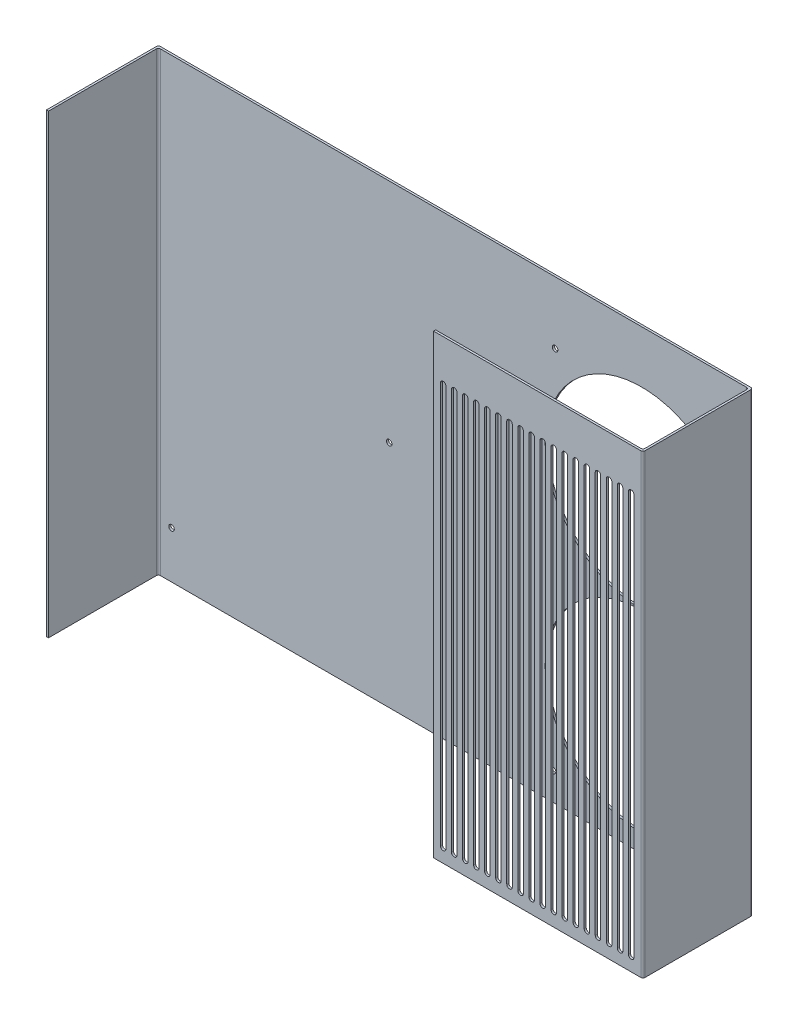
ISO-10303-21;
HEADER;
FILE_DESCRIPTION(('STEP AP214'),'2;1');
FILE_NAME('part.step','',(''),(''),'','','');
FILE_SCHEMA(('AUTOMOTIVE_DESIGN { 1 0 10303 214 1 1 1 1 }'));
ENDSEC;
DATA;
#1=APPLICATION_CONTEXT('core data for automotive mechanical design processes');
#2=APPLICATION_PROTOCOL_DEFINITION('international standard','automotive_design',2000,#1);
#3=PRODUCT_CONTEXT('',#1,'mechanical');
#4=PRODUCT('Part','Part','',(#3));
#5=PRODUCT_RELATED_PRODUCT_CATEGORY('part','',(#4));
#6=PRODUCT_DEFINITION_FORMATION('','',#4);
#7=PRODUCT_DEFINITION_CONTEXT('part definition',#1,'design');
#8=PRODUCT_DEFINITION('design','',#6,#7);
#9=PRODUCT_DEFINITION_SHAPE('','',#8);
#10=(LENGTH_UNIT() NAMED_UNIT(*) SI_UNIT(.MILLI.,.METRE.));
#11=(NAMED_UNIT(*) PLANE_ANGLE_UNIT() SI_UNIT($,.RADIAN.));
#12=(NAMED_UNIT(*) SI_UNIT($,.STERADIAN.) SOLID_ANGLE_UNIT());
#13=UNCERTAINTY_MEASURE_WITH_UNIT(LENGTH_MEASURE(1.E-05),#10,'distance_accuracy_value','');
#14=(GEOMETRIC_REPRESENTATION_CONTEXT(3) GLOBAL_UNCERTAINTY_ASSIGNED_CONTEXT((#13)) GLOBAL_UNIT_ASSIGNED_CONTEXT((#10,
#11,#12)) REPRESENTATION_CONTEXT('',''));
#15=CARTESIAN_POINT('',(0.,0.,0.));
#16=DIRECTION('',(0.,0.,1.));
#17=DIRECTION('',(1.,0.,0.));
#18=AXIS2_PLACEMENT_3D('',#15,#16,#17);
#19=CARTESIAN_POINT('',(175.482797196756,157.848817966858,79.5));
#20=DIRECTION('',(1.,0.,0.));
#21=DIRECTION('',(0.,1.,0.));
#22=AXIS2_PLACEMENT_3D('',#19,#20,#21);
#23=PLANE('',#22);
#24=DIRECTION('',(0.,0.,-1.));
#25=VECTOR('',#24,1.);
#26=CARTESIAN_POINT('',(175.482797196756,-172.151182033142,79.5));
#27=LINE('',#26,#25);
#28=CARTESIAN_POINT('',(175.482797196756,-172.151182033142,76.5));
#29=VERTEX_POINT('',#28);
#30=CARTESIAN_POINT('',(175.482797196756,-172.151182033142,3.));
#31=VERTEX_POINT('',#30);
#32=EDGE_CURVE('E1016',#29,#31,#27,.T.);
#33=ORIENTED_EDGE('',*,*,#32,.F.);
#34=DIRECTION('',(0.,-1.,0.));
#35=VECTOR('',#34,1.);
#36=CARTESIAN_POINT('',(175.482797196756,157.848817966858,76.5));
#37=LINE('',#36,#35);
#38=CARTESIAN_POINT('',(175.482797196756,157.848817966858,76.5));
#39=VERTEX_POINT('',#38);
#40=EDGE_CURVE('E1089',#29,#39,#37,.F.);
#41=ORIENTED_EDGE('',*,*,#40,.T.);
#42=DIRECTION('',(0.,0.,-1.));
#43=VECTOR('',#42,1.);
#44=CARTESIAN_POINT('',(175.482797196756,157.848817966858,79.5));
#45=LINE('',#44,#43);
#46=CARTESIAN_POINT('',(175.482797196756,157.848817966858,3.));
#47=VERTEX_POINT('',#46);
#48=EDGE_CURVE('E1019',#39,#47,#45,.T.);
#49=ORIENTED_EDGE('',*,*,#48,.T.);
#50=DIRECTION('',(0.,-1.,0.));
#51=VECTOR('',#50,1.);
#52=CARTESIAN_POINT('',(175.482797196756,157.848817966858,3.));
#53=LINE('',#52,#51);
#54=EDGE_CURVE('E1086',#47,#31,#53,.T.);
#55=ORIENTED_EDGE('',*,*,#54,.T.);
#56=EDGE_LOOP('',(#33,#41,#49,#55));
#57=FACE_BOUND('',#56,.T.);
#58=ADVANCED_FACE('F33',(#57),#23,.F.);
#59=CARTESIAN_POINT('',(0.,0.,1.5));
#60=DIRECTION('',(0.,0.,1.));
#61=DIRECTION('',(1.,0.,0.));
#62=AXIS2_PLACEMENT_3D('',#59,#60,#61);
#63=PLANE('',#62);
#64=CARTESIAN_POINT('',(97.9827971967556,-89.6469368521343,1.5));
#65=DIRECTION('',(0.,0.,1.));
#66=DIRECTION('',(1.,0.,0.));
#67=AXIS2_PLACEMENT_3D('',#64,#65,#66);
#68=CIRCLE('',#67,69.75);
#69=CARTESIAN_POINT('',(167.732797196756,-89.6469368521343,1.5));
#70=VERTEX_POINT('',#69);
#71=EDGE_CURVE('E978',#70,#70,#68,.T.);
#72=ORIENTED_EDGE('',*,*,#71,.F.);
#73=EDGE_LOOP('',(#72));
#74=FACE_BOUND('',#73,.T.);
#75=CARTESIAN_POINT('',(33.982821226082,-152.146936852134,1.5));
#76=DIRECTION('',(0.,0.,1.));
#77=DIRECTION('',(1.,0.,0.));
#78=AXIS2_PLACEMENT_3D('',#75,#76,#77);
#79=CIRCLE('',#78,2.);
#80=CARTESIAN_POINT('',(35.982821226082,-152.146936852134,1.5));
#81=VERTEX_POINT('',#80);
#82=EDGE_CURVE('E975',#81,#81,#79,.T.);
#83=ORIENTED_EDGE('',*,*,#82,.F.);
#84=EDGE_LOOP('',(#83));
#85=FACE_BOUND('',#84,.T.);
#86=CARTESIAN_POINT('',(97.9827971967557,50.3488179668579,1.5));
#87=DIRECTION('',(0.,0.,1.));
#88=DIRECTION('',(1.,0.,0.));
#89=AXIS2_PLACEMENT_3D('',#86,#87,#88);
#90=CIRCLE('',#89,69.75);
#91=CARTESIAN_POINT('',(167.732797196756,50.3488179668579,1.5));
#92=VERTEX_POINT('',#91);
#93=EDGE_CURVE('E972',#92,#92,#90,.T.);
#94=ORIENTED_EDGE('',*,*,#93,.F.);
#95=EDGE_LOOP('',(#94));
#96=FACE_BOUND('',#95,.T.);
#97=CARTESIAN_POINT('',(160.482797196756,-152.151182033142,1.5));
#98=DIRECTION('',(0.,0.,1.));
#99=DIRECTION('',(1.,0.,0.));
#100=AXIS2_PLACEMENT_3D('',#97,#98,#99);
#101=CIRCLE('',#100,2.);
#102=CARTESIAN_POINT('',(162.482797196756,-152.151182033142,1.5));
#103=VERTEX_POINT('',#102);
#104=EDGE_CURVE('E969',#103,#103,#101,.T.);
#105=ORIENTED_EDGE('',*,*,#104,.F.);
#106=EDGE_LOOP('',(#105));
#107=FACE_BOUND('',#106,.T.);
#108=CARTESIAN_POINT('',(160.482797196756,112.848817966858,1.5));
#109=DIRECTION('',(0.,0.,1.));
#110=DIRECTION('',(1.,0.,0.));
#111=AXIS2_PLACEMENT_3D('',#108,#109,#110);
#112=CIRCLE('',#111,2.);
#113=CARTESIAN_POINT('',(162.482797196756,112.848817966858,1.5));
#114=VERTEX_POINT('',#113);
#115=EDGE_CURVE('E964',#114,#114,#112,.T.);
#116=ORIENTED_EDGE('',*,*,#115,.F.);
#117=EDGE_LOOP('',(#116));
#118=FACE_BOUND('',#117,.T.);
#119=CARTESIAN_POINT('',(35.4827971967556,112.848817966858,1.5));
#120=DIRECTION('',(0.,0.,1.));
#121=DIRECTION('',(1.,0.,0.));
#122=AXIS2_PLACEMENT_3D('',#119,#120,#121);
#123=CIRCLE('',#122,2.);
#124=CARTESIAN_POINT('',(37.4827971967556,112.848817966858,1.5));
#125=VERTEX_POINT('',#124);
#126=EDGE_CURVE('E984',#125,#125,#123,.T.);
#127=ORIENTED_EDGE('',*,*,#126,.F.);
#128=EDGE_LOOP('',(#127));
#129=FACE_BOUND('',#128,.T.);
#130=CARTESIAN_POINT('',(-84.5372028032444,-6.07118203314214,1.5));
#131=DIRECTION('',(0.,0.,1.));
#132=DIRECTION('',(1.,0.,0.));
#133=AXIS2_PLACEMENT_3D('',#130,#131,#132);
#134=CIRCLE('',#133,2.);
#135=CARTESIAN_POINT('',(-82.5372028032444,-6.07118203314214,1.5));
#136=VERTEX_POINT('',#135);
#137=EDGE_CURVE('E987',#136,#136,#134,.T.);
#138=ORIENTED_EDGE('',*,*,#137,.F.);
#139=EDGE_LOOP('',(#138));
#140=FACE_BOUND('',#139,.T.);
#141=CARTESIAN_POINT('',(-242.017202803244,-138.151182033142,1.5));
#142=DIRECTION('',(0.,0.,1.));
#143=DIRECTION('',(1.,0.,0.));
#144=AXIS2_PLACEMENT_3D('',#141,#142,#143);
#145=CIRCLE('',#144,2.);
#146=CARTESIAN_POINT('',(-240.017202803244,-138.151182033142,1.5));
#147=VERTEX_POINT('',#146);
#148=EDGE_CURVE('E991',#147,#147,#145,.T.);
#149=ORIENTED_EDGE('',*,*,#148,.F.);
#150=EDGE_LOOP('',(#149));
#151=FACE_BOUND('',#150,.T.);
#152=DIRECTION('',(1.,0.,0.));
#153=VECTOR('',#152,1.);
#154=CARTESIAN_POINT('',(-253.017202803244,-172.151182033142,1.5));
#155=LINE('',#154,#153);
#156=CARTESIAN_POINT('',(-250.017202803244,-172.151182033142,1.5));
#157=VERTEX_POINT('',#156);
#158=CARTESIAN_POINT('',(173.982797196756,-172.151182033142,1.5));
#159=VERTEX_POINT('',#158);
#160=EDGE_CURVE('E1039',#157,#159,#155,.T.);
#161=ORIENTED_EDGE('',*,*,#160,.T.);
#162=DIRECTION('',(0.,-1.,0.));
#163=VECTOR('',#162,1.);
#164=CARTESIAN_POINT('',(173.982797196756,0.,1.5));
#165=LINE('',#164,#163);
#166=CARTESIAN_POINT('',(173.982797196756,157.848817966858,1.5));
#167=VERTEX_POINT('',#166);
#168=EDGE_CURVE('E1093',#159,#167,#165,.F.);
#169=ORIENTED_EDGE('',*,*,#168,.T.);
#170=DIRECTION('',(-1.,0.,0.));
#171=VECTOR('',#170,1.);
#172=CARTESIAN_POINT('',(-253.017202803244,157.848817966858,1.5));
#173=LINE('',#172,#171);
#174=CARTESIAN_POINT('',(-250.017202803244,157.848817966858,1.5));
#175=VERTEX_POINT('',#174);
#176=EDGE_CURVE('E1042',#167,#175,#173,.T.);
#177=ORIENTED_EDGE('',*,*,#176,.T.);
#178=DIRECTION('',(0.,1.,0.));
#179=VECTOR('',#178,1.);
#180=CARTESIAN_POINT('',(-250.017202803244,0.,1.5));
#181=LINE('',#180,#179);
#182=EDGE_CURVE('E1091',#175,#157,#181,.F.);
#183=ORIENTED_EDGE('',*,*,#182,.T.);
#184=EDGE_LOOP('',(#161,#169,#177,#183));
#185=FACE_BOUND('',#184,.T.);
#186=ADVANCED_FACE('F1359',(#74,#85,#96,#107,#118,#129,#140,#151,#185),#63,.T.);
#187=CARTESIAN_POINT('',(-253.017202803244,157.848817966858,1.5));
#188=DIRECTION('',(1.,0.,0.));
#189=DIRECTION('',(0.,0.,-1.));
#190=AXIS2_PLACEMENT_3D('',#187,#188,#189);
#191=PLANE('',#190);
#192=DIRECTION('',(0.,0.,-1.));
#193=VECTOR('',#192,1.);
#194=CARTESIAN_POINT('',(-253.017202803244,157.848817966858,1.5));
#195=LINE('',#194,#193);
#196=CARTESIAN_POINT('',(-253.017202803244,157.848817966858,81.));
#197=VERTEX_POINT('',#196);
#198=CARTESIAN_POINT('',(-253.017202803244,157.848817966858,1.5));
#199=VERTEX_POINT('',#198);
#200=EDGE_CURVE('E1046',#197,#199,#195,.T.);
#201=ORIENTED_EDGE('',*,*,#200,.T.);
#202=DIRECTION('',(0.,-1.,0.));
#203=VECTOR('',#202,1.);
#204=CARTESIAN_POINT('',(-253.017202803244,157.848817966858,1.5));
#205=LINE('',#204,#203);
#206=CARTESIAN_POINT('',(-253.017202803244,-172.151182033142,1.5));
#207=VERTEX_POINT('',#206);
#208=EDGE_CURVE('E1101',#199,#207,#205,.T.);
#209=ORIENTED_EDGE('',*,*,#208,.T.);
#210=DIRECTION('',(0.,0.,-1.));
#211=VECTOR('',#210,1.);
#212=CARTESIAN_POINT('',(-253.017202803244,-172.151182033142,1.5));
#213=LINE('',#212,#211);
#214=CARTESIAN_POINT('',(-253.017202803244,-172.151182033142,81.));
#215=VERTEX_POINT('',#214);
#216=EDGE_CURVE('E1059',#215,#207,#213,.T.);
#217=ORIENTED_EDGE('',*,*,#216,.F.);
#218=DIRECTION('',(0.,-1.,0.));
#219=VECTOR('',#218,1.);
#220=CARTESIAN_POINT('',(-253.017202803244,-172.151182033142,81.));
#221=LINE('',#220,#219);
#222=EDGE_CURVE('E1022',#197,#215,#221,.T.);
#223=ORIENTED_EDGE('',*,*,#222,.F.);
#224=EDGE_LOOP('',(#201,#209,#217,#223));
#225=FACE_BOUND('',#224,.T.);
#226=ADVANCED_FACE('F1365',(#225),#191,.F.);
#227=CARTESIAN_POINT('',(-253.017202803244,-172.151182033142,1.5));
#228=DIRECTION('',(0.,1.,0.));
#229=DIRECTION('',(0.,0.,1.));
#230=AXIS2_PLACEMENT_3D('',#227,#228,#229);
#231=PLANE('',#230);
#232=DIRECTION('',(1.,0.,0.));
#233=VECTOR('',#232,1.);
#234=CARTESIAN_POINT('',(-253.017202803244,-172.151182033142,0.));
#235=LINE('',#234,#233);
#236=CARTESIAN_POINT('',(-251.517202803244,-172.151182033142,0.));
#237=VERTEX_POINT('',#236);
#238=CARTESIAN_POINT('',(175.482797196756,-172.151182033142,0.));
#239=VERTEX_POINT('',#238);
#240=EDGE_CURVE('E1038',#237,#239,#235,.T.);
#241=ORIENTED_EDGE('',*,*,#240,.T.);
#242=CARTESIAN_POINT('',(175.482797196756,-172.151182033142,1.5));
#243=DIRECTION('',(0.,1.,0.));
#244=DIRECTION('',(0.,0.,1.));
#245=AXIS2_PLACEMENT_3D('',#242,#243,#244);
#246=CIRCLE('',#245,1.5);
#247=CARTESIAN_POINT('',(176.982797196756,-172.151182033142,1.5));
#248=VERTEX_POINT('',#247);
#249=EDGE_CURVE('E1081',#239,#248,#246,.F.);
#250=ORIENTED_EDGE('',*,*,#249,.T.);
#251=DIRECTION('',(0.,0.,-1.));
#252=VECTOR('',#251,1.);
#253=CARTESIAN_POINT('',(176.982797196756,-172.151182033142,1.5));
#254=LINE('',#253,#252);
#255=CARTESIAN_POINT('',(176.982797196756,-172.151182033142,78.));
#256=VERTEX_POINT('',#255);
#257=EDGE_CURVE('E1056',#256,#248,#254,.T.);
#258=ORIENTED_EDGE('',*,*,#257,.F.);
#259=CARTESIAN_POINT('',(175.482797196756,-172.151182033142,78.));
#260=DIRECTION('',(0.,1.,0.));
#261=DIRECTION('',(0.,0.,1.));
#262=AXIS2_PLACEMENT_3D('',#259,#260,#261);
#263=CIRCLE('',#262,1.5);
#264=CARTESIAN_POINT('',(175.482797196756,-172.151182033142,79.5));
#265=VERTEX_POINT('',#264);
#266=EDGE_CURVE('E1079',#256,#265,#263,.F.);
#267=ORIENTED_EDGE('',*,*,#266,.T.);
#268=DIRECTION('',(1.,0.,0.));
#269=VECTOR('',#268,1.);
#270=CARTESIAN_POINT('',(176.982797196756,-172.151182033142,79.5));
#271=LINE('',#270,#269);
#272=CARTESIAN_POINT('',(25.4827971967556,-172.151182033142,79.5));
#273=VERTEX_POINT('',#272);
#274=EDGE_CURVE('E1013',#273,#265,#271,.T.);
#275=ORIENTED_EDGE('',*,*,#274,.F.);
#276=DIRECTION('',(0.,0.,1.));
#277=VECTOR('',#276,1.);
#278=CARTESIAN_POINT('',(25.4827971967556,-172.151182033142,79.5));
#279=LINE('',#278,#277);
#280=CARTESIAN_POINT('',(25.4827971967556,-172.151182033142,78.));
#281=VERTEX_POINT('',#280);
#282=EDGE_CURVE('E1002',#281,#273,#279,.T.);
#283=ORIENTED_EDGE('',*,*,#282,.F.);
#284=DIRECTION('',(1.,0.,0.));
#285=VECTOR('',#284,1.);
#286=CARTESIAN_POINT('',(25.4827971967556,-172.151182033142,78.));
#287=LINE('',#286,#285);
#288=CARTESIAN_POINT('',(173.982797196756,-172.151182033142,78.));
#289=VERTEX_POINT('',#288);
#290=EDGE_CURVE('E1005',#281,#289,#287,.T.);
#291=ORIENTED_EDGE('',*,*,#290,.T.);
#292=CARTESIAN_POINT('',(173.982797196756,-172.151182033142,76.5));
#293=DIRECTION('',(0.,1.,0.));
#294=DIRECTION('',(0.,0.,1.));
#295=AXIS2_PLACEMENT_3D('',#292,#293,#294);
#296=CIRCLE('',#295,1.5);
#297=EDGE_CURVE('E1104',#289,#29,#296,.T.);
#298=ORIENTED_EDGE('',*,*,#297,.T.);
#299=ORIENTED_EDGE('',*,*,#32,.T.);
#300=CARTESIAN_POINT('',(173.982797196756,-172.151182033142,3.));
#301=DIRECTION('',(0.,1.,0.));
#302=DIRECTION('',(0.,0.,1.));
#303=AXIS2_PLACEMENT_3D('',#300,#301,#302);
#304=CIRCLE('',#303,1.5);
#305=EDGE_CURVE('E1108',#31,#159,#304,.T.);
#306=ORIENTED_EDGE('',*,*,#305,.T.);
#307=ORIENTED_EDGE('',*,*,#160,.F.);
#308=CARTESIAN_POINT('',(-250.017202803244,-172.151182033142,3.));
#309=DIRECTION('',(0.,1.,0.));
#310=DIRECTION('',(0.,0.,1.));
#311=AXIS2_PLACEMENT_3D('',#308,#309,#310);
#312=CIRCLE('',#311,1.5);
#313=CARTESIAN_POINT('',(-251.517202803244,-172.151182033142,3.00000000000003));
#314=VERTEX_POINT('',#313);
#315=EDGE_CURVE('E1114',#157,#314,#312,.T.);
#316=ORIENTED_EDGE('',*,*,#315,.T.);
#317=DIRECTION('',(0.,0.,-1.));
#318=VECTOR('',#317,1.);
#319=CARTESIAN_POINT('',(-251.517202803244,-172.151182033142,81.));
#320=LINE('',#319,#318);
#321=CARTESIAN_POINT('',(-251.517202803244,-172.151182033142,81.));
#322=VERTEX_POINT('',#321);
#323=EDGE_CURVE('E1035',#322,#314,#320,.T.);
#324=ORIENTED_EDGE('',*,*,#323,.F.);
#325=DIRECTION('',(1.,0.,0.));
#326=VECTOR('',#325,1.);
#327=CARTESIAN_POINT('',(-253.017202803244,-172.151182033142,81.));
#328=LINE('',#327,#326);
#329=EDGE_CURVE('E1025',#215,#322,#328,.T.);
#330=ORIENTED_EDGE('',*,*,#329,.F.);
#331=ORIENTED_EDGE('',*,*,#216,.T.);
#332=CARTESIAN_POINT('',(-251.517202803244,-172.151182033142,1.5));
#333=DIRECTION('',(0.,1.,0.));
#334=DIRECTION('',(0.,0.,1.));
#335=AXIS2_PLACEMENT_3D('',#332,#333,#334);
#336=CIRCLE('',#335,1.5);
#337=EDGE_CURVE('E1077',#207,#237,#336,.F.);
#338=ORIENTED_EDGE('',*,*,#337,.T.);
#339=EDGE_LOOP('',(#241,#250,#258,#267,#275,#283,#291,#298,#299,#306,#307,#316,#324,#330,#331,#338));
#340=FACE_BOUND('',#339,.T.);
#341=ADVANCED_FACE('F1391',(#340),#231,.F.);
#342=CARTESIAN_POINT('',(176.982797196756,157.848817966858,1.5));
#343=DIRECTION('',(-1.,0.,0.));
#344=DIRECTION('',(0.,-1.,0.));
#345=AXIS2_PLACEMENT_3D('',#342,#343,#344);
#346=PLANE('',#345);
#347=ORIENTED_EDGE('',*,*,#257,.T.);
#348=DIRECTION('',(0.,1.,0.));
#349=VECTOR('',#348,1.);
#350=CARTESIAN_POINT('',(176.982797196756,157.848817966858,1.5));
#351=LINE('',#350,#349);
#352=CARTESIAN_POINT('',(176.982797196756,157.848817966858,1.5));
#353=VERTEX_POINT('',#352);
#354=EDGE_CURVE('E1064',#248,#353,#351,.T.);
#355=ORIENTED_EDGE('',*,*,#354,.T.);
#356=DIRECTION('',(0.,0.,-1.));
#357=VECTOR('',#356,1.);
#358=CARTESIAN_POINT('',(176.982797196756,157.848817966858,1.5));
#359=LINE('',#358,#357);
#360=CARTESIAN_POINT('',(176.982797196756,157.848817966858,78.));
#361=VERTEX_POINT('',#360);
#362=EDGE_CURVE('E1053',#361,#353,#359,.T.);
#363=ORIENTED_EDGE('',*,*,#362,.F.);
#364=DIRECTION('',(0.,1.,0.));
#365=VECTOR('',#364,1.);
#366=CARTESIAN_POINT('',(176.982797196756,157.848817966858,78.));
#367=LINE('',#366,#365);
#368=EDGE_CURVE('E1062',#361,#256,#367,.F.);
#369=ORIENTED_EDGE('',*,*,#368,.T.);
#370=EDGE_LOOP('',(#347,#355,#363,#369));
#371=FACE_BOUND('',#370,.T.);
#372=ADVANCED_FACE('F1387',(#371),#346,.F.);
#373=CARTESIAN_POINT('',(-253.017202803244,157.848817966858,1.5));
#374=DIRECTION('',(0.,-1.,0.));
#375=DIRECTION('',(0.,0.,-1.));
#376=AXIS2_PLACEMENT_3D('',#373,#374,#375);
#377=PLANE('',#376);
#378=ORIENTED_EDGE('',*,*,#362,.T.);
#379=CARTESIAN_POINT('',(175.482797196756,157.848817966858,1.5));
#380=DIRECTION('',(0.,-1.,0.));
#381=DIRECTION('',(0.,0.,-1.));
#382=AXIS2_PLACEMENT_3D('',#379,#380,#381);
#383=CIRCLE('',#382,1.5);
#384=CARTESIAN_POINT('',(175.482797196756,157.848817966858,0.));
#385=VERTEX_POINT('',#384);
#386=EDGE_CURVE('E1071',#353,#385,#383,.F.);
#387=ORIENTED_EDGE('',*,*,#386,.T.);
#388=DIRECTION('',(-1.,0.,0.));
#389=VECTOR('',#388,1.);
#390=CARTESIAN_POINT('',(-253.017202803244,157.848817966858,0.));
#391=LINE('',#390,#389);
#392=CARTESIAN_POINT('',(-251.517202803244,157.848817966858,0.));
#393=VERTEX_POINT('',#392);
#394=EDGE_CURVE('E1043',#385,#393,#391,.T.);
#395=ORIENTED_EDGE('',*,*,#394,.T.);
#396=CARTESIAN_POINT('',(-251.517202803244,157.848817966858,1.5));
#397=DIRECTION('',(0.,-1.,0.));
#398=DIRECTION('',(0.,0.,-1.));
#399=AXIS2_PLACEMENT_3D('',#396,#397,#398);
#400=CIRCLE('',#399,1.5);
#401=EDGE_CURVE('E1067',#393,#199,#400,.F.);
#402=ORIENTED_EDGE('',*,*,#401,.T.);
#403=ORIENTED_EDGE('',*,*,#200,.F.);
#404=DIRECTION('',(-1.,0.,0.));
#405=VECTOR('',#404,1.);
#406=CARTESIAN_POINT('',(-253.017202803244,157.848817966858,81.));
#407=LINE('',#406,#405);
#408=CARTESIAN_POINT('',(-251.517202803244,157.848817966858,81.));
#409=VERTEX_POINT('',#408);
#410=EDGE_CURVE('E1029',#409,#197,#407,.T.);
#411=ORIENTED_EDGE('',*,*,#410,.F.);
#412=DIRECTION('',(0.,0.,-1.));
#413=VECTOR('',#412,1.);
#414=CARTESIAN_POINT('',(-251.517202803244,157.848817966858,81.));
#415=LINE('',#414,#413);
#416=CARTESIAN_POINT('',(-251.517202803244,157.848817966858,3.00000000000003));
#417=VERTEX_POINT('',#416);
#418=EDGE_CURVE('E1032',#409,#417,#415,.T.);
#419=ORIENTED_EDGE('',*,*,#418,.T.);
#420=CARTESIAN_POINT('',(-250.017202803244,157.848817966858,3.));
#421=DIRECTION('',(0.,-1.,0.));
#422=DIRECTION('',(0.,0.,-1.));
#423=AXIS2_PLACEMENT_3D('',#420,#421,#422);
#424=CIRCLE('',#423,1.5);
#425=EDGE_CURVE('E1112',#417,#175,#424,.T.);
#426=ORIENTED_EDGE('',*,*,#425,.T.);
#427=ORIENTED_EDGE('',*,*,#176,.F.);
#428=CARTESIAN_POINT('',(173.982797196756,157.848817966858,3.));
#429=DIRECTION('',(0.,-1.,0.));
#430=DIRECTION('',(0.,0.,-1.));
#431=AXIS2_PLACEMENT_3D('',#428,#429,#430);
#432=CIRCLE('',#431,1.5);
#433=EDGE_CURVE('E1110',#167,#47,#432,.T.);
#434=ORIENTED_EDGE('',*,*,#433,.T.);
#435=ORIENTED_EDGE('',*,*,#48,.F.);
#436=CARTESIAN_POINT('',(173.982797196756,157.848817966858,76.5));
#437=DIRECTION('',(0.,-1.,0.));
#438=DIRECTION('',(0.,0.,-1.));
#439=AXIS2_PLACEMENT_3D('',#436,#437,#438);
#440=CIRCLE('',#439,1.5);
#441=CARTESIAN_POINT('',(173.982797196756,157.848817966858,78.));
#442=VERTEX_POINT('',#441);
#443=EDGE_CURVE('E1106',#39,#442,#440,.T.);
#444=ORIENTED_EDGE('',*,*,#443,.T.);
#445=DIRECTION('',(1.,0.,0.));
#446=VECTOR('',#445,1.);
#447=CARTESIAN_POINT('',(25.4827971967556,157.848817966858,78.));
#448=LINE('',#447,#446);
#449=CARTESIAN_POINT('',(25.4827971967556,157.848817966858,78.));
#450=VERTEX_POINT('',#449);
#451=EDGE_CURVE('E1008',#450,#442,#448,.T.);
#452=ORIENTED_EDGE('',*,*,#451,.F.);
#453=DIRECTION('',(0.,0.,-1.));
#454=VECTOR('',#453,1.);
#455=CARTESIAN_POINT('',(25.4827971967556,157.848817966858,79.5));
#456=LINE('',#455,#454);
#457=CARTESIAN_POINT('',(25.4827971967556,157.848817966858,79.5));
#458=VERTEX_POINT('',#457);
#459=EDGE_CURVE('E998',#458,#450,#456,.T.);
#460=ORIENTED_EDGE('',*,*,#459,.F.);
#461=DIRECTION('',(-1.,0.,0.));
#462=VECTOR('',#461,1.);
#463=CARTESIAN_POINT('',(176.982797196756,157.848817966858,79.5));
#464=LINE('',#463,#462);
#465=CARTESIAN_POINT('',(175.482797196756,157.848817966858,79.5));
#466=VERTEX_POINT('',#465);
#467=EDGE_CURVE('E1011',#466,#458,#464,.T.);
#468=ORIENTED_EDGE('',*,*,#467,.F.);
#469=CARTESIAN_POINT('',(175.482797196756,157.848817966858,78.));
#470=DIRECTION('',(0.,-1.,0.));
#471=DIRECTION('',(0.,0.,-1.));
#472=AXIS2_PLACEMENT_3D('',#469,#470,#471);
#473=CIRCLE('',#472,1.5);
#474=EDGE_CURVE('E1069',#466,#361,#473,.F.);
#475=ORIENTED_EDGE('',*,*,#474,.T.);
#476=EDGE_LOOP('',(#378,#387,#395,#402,#403,#411,#419,#426,#427,#434,#435,#444,#452,#460,#468,#475));
#477=FACE_BOUND('',#476,.T.);
#478=ADVANCED_FACE('F1383',(#477),#377,.F.);
#479=CARTESIAN_POINT('',(0.,0.,0.));
#480=DIRECTION('',(0.,0.,1.));
#481=DIRECTION('',(1.,0.,0.));
#482=AXIS2_PLACEMENT_3D('',#479,#480,#481);
#483=PLANE('',#482);
#484=CARTESIAN_POINT('',(97.9827971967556,-89.6469368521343,0.));
#485=DIRECTION('',(0.,0.,-1.));
#486=DIRECTION('',(-1.,0.,0.));
#487=AXIS2_PLACEMENT_3D('',#484,#485,#486);
#488=CIRCLE('',#487,69.75);
#489=CARTESIAN_POINT('',(28.2327971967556,-89.6469368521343,0.));
#490=VERTEX_POINT('',#489);
#491=EDGE_CURVE('E955',#490,#490,#488,.T.);
#492=ORIENTED_EDGE('',*,*,#491,.F.);
#493=EDGE_LOOP('',(#492));
#494=FACE_BOUND('',#493,.T.);
#495=CARTESIAN_POINT('',(33.982821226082,-152.146936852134,0.));
#496=DIRECTION('',(0.,0.,-1.));
#497=DIRECTION('',(-1.,0.,0.));
#498=AXIS2_PLACEMENT_3D('',#495,#496,#497);
#499=CIRCLE('',#498,2.);
#500=CARTESIAN_POINT('',(31.982821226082,-152.146936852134,0.));
#501=VERTEX_POINT('',#500);
#502=EDGE_CURVE('E952',#501,#501,#499,.T.);
#503=ORIENTED_EDGE('',*,*,#502,.F.);
#504=EDGE_LOOP('',(#503));
#505=FACE_BOUND('',#504,.T.);
#506=CARTESIAN_POINT('',(97.9827971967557,50.3488179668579,0.));
#507=DIRECTION('',(0.,0.,-1.));
#508=DIRECTION('',(-1.,0.,0.));
#509=AXIS2_PLACEMENT_3D('',#506,#507,#508);
#510=CIRCLE('',#509,69.75);
#511=CARTESIAN_POINT('',(28.2327971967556,50.3488179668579,0.));
#512=VERTEX_POINT('',#511);
#513=EDGE_CURVE('E945',#512,#512,#510,.T.);
#514=ORIENTED_EDGE('',*,*,#513,.F.);
#515=EDGE_LOOP('',(#514));
#516=FACE_BOUND('',#515,.T.);
#517=CARTESIAN_POINT('',(160.482797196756,-152.151182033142,0.));
#518=DIRECTION('',(0.,0.,-1.));
#519=DIRECTION('',(-1.,0.,0.));
#520=AXIS2_PLACEMENT_3D('',#517,#518,#519);
#521=CIRCLE('',#520,2.);
#522=CARTESIAN_POINT('',(158.482797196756,-152.151182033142,0.));
#523=VERTEX_POINT('',#522);
#524=EDGE_CURVE('E960',#523,#523,#521,.T.);
#525=ORIENTED_EDGE('',*,*,#524,.F.);
#526=EDGE_LOOP('',(#525));
#527=FACE_BOUND('',#526,.T.);
#528=CARTESIAN_POINT('',(160.482797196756,112.848817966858,0.));
#529=DIRECTION('',(0.,0.,-1.));
#530=DIRECTION('',(-1.,0.,0.));
#531=AXIS2_PLACEMENT_3D('',#528,#529,#530);
#532=CIRCLE('',#531,2.);
#533=CARTESIAN_POINT('',(158.482797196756,112.848817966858,0.));
#534=VERTEX_POINT('',#533);
#535=EDGE_CURVE('E961',#534,#534,#532,.T.);
#536=ORIENTED_EDGE('',*,*,#535,.F.);
#537=EDGE_LOOP('',(#536));
#538=FACE_BOUND('',#537,.T.);
#539=CARTESIAN_POINT('',(35.4827971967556,112.848817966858,0.));
#540=DIRECTION('',(0.,0.,-1.));
#541=DIRECTION('',(-1.,0.,0.));
#542=AXIS2_PLACEMENT_3D('',#539,#540,#541);
#543=CIRCLE('',#542,2.);
#544=CARTESIAN_POINT('',(33.4827971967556,112.848817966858,0.));
#545=VERTEX_POINT('',#544);
#546=EDGE_CURVE('E981',#545,#545,#543,.T.);
#547=ORIENTED_EDGE('',*,*,#546,.F.);
#548=EDGE_LOOP('',(#547));
#549=FACE_BOUND('',#548,.T.);
#550=CARTESIAN_POINT('',(-84.5372028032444,-6.07118203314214,0.));
#551=DIRECTION('',(0.,0.,1.));
#552=DIRECTION('',(1.,0.,0.));
#553=AXIS2_PLACEMENT_3D('',#550,#551,#552);
#554=CIRCLE('',#553,2.);
#555=CARTESIAN_POINT('',(-82.5372028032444,-6.07118203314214,0.));
#556=VERTEX_POINT('',#555);
#557=EDGE_CURVE('E990',#556,#556,#554,.T.);
#558=ORIENTED_EDGE('',*,*,#557,.T.);
#559=EDGE_LOOP('',(#558));
#560=FACE_BOUND('',#559,.T.);
#561=CARTESIAN_POINT('',(-242.017202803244,-138.151182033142,0.));
#562=DIRECTION('',(0.,0.,1.));
#563=DIRECTION('',(1.,0.,0.));
#564=AXIS2_PLACEMENT_3D('',#561,#562,#563);
#565=CIRCLE('',#564,2.);
#566=CARTESIAN_POINT('',(-240.017202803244,-138.151182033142,0.));
#567=VERTEX_POINT('',#566);
#568=EDGE_CURVE('E994',#567,#567,#565,.T.);
#569=ORIENTED_EDGE('',*,*,#568,.T.);
#570=EDGE_LOOP('',(#569));
#571=FACE_BOUND('',#570,.T.);
#572=ORIENTED_EDGE('',*,*,#394,.F.);
#573=DIRECTION('',(0.,1.,0.));
#574=VECTOR('',#573,1.);
#575=CARTESIAN_POINT('',(175.482797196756,0.,0.));
#576=LINE('',#575,#574);
#577=EDGE_CURVE('E1075',#385,#239,#576,.F.);
#578=ORIENTED_EDGE('',*,*,#577,.T.);
#579=ORIENTED_EDGE('',*,*,#240,.F.);
#580=DIRECTION('',(0.,-1.,0.));
#581=VECTOR('',#580,1.);
#582=CARTESIAN_POINT('',(-251.517202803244,0.,0.));
#583=LINE('',#582,#581);
#584=EDGE_CURVE('E1073',#237,#393,#583,.F.);
#585=ORIENTED_EDGE('',*,*,#584,.T.);
#586=EDGE_LOOP('',(#572,#578,#579,#585));
#587=FACE_BOUND('',#586,.T.);
#588=ADVANCED_FACE('F1378',(#494,#505,#516,#527,#538,#549,#560,#571,#587),#483,.F.);
#589=CARTESIAN_POINT('',(-251.517202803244,-172.151182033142,81.));
#590=DIRECTION('',(-1.,0.,0.));
#591=DIRECTION('',(0.,0.,1.));
#592=AXIS2_PLACEMENT_3D('',#589,#590,#591);
#593=PLANE('',#592);
#594=ORIENTED_EDGE('',*,*,#323,.T.);
#595=DIRECTION('',(0.,1.,0.));
#596=VECTOR('',#595,1.);
#597=CARTESIAN_POINT('',(-251.517202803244,-172.151182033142,3.));
#598=LINE('',#597,#596);
#599=EDGE_CURVE('E1098',#314,#417,#598,.T.);
#600=ORIENTED_EDGE('',*,*,#599,.T.);
#601=ORIENTED_EDGE('',*,*,#418,.F.);
#602=DIRECTION('',(0.,1.,0.));
#603=VECTOR('',#602,1.);
#604=CARTESIAN_POINT('',(-251.517202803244,-172.151182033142,81.));
#605=LINE('',#604,#603);
#606=EDGE_CURVE('E1027',#322,#409,#605,.T.);
#607=ORIENTED_EDGE('',*,*,#606,.F.);
#608=EDGE_LOOP('',(#594,#600,#601,#607));
#609=FACE_BOUND('',#608,.T.);
#610=ADVANCED_FACE('F1375',(#609),#593,.F.);
#611=CARTESIAN_POINT('',(0.,0.,81.));
#612=DIRECTION('',(0.,0.,-1.));
#613=DIRECTION('',(-1.,0.,0.));
#614=AXIS2_PLACEMENT_3D('',#611,#612,#613);
#615=PLANE('',#614);
#616=ORIENTED_EDGE('',*,*,#222,.T.);
#617=ORIENTED_EDGE('',*,*,#329,.T.);
#618=ORIENTED_EDGE('',*,*,#606,.T.);
#619=ORIENTED_EDGE('',*,*,#410,.T.);
#620=EDGE_LOOP('',(#616,#617,#618,#619));
#621=FACE_BOUND('',#620,.T.);
#622=ADVANCED_FACE('F1372',(#621),#615,.F.);
#623=CARTESIAN_POINT('',(0.,0.,79.5));
#624=DIRECTION('',(0.,0.,-1.));
#625=DIRECTION('',(-1.,0.,0.));
#626=AXIS2_PLACEMENT_3D('',#623,#624,#625);
#627=PLANE('',#626);
#628=DIRECTION('',(0.,1.,0.));
#629=VECTOR('',#628,1.);
#630=CARTESIAN_POINT('',(34.4827971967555,-162.151182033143,79.5));
#631=LINE('',#630,#629);
#632=CARTESIAN_POINT('',(34.4827971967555,-162.151182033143,79.5));
#633=VERTEX_POINT('',#632);
#634=CARTESIAN_POINT('',(34.4827971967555,127.848817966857,79.5));
#635=VERTEX_POINT('',#634);
#636=EDGE_CURVE('E756',#633,#635,#631,.T.);
#637=ORIENTED_EDGE('',*,*,#636,.F.);
#638=CARTESIAN_POINT('',(32.4827971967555,-162.151182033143,79.5));
#639=DIRECTION('',(0.,0.,1.));
#640=DIRECTION('',(-1.,0.,0.));
#641=AXIS2_PLACEMENT_3D('',#638,#639,#640);
#642=CIRCLE('',#641,2.00000000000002);
#643=CARTESIAN_POINT('',(30.4827971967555,-162.151182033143,79.5));
#644=VERTEX_POINT('',#643);
#645=EDGE_CURVE('E48',#644,#633,#642,.T.);
#646=ORIENTED_EDGE('',*,*,#645,.F.);
#647=DIRECTION('',(0.,-1.,0.));
#648=VECTOR('',#647,1.);
#649=CARTESIAN_POINT('',(30.4827971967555,-162.151182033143,79.5));
#650=LINE('',#649,#648);
#651=CARTESIAN_POINT('',(30.4827971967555,127.848817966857,79.5));
#652=VERTEX_POINT('',#651);
#653=EDGE_CURVE('E762',#652,#644,#650,.T.);
#654=ORIENTED_EDGE('',*,*,#653,.F.);
#655=CARTESIAN_POINT('',(32.4827971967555,127.848817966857,79.5));
#656=DIRECTION('',(0.,0.,1.));
#657=DIRECTION('',(1.,0.,0.));
#658=AXIS2_PLACEMENT_3D('',#655,#656,#657);
#659=CIRCLE('',#658,1.99999999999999);
#660=EDGE_CURVE('E759',#635,#652,#659,.T.);
#661=ORIENTED_EDGE('',*,*,#660,.F.);
#662=EDGE_LOOP('',(#637,#646,#654,#661));
#663=FACE_BOUND('',#662,.T.);
#664=DIRECTION('',(0.,1.,0.));
#665=VECTOR('',#664,1.);
#666=CARTESIAN_POINT('',(42.4827971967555,-162.151182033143,79.5));
#667=LINE('',#666,#665);
#668=CARTESIAN_POINT('',(42.4827971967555,-162.151182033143,79.5));
#669=VERTEX_POINT('',#668);
#670=CARTESIAN_POINT('',(42.4827971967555,127.848817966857,79.5));
#671=VERTEX_POINT('',#670);
#672=EDGE_CURVE('E738',#669,#671,#667,.T.);
#673=ORIENTED_EDGE('',*,*,#672,.F.);
#674=CARTESIAN_POINT('',(40.4827971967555,-162.151182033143,79.5));
#675=DIRECTION('',(0.,0.,1.));
#676=DIRECTION('',(-1.,0.,0.));
#677=AXIS2_PLACEMENT_3D('',#674,#675,#676);
#678=CIRCLE('',#677,2.00000000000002);
#679=CARTESIAN_POINT('',(38.4827971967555,-162.151182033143,79.5));
#680=VERTEX_POINT('',#679);
#681=EDGE_CURVE('E56',#680,#669,#678,.T.);
#682=ORIENTED_EDGE('',*,*,#681,.F.);
#683=DIRECTION('',(0.,-1.,0.));
#684=VECTOR('',#683,1.);
#685=CARTESIAN_POINT('',(38.4827971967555,-162.151182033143,79.5));
#686=LINE('',#685,#684);
#687=CARTESIAN_POINT('',(38.4827971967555,127.848817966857,79.5));
#688=VERTEX_POINT('',#687);
#689=EDGE_CURVE('E745',#688,#680,#686,.T.);
#690=ORIENTED_EDGE('',*,*,#689,.F.);
#691=CARTESIAN_POINT('',(40.4827971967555,127.848817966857,79.5));
#692=DIRECTION('',(0.,0.,1.));
#693=DIRECTION('',(1.,0.,0.));
#694=AXIS2_PLACEMENT_3D('',#691,#692,#693);
#695=CIRCLE('',#694,1.99999999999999);
#696=EDGE_CURVE('E742',#671,#688,#695,.T.);
#697=ORIENTED_EDGE('',*,*,#696,.F.);
#698=EDGE_LOOP('',(#673,#682,#690,#697));
#699=FACE_BOUND('',#698,.T.);
#700=DIRECTION('',(0.,1.,0.));
#701=VECTOR('',#700,1.);
#702=CARTESIAN_POINT('',(50.4827971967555,-162.151182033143,79.5));
#703=LINE('',#702,#701);
#704=CARTESIAN_POINT('',(50.4827971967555,-162.151182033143,79.5));
#705=VERTEX_POINT('',#704);
#706=CARTESIAN_POINT('',(50.4827971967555,127.848817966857,79.5));
#707=VERTEX_POINT('',#706);
#708=EDGE_CURVE('E719',#705,#707,#703,.T.);
#709=ORIENTED_EDGE('',*,*,#708,.F.);
#710=CARTESIAN_POINT('',(48.4827971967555,-162.151182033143,79.5));
#711=DIRECTION('',(0.,0.,1.));
#712=DIRECTION('',(-1.,0.,0.));
#713=AXIS2_PLACEMENT_3D('',#710,#711,#712);
#714=CIRCLE('',#713,2.00000000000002);
#715=CARTESIAN_POINT('',(46.4827971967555,-162.151182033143,79.5));
#716=VERTEX_POINT('',#715);
#717=EDGE_CURVE('E717',#716,#705,#714,.T.);
#718=ORIENTED_EDGE('',*,*,#717,.F.);
#719=DIRECTION('',(0.,-1.,0.));
#720=VECTOR('',#719,1.);
#721=CARTESIAN_POINT('',(46.4827971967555,-162.151182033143,79.5));
#722=LINE('',#721,#720);
#723=CARTESIAN_POINT('',(46.4827971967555,127.848817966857,79.5));
#724=VERTEX_POINT('',#723);
#725=EDGE_CURVE('E726',#724,#716,#722,.T.);
#726=ORIENTED_EDGE('',*,*,#725,.F.);
#727=CARTESIAN_POINT('',(48.4827971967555,127.848817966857,79.5));
#728=DIRECTION('',(0.,0.,1.));
#729=DIRECTION('',(1.,0.,0.));
#730=AXIS2_PLACEMENT_3D('',#727,#728,#729);
#731=CIRCLE('',#730,1.99999999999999);
#732=EDGE_CURVE('E723',#707,#724,#731,.T.);
#733=ORIENTED_EDGE('',*,*,#732,.F.);
#734=EDGE_LOOP('',(#709,#718,#726,#733));
#735=FACE_BOUND('',#734,.T.);
#736=DIRECTION('',(0.,1.,0.));
#737=VECTOR('',#736,1.);
#738=CARTESIAN_POINT('',(66.4827971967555,-162.151182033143,79.5));
#739=LINE('',#738,#737);
#740=CARTESIAN_POINT('',(66.4827971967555,-162.151182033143,79.5));
#741=VERTEX_POINT('',#740);
#742=CARTESIAN_POINT('',(66.4827971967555,127.848817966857,79.5));
#743=VERTEX_POINT('',#742);
#744=EDGE_CURVE('E699',#741,#743,#739,.T.);
#745=ORIENTED_EDGE('',*,*,#744,.F.);
#746=CARTESIAN_POINT('',(64.4827971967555,-162.151182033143,79.5));
#747=DIRECTION('',(0.,0.,1.));
#748=DIRECTION('',(-1.,0.,0.));
#749=AXIS2_PLACEMENT_3D('',#746,#747,#748);
#750=CIRCLE('',#749,2.00000000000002);
#751=CARTESIAN_POINT('',(62.4827971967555,-162.151182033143,79.5));
#752=VERTEX_POINT('',#751);
#753=EDGE_CURVE('E697',#752,#741,#750,.T.);
#754=ORIENTED_EDGE('',*,*,#753,.F.);
#755=DIRECTION('',(0.,-1.,0.));
#756=VECTOR('',#755,1.);
#757=CARTESIAN_POINT('',(62.4827971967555,-162.151182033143,79.5));
#758=LINE('',#757,#756);
#759=CARTESIAN_POINT('',(62.4827971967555,127.848817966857,79.5));
#760=VERTEX_POINT('',#759);
#761=EDGE_CURVE('E706',#760,#752,#758,.T.);
#762=ORIENTED_EDGE('',*,*,#761,.F.);
#763=CARTESIAN_POINT('',(64.4827971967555,127.848817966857,79.5));
#764=DIRECTION('',(0.,0.,1.));
#765=DIRECTION('',(1.,0.,0.));
#766=AXIS2_PLACEMENT_3D('',#763,#764,#765);
#767=CIRCLE('',#766,1.99999999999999);
#768=EDGE_CURVE('E703',#743,#760,#767,.T.);
#769=ORIENTED_EDGE('',*,*,#768,.F.);
#770=EDGE_LOOP('',(#745,#754,#762,#769));
#771=FACE_BOUND('',#770,.T.);
#772=DIRECTION('',(0.,1.,0.));
#773=VECTOR('',#772,1.);
#774=CARTESIAN_POINT('',(74.4827971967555,-162.151182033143,79.5));
#775=LINE('',#774,#773);
#776=CARTESIAN_POINT('',(74.4827971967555,-162.151182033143,79.5));
#777=VERTEX_POINT('',#776);
#778=CARTESIAN_POINT('',(74.4827971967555,127.848817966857,79.5));
#779=VERTEX_POINT('',#778);
#780=EDGE_CURVE('E679',#777,#779,#775,.T.);
#781=ORIENTED_EDGE('',*,*,#780,.F.);
#782=CARTESIAN_POINT('',(72.4827971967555,-162.151182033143,79.5));
#783=DIRECTION('',(0.,0.,1.));
#784=DIRECTION('',(-1.,0.,0.));
#785=AXIS2_PLACEMENT_3D('',#782,#783,#784);
#786=CIRCLE('',#785,2.00000000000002);
#787=CARTESIAN_POINT('',(70.4827971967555,-162.151182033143,79.5));
#788=VERTEX_POINT('',#787);
#789=EDGE_CURVE('E677',#788,#777,#786,.T.);
#790=ORIENTED_EDGE('',*,*,#789,.F.);
#791=DIRECTION('',(0.,-1.,0.));
#792=VECTOR('',#791,1.);
#793=CARTESIAN_POINT('',(70.4827971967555,-162.151182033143,79.5));
#794=LINE('',#793,#792);
#795=CARTESIAN_POINT('',(70.4827971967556,127.848817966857,79.5));
#796=VERTEX_POINT('',#795);
#797=EDGE_CURVE('E686',#796,#788,#794,.T.);
#798=ORIENTED_EDGE('',*,*,#797,.F.);
#799=CARTESIAN_POINT('',(72.4827971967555,127.848817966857,79.5));
#800=DIRECTION('',(0.,0.,1.));
#801=DIRECTION('',(1.,0.,0.));
#802=AXIS2_PLACEMENT_3D('',#799,#800,#801);
#803=CIRCLE('',#802,1.99999999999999);
#804=EDGE_CURVE('E683',#779,#796,#803,.T.);
#805=ORIENTED_EDGE('',*,*,#804,.F.);
#806=EDGE_LOOP('',(#781,#790,#798,#805));
#807=FACE_BOUND('',#806,.T.);
#808=DIRECTION('',(0.,1.,0.));
#809=VECTOR('',#808,1.);
#810=CARTESIAN_POINT('',(82.4827971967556,-162.151182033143,79.5));
#811=LINE('',#810,#809);
#812=CARTESIAN_POINT('',(82.4827971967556,-162.151182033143,79.5));
#813=VERTEX_POINT('',#812);
#814=CARTESIAN_POINT('',(82.4827971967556,127.848817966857,79.5));
#815=VERTEX_POINT('',#814);
#816=EDGE_CURVE('E659',#813,#815,#811,.T.);
#817=ORIENTED_EDGE('',*,*,#816,.F.);
#818=CARTESIAN_POINT('',(80.4827971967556,-162.151182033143,79.5));
#819=DIRECTION('',(0.,0.,1.));
#820=DIRECTION('',(-1.,0.,0.));
#821=AXIS2_PLACEMENT_3D('',#818,#819,#820);
#822=CIRCLE('',#821,2.00000000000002);
#823=CARTESIAN_POINT('',(78.4827971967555,-162.151182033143,79.5));
#824=VERTEX_POINT('',#823);
#825=EDGE_CURVE('E657',#824,#813,#822,.T.);
#826=ORIENTED_EDGE('',*,*,#825,.F.);
#827=DIRECTION('',(0.,-1.,0.));
#828=VECTOR('',#827,1.);
#829=CARTESIAN_POINT('',(78.4827971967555,-162.151182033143,79.5));
#830=LINE('',#829,#828);
#831=CARTESIAN_POINT('',(78.4827971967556,127.848817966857,79.5));
#832=VERTEX_POINT('',#831);
#833=EDGE_CURVE('E666',#832,#824,#830,.T.);
#834=ORIENTED_EDGE('',*,*,#833,.F.);
#835=CARTESIAN_POINT('',(80.4827971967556,127.848817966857,79.5));
#836=DIRECTION('',(0.,0.,1.));
#837=DIRECTION('',(1.,0.,0.));
#838=AXIS2_PLACEMENT_3D('',#835,#836,#837);
#839=CIRCLE('',#838,1.99999999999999);
#840=EDGE_CURVE('E663',#815,#832,#839,.T.);
#841=ORIENTED_EDGE('',*,*,#840,.F.);
#842=EDGE_LOOP('',(#817,#826,#834,#841));
#843=FACE_BOUND('',#842,.T.);
#844=DIRECTION('',(0.,1.,0.));
#845=VECTOR('',#844,1.);
#846=CARTESIAN_POINT('',(90.4827971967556,-162.151182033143,79.5));
#847=LINE('',#846,#845);
#848=CARTESIAN_POINT('',(90.4827971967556,-162.151182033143,79.5));
#849=VERTEX_POINT('',#848);
#850=CARTESIAN_POINT('',(90.4827971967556,127.848817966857,79.5));
#851=VERTEX_POINT('',#850);
#852=EDGE_CURVE('E639',#849,#851,#847,.T.);
#853=ORIENTED_EDGE('',*,*,#852,.F.);
#854=CARTESIAN_POINT('',(88.4827971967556,-162.151182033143,79.5));
#855=DIRECTION('',(0.,0.,1.));
#856=DIRECTION('',(-1.,0.,0.));
#857=AXIS2_PLACEMENT_3D('',#854,#855,#856);
#858=CIRCLE('',#857,2.00000000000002);
#859=CARTESIAN_POINT('',(86.4827971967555,-162.151182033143,79.5));
#860=VERTEX_POINT('',#859);
#861=EDGE_CURVE('E637',#860,#849,#858,.T.);
#862=ORIENTED_EDGE('',*,*,#861,.F.);
#863=DIRECTION('',(0.,-1.,0.));
#864=VECTOR('',#863,1.);
#865=CARTESIAN_POINT('',(86.4827971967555,-162.151182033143,79.5));
#866=LINE('',#865,#864);
#867=CARTESIAN_POINT('',(86.4827971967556,127.848817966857,79.5));
#868=VERTEX_POINT('',#867);
#869=EDGE_CURVE('E646',#868,#860,#866,.T.);
#870=ORIENTED_EDGE('',*,*,#869,.F.);
#871=CARTESIAN_POINT('',(88.4827971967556,127.848817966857,79.5));
#872=DIRECTION('',(0.,0.,1.));
#873=DIRECTION('',(1.,0.,0.));
#874=AXIS2_PLACEMENT_3D('',#871,#872,#873);
#875=CIRCLE('',#874,1.99999999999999);
#876=EDGE_CURVE('E643',#851,#868,#875,.T.);
#877=ORIENTED_EDGE('',*,*,#876,.F.);
#878=EDGE_LOOP('',(#853,#862,#870,#877));
#879=FACE_BOUND('',#878,.T.);
#880=DIRECTION('',(0.,1.,0.));
#881=VECTOR('',#880,1.);
#882=CARTESIAN_POINT('',(98.4827971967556,-162.151182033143,79.5));
#883=LINE('',#882,#881);
#884=CARTESIAN_POINT('',(98.4827971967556,-162.151182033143,79.5));
#885=VERTEX_POINT('',#884);
#886=CARTESIAN_POINT('',(98.4827971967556,127.848817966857,79.5));
#887=VERTEX_POINT('',#886);
#888=EDGE_CURVE('E618',#885,#887,#883,.T.);
#889=ORIENTED_EDGE('',*,*,#888,.F.);
#890=CARTESIAN_POINT('',(96.4827971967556,-162.151182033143,79.5));
#891=DIRECTION('',(0.,0.,1.));
#892=DIRECTION('',(-1.,0.,0.));
#893=AXIS2_PLACEMENT_3D('',#890,#891,#892);
#894=CIRCLE('',#893,2.00000000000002);
#895=CARTESIAN_POINT('',(94.4827971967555,-162.151182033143,79.5));
#896=VERTEX_POINT('',#895);
#897=EDGE_CURVE('E616',#896,#885,#894,.T.);
#898=ORIENTED_EDGE('',*,*,#897,.F.);
#899=DIRECTION('',(0.,-1.,0.));
#900=VECTOR('',#899,1.);
#901=CARTESIAN_POINT('',(94.4827971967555,-162.151182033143,79.5));
#902=LINE('',#901,#900);
#903=CARTESIAN_POINT('',(94.4827971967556,127.848817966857,79.5));
#904=VERTEX_POINT('',#903);
#905=EDGE_CURVE('E625',#904,#896,#902,.T.);
#906=ORIENTED_EDGE('',*,*,#905,.F.);
#907=CARTESIAN_POINT('',(96.4827971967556,127.848817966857,79.5));
#908=DIRECTION('',(0.,0.,1.));
#909=DIRECTION('',(1.,0.,0.));
#910=AXIS2_PLACEMENT_3D('',#907,#908,#909);
#911=CIRCLE('',#910,1.99999999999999);
#912=EDGE_CURVE('E622',#887,#904,#911,.T.);
#913=ORIENTED_EDGE('',*,*,#912,.F.);
#914=EDGE_LOOP('',(#889,#898,#906,#913));
#915=FACE_BOUND('',#914,.T.);
#916=DIRECTION('',(0.,1.,0.));
#917=VECTOR('',#916,1.);
#918=CARTESIAN_POINT('',(106.482797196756,-162.151182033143,79.5));
#919=LINE('',#918,#917);
#920=CARTESIAN_POINT('',(106.482797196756,-162.151182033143,79.5));
#921=VERTEX_POINT('',#920);
#922=CARTESIAN_POINT('',(106.482797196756,127.848817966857,79.5));
#923=VERTEX_POINT('',#922);
#924=EDGE_CURVE('E596',#921,#923,#919,.T.);
#925=ORIENTED_EDGE('',*,*,#924,.F.);
#926=CARTESIAN_POINT('',(104.482797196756,-162.151182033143,79.5));
#927=DIRECTION('',(0.,0.,1.));
#928=DIRECTION('',(-1.,0.,0.));
#929=AXIS2_PLACEMENT_3D('',#926,#927,#928);
#930=CIRCLE('',#929,2.00000000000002);
#931=CARTESIAN_POINT('',(102.482797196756,-162.151182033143,79.5));
#932=VERTEX_POINT('',#931);
#933=EDGE_CURVE('E601',#932,#921,#930,.T.);
#934=ORIENTED_EDGE('',*,*,#933,.F.);
#935=DIRECTION('',(0.,-1.,0.));
#936=VECTOR('',#935,1.);
#937=CARTESIAN_POINT('',(102.482797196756,-162.151182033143,79.5));
#938=LINE('',#937,#936);
#939=CARTESIAN_POINT('',(102.482797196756,127.848817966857,79.5));
#940=VERTEX_POINT('',#939);
#941=EDGE_CURVE('E606',#940,#932,#938,.T.);
#942=ORIENTED_EDGE('',*,*,#941,.F.);
#943=CARTESIAN_POINT('',(104.482797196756,127.848817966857,79.5));
#944=DIRECTION('',(0.,0.,1.));
#945=DIRECTION('',(1.,0.,0.));
#946=AXIS2_PLACEMENT_3D('',#943,#944,#945);
#947=CIRCLE('',#946,1.99999999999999);
#948=EDGE_CURVE('E585',#923,#940,#947,.T.);
#949=ORIENTED_EDGE('',*,*,#948,.F.);
#950=EDGE_LOOP('',(#925,#934,#942,#949));
#951=FACE_BOUND('',#950,.T.);
#952=DIRECTION('',(0.,1.,0.));
#953=VECTOR('',#952,1.);
#954=CARTESIAN_POINT('',(146.482797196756,-162.151182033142,79.5));
#955=LINE('',#954,#953);
#956=CARTESIAN_POINT('',(146.482797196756,-162.151182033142,79.5));
#957=VERTEX_POINT('',#956);
#958=CARTESIAN_POINT('',(146.482797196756,127.848817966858,79.5));
#959=VERTEX_POINT('',#958);
#960=EDGE_CURVE('E875',#957,#959,#955,.T.);
#961=ORIENTED_EDGE('',*,*,#960,.F.);
#962=CARTESIAN_POINT('',(144.482797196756,-162.151182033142,79.5));
#963=DIRECTION('',(0.,0.,1.));
#964=DIRECTION('',(-1.,0.,0.));
#965=AXIS2_PLACEMENT_3D('',#962,#963,#964);
#966=CIRCLE('',#965,2.00000000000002);
#967=CARTESIAN_POINT('',(142.482797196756,-162.151182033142,79.5));
#968=VERTEX_POINT('',#967);
#969=EDGE_CURVE('E787',#968,#957,#966,.T.);
#970=ORIENTED_EDGE('',*,*,#969,.F.);
#971=DIRECTION('',(0.,-1.,0.));
#972=VECTOR('',#971,1.);
#973=CARTESIAN_POINT('',(142.482797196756,-162.151182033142,79.5));
#974=LINE('',#973,#972);
#975=CARTESIAN_POINT('',(142.482797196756,127.848817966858,79.5));
#976=VERTEX_POINT('',#975);
#977=EDGE_CURVE('E881',#976,#968,#974,.T.);
#978=ORIENTED_EDGE('',*,*,#977,.F.);
#979=CARTESIAN_POINT('',(144.482797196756,127.848817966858,79.5));
#980=DIRECTION('',(0.,0.,1.));
#981=DIRECTION('',(1.,0.,0.));
#982=AXIS2_PLACEMENT_3D('',#979,#980,#981);
#983=CIRCLE('',#982,1.99999999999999);
#984=EDGE_CURVE('E878',#959,#976,#983,.T.);
#985=ORIENTED_EDGE('',*,*,#984,.F.);
#986=EDGE_LOOP('',(#961,#970,#978,#985));
#987=FACE_BOUND('',#986,.T.);
#988=DIRECTION('',(0.,1.,0.));
#989=VECTOR('',#988,1.);
#990=CARTESIAN_POINT('',(154.482797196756,-162.151182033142,79.5));
#991=LINE('',#990,#989);
#992=CARTESIAN_POINT('',(154.482797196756,-162.151182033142,79.5));
#993=VERTEX_POINT('',#992);
#994=CARTESIAN_POINT('',(154.482797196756,127.848817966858,79.5));
#995=VERTEX_POINT('',#994);
#996=EDGE_CURVE('E854',#993,#995,#991,.T.);
#997=ORIENTED_EDGE('',*,*,#996,.F.);
#998=CARTESIAN_POINT('',(152.482797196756,-162.151182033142,79.5));
#999=DIRECTION('',(0.,0.,1.));
#1000=DIRECTION('',(-1.,0.,0.));
#1001=AXIS2_PLACEMENT_3D('',#998,#999,#1000);
#1002=CIRCLE('',#1001,2.00000000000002);
#1003=CARTESIAN_POINT('',(150.482797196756,-162.151182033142,79.5));
#1004=VERTEX_POINT('',#1003);
#1005=EDGE_CURVE('E852',#1004,#993,#1002,.T.);
#1006=ORIENTED_EDGE('',*,*,#1005,.F.);
#1007=DIRECTION('',(0.,-1.,0.));
#1008=VECTOR('',#1007,1.);
#1009=CARTESIAN_POINT('',(150.482797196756,-162.151182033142,79.5));
#1010=LINE('',#1009,#1008);
#1011=CARTESIAN_POINT('',(150.482797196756,127.848817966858,79.5));
#1012=VERTEX_POINT('',#1011);
#1013=EDGE_CURVE('E861',#1012,#1004,#1010,.T.);
#1014=ORIENTED_EDGE('',*,*,#1013,.F.);
#1015=CARTESIAN_POINT('',(152.482797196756,127.848817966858,79.5));
#1016=DIRECTION('',(0.,0.,1.));
#1017=DIRECTION('',(1.,0.,0.));
#1018=AXIS2_PLACEMENT_3D('',#1015,#1016,#1017);
#1019=CIRCLE('',#1018,1.99999999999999);
#1020=EDGE_CURVE('E858',#995,#1012,#1019,.T.);
#1021=ORIENTED_EDGE('',*,*,#1020,.F.);
#1022=EDGE_LOOP('',(#997,#1006,#1014,#1021));
#1023=FACE_BOUND('',#1022,.T.);
#1024=DIRECTION('',(0.,1.,0.));
#1025=VECTOR('',#1024,1.);
#1026=CARTESIAN_POINT('',(162.482797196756,-162.151182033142,79.5));
#1027=LINE('',#1026,#1025);
#1028=CARTESIAN_POINT('',(162.482797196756,-162.151182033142,79.5));
#1029=VERTEX_POINT('',#1028);
#1030=CARTESIAN_POINT('',(162.482797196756,127.848817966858,79.5));
#1031=VERTEX_POINT('',#1030);
#1032=EDGE_CURVE('E915',#1029,#1031,#1027,.T.);
#1033=ORIENTED_EDGE('',*,*,#1032,.F.);
#1034=CARTESIAN_POINT('',(160.482797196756,-162.151182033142,79.5));
#1035=DIRECTION('',(0.,0.,1.));
#1036=DIRECTION('',(-1.,0.,0.));
#1037=AXIS2_PLACEMENT_3D('',#1034,#1035,#1036);
#1038=CIRCLE('',#1037,2.00000000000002);
#1039=CARTESIAN_POINT('',(158.482797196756,-162.151182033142,79.5));
#1040=VERTEX_POINT('',#1039);
#1041=EDGE_CURVE('E867',#1040,#1029,#1038,.T.);
#1042=ORIENTED_EDGE('',*,*,#1041,.F.);
#1043=DIRECTION('',(0.,-1.,0.));
#1044=VECTOR('',#1043,1.);
#1045=CARTESIAN_POINT('',(158.482797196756,-162.151182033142,79.5));
#1046=LINE('',#1045,#1044);
#1047=CARTESIAN_POINT('',(158.482797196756,127.848817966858,79.5));
#1048=VERTEX_POINT('',#1047);
#1049=EDGE_CURVE('E921',#1048,#1040,#1046,.T.);
#1050=ORIENTED_EDGE('',*,*,#1049,.F.);
#1051=CARTESIAN_POINT('',(160.482797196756,127.848817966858,79.5));
#1052=DIRECTION('',(0.,0.,1.));
#1053=DIRECTION('',(1.,0.,0.));
#1054=AXIS2_PLACEMENT_3D('',#1051,#1052,#1053);
#1055=CIRCLE('',#1054,1.99999999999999);
#1056=EDGE_CURVE('E918',#1031,#1048,#1055,.T.);
#1057=ORIENTED_EDGE('',*,*,#1056,.F.);
#1058=EDGE_LOOP('',(#1033,#1042,#1050,#1057));
#1059=FACE_BOUND('',#1058,.T.);
#1060=DIRECTION('',(0.,1.,0.));
#1061=VECTOR('',#1060,1.);
#1062=CARTESIAN_POINT('',(58.4827971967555,-162.151182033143,79.5));
#1063=LINE('',#1062,#1061);
#1064=CARTESIAN_POINT('',(58.4827971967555,-162.151182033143,79.5));
#1065=VERTEX_POINT('',#1064);
#1066=CARTESIAN_POINT('',(58.4827971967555,127.848817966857,79.5));
#1067=VERTEX_POINT('',#1066);
#1068=EDGE_CURVE('E894',#1065,#1067,#1063,.T.);
#1069=ORIENTED_EDGE('',*,*,#1068,.F.);
#1070=CARTESIAN_POINT('',(56.4827971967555,-162.151182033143,79.5));
#1071=DIRECTION('',(0.,0.,1.));
#1072=DIRECTION('',(-1.,0.,0.));
#1073=AXIS2_PLACEMENT_3D('',#1070,#1071,#1072);
#1074=CIRCLE('',#1073,2.00000000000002);
#1075=CARTESIAN_POINT('',(54.4827971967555,-162.151182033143,79.5));
#1076=VERTEX_POINT('',#1075);
#1077=EDGE_CURVE('E892',#1076,#1065,#1074,.T.);
#1078=ORIENTED_EDGE('',*,*,#1077,.F.);
#1079=DIRECTION('',(0.,-1.,0.));
#1080=VECTOR('',#1079,1.);
#1081=CARTESIAN_POINT('',(54.4827971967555,-162.151182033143,79.5));
#1082=LINE('',#1081,#1080);
#1083=CARTESIAN_POINT('',(54.4827971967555,127.848817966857,79.5));
#1084=VERTEX_POINT('',#1083);
#1085=EDGE_CURVE('E901',#1084,#1076,#1082,.T.);
#1086=ORIENTED_EDGE('',*,*,#1085,.F.);
#1087=CARTESIAN_POINT('',(56.4827971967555,127.848817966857,79.5));
#1088=DIRECTION('',(0.,0.,1.));
#1089=DIRECTION('',(1.,0.,0.));
#1090=AXIS2_PLACEMENT_3D('',#1087,#1088,#1089);
#1091=CIRCLE('',#1090,1.99999999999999);
#1092=EDGE_CURVE('E898',#1067,#1084,#1091,.T.);
#1093=ORIENTED_EDGE('',*,*,#1092,.F.);
#1094=EDGE_LOOP('',(#1069,#1078,#1086,#1093));
#1095=FACE_BOUND('',#1094,.T.);
#1096=DIRECTION('',(0.,1.,0.));
#1097=VECTOR('',#1096,1.);
#1098=CARTESIAN_POINT('',(138.482797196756,-162.151182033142,79.5));
#1099=LINE('',#1098,#1097);
#1100=CARTESIAN_POINT('',(138.482797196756,-162.151182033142,79.5));
#1101=VERTEX_POINT('',#1100);
#1102=CARTESIAN_POINT('',(138.482797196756,127.848817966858,79.5));
#1103=VERTEX_POINT('',#1102);
#1104=EDGE_CURVE('E774',#1101,#1103,#1099,.T.);
#1105=ORIENTED_EDGE('',*,*,#1104,.F.);
#1106=CARTESIAN_POINT('',(136.482797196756,-162.151182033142,79.5));
#1107=DIRECTION('',(0.,0.,1.));
#1108=DIRECTION('',(-1.,0.,0.));
#1109=AXIS2_PLACEMENT_3D('',#1106,#1107,#1108);
#1110=CIRCLE('',#1109,2.00000000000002);
#1111=CARTESIAN_POINT('',(134.482797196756,-162.151182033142,79.5));
#1112=VERTEX_POINT('',#1111);
#1113=EDGE_CURVE('E772',#1112,#1101,#1110,.T.);
#1114=ORIENTED_EDGE('',*,*,#1113,.F.);
#1115=DIRECTION('',(0.,-1.,0.));
#1116=VECTOR('',#1115,1.);
#1117=CARTESIAN_POINT('',(134.482797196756,-162.151182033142,79.5));
#1118=LINE('',#1117,#1116);
#1119=CARTESIAN_POINT('',(134.482797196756,127.848817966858,79.5));
#1120=VERTEX_POINT('',#1119);
#1121=EDGE_CURVE('E781',#1120,#1112,#1118,.T.);
#1122=ORIENTED_EDGE('',*,*,#1121,.F.);
#1123=CARTESIAN_POINT('',(136.482797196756,127.848817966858,79.5));
#1124=DIRECTION('',(0.,0.,1.));
#1125=DIRECTION('',(1.,0.,0.));
#1126=AXIS2_PLACEMENT_3D('',#1123,#1124,#1125);
#1127=CIRCLE('',#1126,1.99999999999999);
#1128=EDGE_CURVE('E778',#1103,#1120,#1127,.T.);
#1129=ORIENTED_EDGE('',*,*,#1128,.F.);
#1130=EDGE_LOOP('',(#1105,#1114,#1122,#1129));
#1131=FACE_BOUND('',#1130,.T.);
#1132=DIRECTION('',(0.,1.,0.));
#1133=VECTOR('',#1132,1.);
#1134=CARTESIAN_POINT('',(130.482797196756,-162.151182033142,79.5));
#1135=LINE('',#1134,#1133);
#1136=CARTESIAN_POINT('',(130.482797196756,-162.151182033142,79.5));
#1137=VERTEX_POINT('',#1136);
#1138=CARTESIAN_POINT('',(130.482797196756,127.848817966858,79.5));
#1139=VERTEX_POINT('',#1138);
#1140=EDGE_CURVE('E796',#1137,#1139,#1135,.T.);
#1141=ORIENTED_EDGE('',*,*,#1140,.F.);
#1142=CARTESIAN_POINT('',(128.482797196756,-162.151182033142,79.5));
#1143=DIRECTION('',(0.,0.,1.));
#1144=DIRECTION('',(-1.,0.,0.));
#1145=AXIS2_PLACEMENT_3D('',#1142,#1143,#1144);
#1146=CIRCLE('',#1145,2.00000000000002);
#1147=CARTESIAN_POINT('',(126.482797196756,-162.151182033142,79.5));
#1148=VERTEX_POINT('',#1147);
#1149=EDGE_CURVE('E794',#1148,#1137,#1146,.T.);
#1150=ORIENTED_EDGE('',*,*,#1149,.F.);
#1151=DIRECTION('',(0.,-1.,0.));
#1152=VECTOR('',#1151,1.);
#1153=CARTESIAN_POINT('',(126.482797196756,-162.151182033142,79.5));
#1154=LINE('',#1153,#1152);
#1155=CARTESIAN_POINT('',(126.482797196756,127.848817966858,79.5));
#1156=VERTEX_POINT('',#1155);
#1157=EDGE_CURVE('E803',#1156,#1148,#1154,.T.);
#1158=ORIENTED_EDGE('',*,*,#1157,.F.);
#1159=CARTESIAN_POINT('',(128.482797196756,127.848817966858,79.5));
#1160=DIRECTION('',(0.,0.,1.));
#1161=DIRECTION('',(1.,0.,0.));
#1162=AXIS2_PLACEMENT_3D('',#1159,#1160,#1161);
#1163=CIRCLE('',#1162,1.99999999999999);
#1164=EDGE_CURVE('E800',#1139,#1156,#1163,.T.);
#1165=ORIENTED_EDGE('',*,*,#1164,.F.);
#1166=EDGE_LOOP('',(#1141,#1150,#1158,#1165));
#1167=FACE_BOUND('',#1166,.T.);
#1168=DIRECTION('',(0.,1.,0.));
#1169=VECTOR('',#1168,1.);
#1170=CARTESIAN_POINT('',(122.482797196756,-162.151182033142,79.5));
#1171=LINE('',#1170,#1169);
#1172=CARTESIAN_POINT('',(122.482797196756,-162.151182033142,79.5));
#1173=VERTEX_POINT('',#1172);
#1174=CARTESIAN_POINT('',(122.482797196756,127.848817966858,79.5));
#1175=VERTEX_POINT('',#1174);
#1176=EDGE_CURVE('E816',#1173,#1175,#1171,.T.);
#1177=ORIENTED_EDGE('',*,*,#1176,.F.);
#1178=CARTESIAN_POINT('',(120.482797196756,-162.151182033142,79.5));
#1179=DIRECTION('',(0.,0.,1.));
#1180=DIRECTION('',(-1.,0.,0.));
#1181=AXIS2_PLACEMENT_3D('',#1178,#1179,#1180);
#1182=CIRCLE('',#1181,2.00000000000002);
#1183=CARTESIAN_POINT('',(118.482797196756,-162.151182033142,79.5));
#1184=VERTEX_POINT('',#1183);
#1185=EDGE_CURVE('E814',#1184,#1173,#1182,.T.);
#1186=ORIENTED_EDGE('',*,*,#1185,.F.);
#1187=DIRECTION('',(0.,-1.,0.));
#1188=VECTOR('',#1187,1.);
#1189=CARTESIAN_POINT('',(118.482797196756,-162.151182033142,79.5));
#1190=LINE('',#1189,#1188);
#1191=CARTESIAN_POINT('',(118.482797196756,127.848817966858,79.5));
#1192=VERTEX_POINT('',#1191);
#1193=EDGE_CURVE('E823',#1192,#1184,#1190,.T.);
#1194=ORIENTED_EDGE('',*,*,#1193,.F.);
#1195=CARTESIAN_POINT('',(120.482797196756,127.848817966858,79.5));
#1196=DIRECTION('',(0.,0.,1.));
#1197=DIRECTION('',(1.,0.,0.));
#1198=AXIS2_PLACEMENT_3D('',#1195,#1196,#1197);
#1199=CIRCLE('',#1198,1.99999999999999);
#1200=EDGE_CURVE('E820',#1175,#1192,#1199,.T.);
#1201=ORIENTED_EDGE('',*,*,#1200,.F.);
#1202=EDGE_LOOP('',(#1177,#1186,#1194,#1201));
#1203=FACE_BOUND('',#1202,.T.);
#1204=DIRECTION('',(0.,1.,0.));
#1205=VECTOR('',#1204,1.);
#1206=CARTESIAN_POINT('',(114.482797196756,-162.151182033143,79.5));
#1207=LINE('',#1206,#1205);
#1208=CARTESIAN_POINT('',(114.482797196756,-162.151182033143,79.5));
#1209=VERTEX_POINT('',#1208);
#1210=CARTESIAN_POINT('',(114.482797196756,127.848817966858,79.5));
#1211=VERTEX_POINT('',#1210);
#1212=EDGE_CURVE('E835',#1209,#1211,#1207,.T.);
#1213=ORIENTED_EDGE('',*,*,#1212,.F.);
#1214=CARTESIAN_POINT('',(112.482797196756,-162.151182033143,79.5));
#1215=DIRECTION('',(0.,0.,1.));
#1216=DIRECTION('',(-1.,0.,0.));
#1217=AXIS2_PLACEMENT_3D('',#1214,#1215,#1216);
#1218=CIRCLE('',#1217,2.00000000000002);
#1219=CARTESIAN_POINT('',(110.482797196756,-162.151182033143,79.5));
#1220=VERTEX_POINT('',#1219);
#1221=EDGE_CURVE('E613',#1220,#1209,#1218,.T.);
#1222=ORIENTED_EDGE('',*,*,#1221,.F.);
#1223=DIRECTION('',(0.,-1.,0.));
#1224=VECTOR('',#1223,1.);
#1225=CARTESIAN_POINT('',(110.482797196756,-162.151182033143,79.5));
#1226=LINE('',#1225,#1224);
#1227=CARTESIAN_POINT('',(110.482797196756,127.848817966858,79.5));
#1228=VERTEX_POINT('',#1227);
#1229=EDGE_CURVE('E841',#1228,#1220,#1226,.T.);
#1230=ORIENTED_EDGE('',*,*,#1229,.F.);
#1231=CARTESIAN_POINT('',(112.482797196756,127.848817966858,79.5));
#1232=DIRECTION('',(0.,0.,1.));
#1233=DIRECTION('',(1.,0.,0.));
#1234=AXIS2_PLACEMENT_3D('',#1231,#1232,#1233);
#1235=CIRCLE('',#1234,1.99999999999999);
#1236=EDGE_CURVE('E838',#1211,#1228,#1235,.T.);
#1237=ORIENTED_EDGE('',*,*,#1236,.F.);
#1238=EDGE_LOOP('',(#1213,#1222,#1230,#1237));
#1239=FACE_BOUND('',#1238,.T.);
#1240=DIRECTION('',(0.,1.,0.));
#1241=VECTOR('',#1240,1.);
#1242=CARTESIAN_POINT('',(170.482797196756,-162.151182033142,79.5));
#1243=LINE('',#1242,#1241);
#1244=CARTESIAN_POINT('',(170.482797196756,-162.151182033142,79.5));
#1245=VERTEX_POINT('',#1244);
#1246=CARTESIAN_POINT('',(170.482797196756,127.848817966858,79.5));
#1247=VERTEX_POINT('',#1246);
#1248=EDGE_CURVE('E933',#1245,#1247,#1243,.T.);
#1249=ORIENTED_EDGE('',*,*,#1248,.F.);
#1250=CARTESIAN_POINT('',(168.482797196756,-162.151182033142,79.5));
#1251=DIRECTION('',(0.,0.,1.));
#1252=DIRECTION('',(-1.,0.,0.));
#1253=AXIS2_PLACEMENT_3D('',#1250,#1251,#1252);
#1254=CIRCLE('',#1253,2.00000000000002);
#1255=CARTESIAN_POINT('',(166.482797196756,-162.151182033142,79.5));
#1256=VERTEX_POINT('',#1255);
#1257=EDGE_CURVE('E907',#1256,#1245,#1254,.T.);
#1258=ORIENTED_EDGE('',*,*,#1257,.F.);
#1259=DIRECTION('',(0.,-1.,0.));
#1260=VECTOR('',#1259,1.);
#1261=CARTESIAN_POINT('',(166.482797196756,-162.151182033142,79.5));
#1262=LINE('',#1261,#1260);
#1263=CARTESIAN_POINT('',(166.482797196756,127.848817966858,79.5));
#1264=VERTEX_POINT('',#1263);
#1265=EDGE_CURVE('E939',#1264,#1256,#1262,.T.);
#1266=ORIENTED_EDGE('',*,*,#1265,.F.);
#1267=CARTESIAN_POINT('',(168.482797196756,127.848817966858,79.5));
#1268=DIRECTION('',(0.,0.,1.));
#1269=DIRECTION('',(1.,0.,0.));
#1270=AXIS2_PLACEMENT_3D('',#1267,#1268,#1269);
#1271=CIRCLE('',#1270,1.99999999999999);
#1272=EDGE_CURVE('E936',#1247,#1264,#1271,.T.);
#1273=ORIENTED_EDGE('',*,*,#1272,.F.);
#1274=EDGE_LOOP('',(#1249,#1258,#1266,#1273));
#1275=FACE_BOUND('',#1274,.T.);
#1276=ORIENTED_EDGE('',*,*,#274,.T.);
#1277=DIRECTION('',(0.,1.,0.));
#1278=VECTOR('',#1277,1.);
#1279=CARTESIAN_POINT('',(175.482797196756,0.,79.5));
#1280=LINE('',#1279,#1278);
#1281=EDGE_CURVE('E1095',#265,#466,#1280,.T.);
#1282=ORIENTED_EDGE('',*,*,#1281,.T.);
#1283=ORIENTED_EDGE('',*,*,#467,.T.);
#1284=DIRECTION('',(0.,1.,0.));
#1285=VECTOR('',#1284,1.);
#1286=CARTESIAN_POINT('',(25.4827971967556,-172.151182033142,79.5));
#1287=LINE('',#1286,#1285);
#1288=EDGE_CURVE('E995',#273,#458,#1287,.T.);
#1289=ORIENTED_EDGE('',*,*,#1288,.F.);
#1290=EDGE_LOOP('',(#1276,#1282,#1283,#1289));
#1291=FACE_BOUND('',#1290,.T.);
#1292=ADVANCED_FACE('F603',(#663,#699,#735,#771,#807,#843,#879,#915,#951,#987,#1023,#1059,#1095,
#1131,#1167,#1203,#1239,#1275,#1291),#627,.F.);
#1293=CARTESIAN_POINT('',(25.4827971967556,-172.151182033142,78.));
#1294=DIRECTION('',(0.,0.,1.));
#1295=DIRECTION('',(1.,0.,0.));
#1296=AXIS2_PLACEMENT_3D('',#1293,#1294,#1295);
#1297=PLANE('',#1296);
#1298=DIRECTION('',(0.,-1.,0.));
#1299=VECTOR('',#1298,1.);
#1300=CARTESIAN_POINT('',(30.4827971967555,-172.151182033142,78.));
#1301=LINE('',#1300,#1299);
#1302=CARTESIAN_POINT('',(30.4827971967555,127.848817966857,78.));
#1303=VERTEX_POINT('',#1302);
#1304=CARTESIAN_POINT('',(30.4827971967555,-162.151182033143,78.));
#1305=VERTEX_POINT('',#1304);
#1306=EDGE_CURVE('E41',#1303,#1305,#1301,.T.);
#1307=ORIENTED_EDGE('',*,*,#1306,.T.);
#1308=CARTESIAN_POINT('',(32.4827971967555,-162.151182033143,78.));
#1309=DIRECTION('',(0.,0.,1.));
#1310=DIRECTION('',(1.,0.,0.));
#1311=AXIS2_PLACEMENT_3D('',#1308,#1309,#1310);
#1312=CIRCLE('',#1311,2.00000000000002);
#1313=CARTESIAN_POINT('',(34.4827971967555,-162.151182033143,78.));
#1314=VERTEX_POINT('',#1313);
#1315=EDGE_CURVE('E11',#1305,#1314,#1312,.T.);
#1316=ORIENTED_EDGE('',*,*,#1315,.T.);
#1317=DIRECTION('',(0.,1.,0.));
#1318=VECTOR('',#1317,1.);
#1319=CARTESIAN_POINT('',(34.4827971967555,-172.151182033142,78.));
#1320=LINE('',#1319,#1318);
#1321=CARTESIAN_POINT('',(34.4827971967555,127.848817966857,78.));
#1322=VERTEX_POINT('',#1321);
#1323=EDGE_CURVE('E1321',#1314,#1322,#1320,.T.);
#1324=ORIENTED_EDGE('',*,*,#1323,.T.);
#1325=CARTESIAN_POINT('',(32.4827971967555,127.848817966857,78.));
#1326=DIRECTION('',(0.,0.,1.));
#1327=DIRECTION('',(1.,0.,0.));
#1328=AXIS2_PLACEMENT_3D('',#1325,#1326,#1327);
#1329=CIRCLE('',#1328,1.99999999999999);
#1330=EDGE_CURVE('E1324',#1322,#1303,#1329,.T.);
#1331=ORIENTED_EDGE('',*,*,#1330,.T.);
#1332=EDGE_LOOP('',(#1307,#1316,#1324,#1331));
#1333=FACE_BOUND('',#1332,.T.);
#1334=DIRECTION('',(0.,-1.,0.));
#1335=VECTOR('',#1334,1.);
#1336=CARTESIAN_POINT('',(38.4827971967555,-172.151182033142,78.));
#1337=LINE('',#1336,#1335);
#1338=CARTESIAN_POINT('',(38.4827971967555,127.848817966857,78.));
#1339=VERTEX_POINT('',#1338);
#1340=CARTESIAN_POINT('',(38.4827971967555,-162.151182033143,78.));
#1341=VERTEX_POINT('',#1340);
#1342=EDGE_CURVE('E1315',#1339,#1341,#1337,.T.);
#1343=ORIENTED_EDGE('',*,*,#1342,.T.);
#1344=CARTESIAN_POINT('',(40.4827971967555,-162.151182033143,78.));
#1345=DIRECTION('',(0.,0.,1.));
#1346=DIRECTION('',(1.,0.,0.));
#1347=AXIS2_PLACEMENT_3D('',#1344,#1345,#1346);
#1348=CIRCLE('',#1347,2.00000000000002);
#1349=CARTESIAN_POINT('',(42.4827971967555,-162.151182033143,78.));
#1350=VERTEX_POINT('',#1349);
#1351=EDGE_CURVE('E1318',#1341,#1350,#1348,.T.);
#1352=ORIENTED_EDGE('',*,*,#1351,.T.);
#1353=DIRECTION('',(0.,1.,0.));
#1354=VECTOR('',#1353,1.);
#1355=CARTESIAN_POINT('',(42.4827971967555,-172.151182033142,78.));
#1356=LINE('',#1355,#1354);
#1357=CARTESIAN_POINT('',(42.4827971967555,127.848817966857,78.));
#1358=VERTEX_POINT('',#1357);
#1359=EDGE_CURVE('E1309',#1350,#1358,#1356,.T.);
#1360=ORIENTED_EDGE('',*,*,#1359,.T.);
#1361=CARTESIAN_POINT('',(40.4827971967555,127.848817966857,78.));
#1362=DIRECTION('',(0.,0.,1.));
#1363=DIRECTION('',(1.,0.,0.));
#1364=AXIS2_PLACEMENT_3D('',#1361,#1362,#1363);
#1365=CIRCLE('',#1364,1.99999999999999);
#1366=EDGE_CURVE('E1312',#1358,#1339,#1365,.T.);
#1367=ORIENTED_EDGE('',*,*,#1366,.T.);
#1368=EDGE_LOOP('',(#1343,#1352,#1360,#1367));
#1369=FACE_BOUND('',#1368,.T.);
#1370=DIRECTION('',(0.,-1.,0.));
#1371=VECTOR('',#1370,1.);
#1372=CARTESIAN_POINT('',(46.4827971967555,-172.151182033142,78.));
#1373=LINE('',#1372,#1371);
#1374=CARTESIAN_POINT('',(46.4827971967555,127.848817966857,78.));
#1375=VERTEX_POINT('',#1374);
#1376=CARTESIAN_POINT('',(46.4827971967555,-162.151182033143,78.));
#1377=VERTEX_POINT('',#1376);
#1378=EDGE_CURVE('E1303',#1375,#1377,#1373,.T.);
#1379=ORIENTED_EDGE('',*,*,#1378,.T.);
#1380=CARTESIAN_POINT('',(48.4827971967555,-162.151182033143,78.));
#1381=DIRECTION('',(0.,0.,1.));
#1382=DIRECTION('',(1.,0.,0.));
#1383=AXIS2_PLACEMENT_3D('',#1380,#1381,#1382);
#1384=CIRCLE('',#1383,2.00000000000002);
#1385=CARTESIAN_POINT('',(50.4827971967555,-162.151182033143,78.));
#1386=VERTEX_POINT('',#1385);
#1387=EDGE_CURVE('E1306',#1377,#1386,#1384,.T.);
#1388=ORIENTED_EDGE('',*,*,#1387,.T.);
#1389=DIRECTION('',(0.,1.,0.));
#1390=VECTOR('',#1389,1.);
#1391=CARTESIAN_POINT('',(50.4827971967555,-172.151182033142,78.));
#1392=LINE('',#1391,#1390);
#1393=CARTESIAN_POINT('',(50.4827971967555,127.848817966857,78.));
#1394=VERTEX_POINT('',#1393);
#1395=EDGE_CURVE('E1297',#1386,#1394,#1392,.T.);
#1396=ORIENTED_EDGE('',*,*,#1395,.T.);
#1397=CARTESIAN_POINT('',(48.4827971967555,127.848817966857,78.));
#1398=DIRECTION('',(0.,0.,1.));
#1399=DIRECTION('',(1.,0.,0.));
#1400=AXIS2_PLACEMENT_3D('',#1397,#1398,#1399);
#1401=CIRCLE('',#1400,1.99999999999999);
#1402=EDGE_CURVE('E1300',#1394,#1375,#1401,.T.);
#1403=ORIENTED_EDGE('',*,*,#1402,.T.);
#1404=EDGE_LOOP('',(#1379,#1388,#1396,#1403));
#1405=FACE_BOUND('',#1404,.T.);
#1406=DIRECTION('',(0.,-1.,0.));
#1407=VECTOR('',#1406,1.);
#1408=CARTESIAN_POINT('',(62.4827971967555,-172.151182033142,78.));
#1409=LINE('',#1408,#1407);
#1410=CARTESIAN_POINT('',(62.4827971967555,127.848817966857,78.));
#1411=VERTEX_POINT('',#1410);
#1412=CARTESIAN_POINT('',(62.4827971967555,-162.151182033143,78.));
#1413=VERTEX_POINT('',#1412);
#1414=EDGE_CURVE('E1291',#1411,#1413,#1409,.T.);
#1415=ORIENTED_EDGE('',*,*,#1414,.T.);
#1416=CARTESIAN_POINT('',(64.4827971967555,-162.151182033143,78.));
#1417=DIRECTION('',(0.,0.,1.));
#1418=DIRECTION('',(1.,0.,0.));
#1419=AXIS2_PLACEMENT_3D('',#1416,#1417,#1418);
#1420=CIRCLE('',#1419,2.00000000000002);
#1421=CARTESIAN_POINT('',(66.4827971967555,-162.151182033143,78.));
#1422=VERTEX_POINT('',#1421);
#1423=EDGE_CURVE('E1294',#1413,#1422,#1420,.T.);
#1424=ORIENTED_EDGE('',*,*,#1423,.T.);
#1425=DIRECTION('',(0.,1.,0.));
#1426=VECTOR('',#1425,1.);
#1427=CARTESIAN_POINT('',(66.4827971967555,-172.151182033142,78.));
#1428=LINE('',#1427,#1426);
#1429=CARTESIAN_POINT('',(66.4827971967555,127.848817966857,78.));
#1430=VERTEX_POINT('',#1429);
#1431=EDGE_CURVE('E1285',#1422,#1430,#1428,.T.);
#1432=ORIENTED_EDGE('',*,*,#1431,.T.);
#1433=CARTESIAN_POINT('',(64.4827971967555,127.848817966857,78.));
#1434=DIRECTION('',(0.,0.,1.));
#1435=DIRECTION('',(1.,0.,0.));
#1436=AXIS2_PLACEMENT_3D('',#1433,#1434,#1435);
#1437=CIRCLE('',#1436,1.99999999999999);
#1438=EDGE_CURVE('E1288',#1430,#1411,#1437,.T.);
#1439=ORIENTED_EDGE('',*,*,#1438,.T.);
#1440=EDGE_LOOP('',(#1415,#1424,#1432,#1439));
#1441=FACE_BOUND('',#1440,.T.);
#1442=DIRECTION('',(0.,-1.,0.));
#1443=VECTOR('',#1442,1.);
#1444=CARTESIAN_POINT('',(70.4827971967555,-172.151182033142,78.));
#1445=LINE('',#1444,#1443);
#1446=CARTESIAN_POINT('',(70.4827971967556,127.848817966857,78.));
#1447=VERTEX_POINT('',#1446);
#1448=CARTESIAN_POINT('',(70.4827971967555,-162.151182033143,78.));
#1449=VERTEX_POINT('',#1448);
#1450=EDGE_CURVE('E1279',#1447,#1449,#1445,.T.);
#1451=ORIENTED_EDGE('',*,*,#1450,.T.);
#1452=CARTESIAN_POINT('',(72.4827971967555,-162.151182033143,78.));
#1453=DIRECTION('',(0.,0.,1.));
#1454=DIRECTION('',(1.,0.,0.));
#1455=AXIS2_PLACEMENT_3D('',#1452,#1453,#1454);
#1456=CIRCLE('',#1455,2.00000000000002);
#1457=CARTESIAN_POINT('',(74.4827971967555,-162.151182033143,78.));
#1458=VERTEX_POINT('',#1457);
#1459=EDGE_CURVE('E1282',#1449,#1458,#1456,.T.);
#1460=ORIENTED_EDGE('',*,*,#1459,.T.);
#1461=DIRECTION('',(0.,1.,0.));
#1462=VECTOR('',#1461,1.);
#1463=CARTESIAN_POINT('',(74.4827971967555,-172.151182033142,78.));
#1464=LINE('',#1463,#1462);
#1465=CARTESIAN_POINT('',(74.4827971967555,127.848817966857,78.));
#1466=VERTEX_POINT('',#1465);
#1467=EDGE_CURVE('E1273',#1458,#1466,#1464,.T.);
#1468=ORIENTED_EDGE('',*,*,#1467,.T.);
#1469=CARTESIAN_POINT('',(72.4827971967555,127.848817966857,78.));
#1470=DIRECTION('',(0.,0.,1.));
#1471=DIRECTION('',(1.,0.,0.));
#1472=AXIS2_PLACEMENT_3D('',#1469,#1470,#1471);
#1473=CIRCLE('',#1472,1.99999999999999);
#1474=EDGE_CURVE('E1276',#1466,#1447,#1473,.T.);
#1475=ORIENTED_EDGE('',*,*,#1474,.T.);
#1476=EDGE_LOOP('',(#1451,#1460,#1468,#1475));
#1477=FACE_BOUND('',#1476,.T.);
#1478=DIRECTION('',(0.,-1.,0.));
#1479=VECTOR('',#1478,1.);
#1480=CARTESIAN_POINT('',(78.4827971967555,-172.151182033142,78.));
#1481=LINE('',#1480,#1479);
#1482=CARTESIAN_POINT('',(78.4827971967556,127.848817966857,78.));
#1483=VERTEX_POINT('',#1482);
#1484=CARTESIAN_POINT('',(78.4827971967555,-162.151182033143,78.));
#1485=VERTEX_POINT('',#1484);
#1486=EDGE_CURVE('E1267',#1483,#1485,#1481,.T.);
#1487=ORIENTED_EDGE('',*,*,#1486,.T.);
#1488=CARTESIAN_POINT('',(80.4827971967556,-162.151182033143,78.));
#1489=DIRECTION('',(0.,0.,1.));
#1490=DIRECTION('',(1.,0.,0.));
#1491=AXIS2_PLACEMENT_3D('',#1488,#1489,#1490);
#1492=CIRCLE('',#1491,2.00000000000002);
#1493=CARTESIAN_POINT('',(82.4827971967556,-162.151182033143,78.));
#1494=VERTEX_POINT('',#1493);
#1495=EDGE_CURVE('E1270',#1485,#1494,#1492,.T.);
#1496=ORIENTED_EDGE('',*,*,#1495,.T.);
#1497=DIRECTION('',(0.,1.,0.));
#1498=VECTOR('',#1497,1.);
#1499=CARTESIAN_POINT('',(82.4827971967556,-172.151182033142,78.));
#1500=LINE('',#1499,#1498);
#1501=CARTESIAN_POINT('',(82.4827971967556,127.848817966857,78.));
#1502=VERTEX_POINT('',#1501);
#1503=EDGE_CURVE('E1261',#1494,#1502,#1500,.T.);
#1504=ORIENTED_EDGE('',*,*,#1503,.T.);
#1505=CARTESIAN_POINT('',(80.4827971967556,127.848817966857,78.));
#1506=DIRECTION('',(0.,0.,1.));
#1507=DIRECTION('',(1.,0.,0.));
#1508=AXIS2_PLACEMENT_3D('',#1505,#1506,#1507);
#1509=CIRCLE('',#1508,1.99999999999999);
#1510=EDGE_CURVE('E1264',#1502,#1483,#1509,.T.);
#1511=ORIENTED_EDGE('',*,*,#1510,.T.);
#1512=EDGE_LOOP('',(#1487,#1496,#1504,#1511));
#1513=FACE_BOUND('',#1512,.T.);
#1514=DIRECTION('',(0.,-1.,0.));
#1515=VECTOR('',#1514,1.);
#1516=CARTESIAN_POINT('',(86.4827971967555,-172.151182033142,78.));
#1517=LINE('',#1516,#1515);
#1518=CARTESIAN_POINT('',(86.4827971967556,127.848817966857,78.));
#1519=VERTEX_POINT('',#1518);
#1520=CARTESIAN_POINT('',(86.4827971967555,-162.151182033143,78.));
#1521=VERTEX_POINT('',#1520);
#1522=EDGE_CURVE('E1255',#1519,#1521,#1517,.T.);
#1523=ORIENTED_EDGE('',*,*,#1522,.T.);
#1524=CARTESIAN_POINT('',(88.4827971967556,-162.151182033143,78.));
#1525=DIRECTION('',(0.,0.,1.));
#1526=DIRECTION('',(1.,0.,0.));
#1527=AXIS2_PLACEMENT_3D('',#1524,#1525,#1526);
#1528=CIRCLE('',#1527,2.00000000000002);
#1529=CARTESIAN_POINT('',(90.4827971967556,-162.151182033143,78.));
#1530=VERTEX_POINT('',#1529);
#1531=EDGE_CURVE('E1258',#1521,#1530,#1528,.T.);
#1532=ORIENTED_EDGE('',*,*,#1531,.T.);
#1533=DIRECTION('',(0.,1.,0.));
#1534=VECTOR('',#1533,1.);
#1535=CARTESIAN_POINT('',(90.4827971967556,-172.151182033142,78.));
#1536=LINE('',#1535,#1534);
#1537=CARTESIAN_POINT('',(90.4827971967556,127.848817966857,78.));
#1538=VERTEX_POINT('',#1537);
#1539=EDGE_CURVE('E1249',#1530,#1538,#1536,.T.);
#1540=ORIENTED_EDGE('',*,*,#1539,.T.);
#1541=CARTESIAN_POINT('',(88.4827971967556,127.848817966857,78.));
#1542=DIRECTION('',(0.,0.,1.));
#1543=DIRECTION('',(1.,0.,0.));
#1544=AXIS2_PLACEMENT_3D('',#1541,#1542,#1543);
#1545=CIRCLE('',#1544,1.99999999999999);
#1546=EDGE_CURVE('E1252',#1538,#1519,#1545,.T.);
#1547=ORIENTED_EDGE('',*,*,#1546,.T.);
#1548=EDGE_LOOP('',(#1523,#1532,#1540,#1547));
#1549=FACE_BOUND('',#1548,.T.);
#1550=DIRECTION('',(0.,-1.,0.));
#1551=VECTOR('',#1550,1.);
#1552=CARTESIAN_POINT('',(94.4827971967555,-172.151182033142,78.));
#1553=LINE('',#1552,#1551);
#1554=CARTESIAN_POINT('',(94.4827971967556,127.848817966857,78.));
#1555=VERTEX_POINT('',#1554);
#1556=CARTESIAN_POINT('',(94.4827971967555,-162.151182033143,78.));
#1557=VERTEX_POINT('',#1556);
#1558=EDGE_CURVE('E1243',#1555,#1557,#1553,.T.);
#1559=ORIENTED_EDGE('',*,*,#1558,.T.);
#1560=CARTESIAN_POINT('',(96.4827971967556,-162.151182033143,78.));
#1561=DIRECTION('',(0.,0.,1.));
#1562=DIRECTION('',(1.,0.,0.));
#1563=AXIS2_PLACEMENT_3D('',#1560,#1561,#1562);
#1564=CIRCLE('',#1563,2.00000000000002);
#1565=CARTESIAN_POINT('',(98.4827971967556,-162.151182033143,78.));
#1566=VERTEX_POINT('',#1565);
#1567=EDGE_CURVE('E1246',#1557,#1566,#1564,.T.);
#1568=ORIENTED_EDGE('',*,*,#1567,.T.);
#1569=DIRECTION('',(0.,1.,0.));
#1570=VECTOR('',#1569,1.);
#1571=CARTESIAN_POINT('',(98.4827971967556,-172.151182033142,78.));
#1572=LINE('',#1571,#1570);
#1573=CARTESIAN_POINT('',(98.4827971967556,127.848817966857,78.));
#1574=VERTEX_POINT('',#1573);
#1575=EDGE_CURVE('E1237',#1566,#1574,#1572,.T.);
#1576=ORIENTED_EDGE('',*,*,#1575,.T.);
#1577=CARTESIAN_POINT('',(96.4827971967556,127.848817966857,78.));
#1578=DIRECTION('',(0.,0.,1.));
#1579=DIRECTION('',(1.,0.,0.));
#1580=AXIS2_PLACEMENT_3D('',#1577,#1578,#1579);
#1581=CIRCLE('',#1580,1.99999999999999);
#1582=EDGE_CURVE('E1240',#1574,#1555,#1581,.T.);
#1583=ORIENTED_EDGE('',*,*,#1582,.T.);
#1584=EDGE_LOOP('',(#1559,#1568,#1576,#1583));
#1585=FACE_BOUND('',#1584,.T.);
#1586=DIRECTION('',(0.,-1.,0.));
#1587=VECTOR('',#1586,1.);
#1588=CARTESIAN_POINT('',(102.482797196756,-172.151182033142,78.));
#1589=LINE('',#1588,#1587);
#1590=CARTESIAN_POINT('',(102.482797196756,127.848817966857,78.));
#1591=VERTEX_POINT('',#1590);
#1592=CARTESIAN_POINT('',(102.482797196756,-162.151182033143,78.));
#1593=VERTEX_POINT('',#1592);
#1594=EDGE_CURVE('E1231',#1591,#1593,#1589,.T.);
#1595=ORIENTED_EDGE('',*,*,#1594,.T.);
#1596=CARTESIAN_POINT('',(104.482797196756,-162.151182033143,78.));
#1597=DIRECTION('',(0.,0.,1.));
#1598=DIRECTION('',(1.,0.,0.));
#1599=AXIS2_PLACEMENT_3D('',#1596,#1597,#1598);
#1600=CIRCLE('',#1599,2.00000000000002);
#1601=CARTESIAN_POINT('',(106.482797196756,-162.151182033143,78.));
#1602=VERTEX_POINT('',#1601);
#1603=EDGE_CURVE('E1234',#1593,#1602,#1600,.T.);
#1604=ORIENTED_EDGE('',*,*,#1603,.T.);
#1605=DIRECTION('',(0.,1.,0.));
#1606=VECTOR('',#1605,1.);
#1607=CARTESIAN_POINT('',(106.482797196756,-172.151182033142,78.));
#1608=LINE('',#1607,#1606);
#1609=CARTESIAN_POINT('',(106.482797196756,127.848817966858,78.));
#1610=VERTEX_POINT('',#1609);
#1611=EDGE_CURVE('E1228',#1602,#1610,#1608,.T.);
#1612=ORIENTED_EDGE('',*,*,#1611,.T.);
#1613=CARTESIAN_POINT('',(104.482797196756,127.848817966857,78.));
#1614=DIRECTION('',(0.,0.,1.));
#1615=DIRECTION('',(1.,0.,0.));
#1616=AXIS2_PLACEMENT_3D('',#1613,#1614,#1615);
#1617=CIRCLE('',#1616,1.99999999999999);
#1618=EDGE_CURVE('E588',#1610,#1591,#1617,.T.);
#1619=ORIENTED_EDGE('',*,*,#1618,.T.);
#1620=EDGE_LOOP('',(#1595,#1604,#1612,#1619));
#1621=FACE_BOUND('',#1620,.T.);
#1622=DIRECTION('',(0.,-1.,0.));
#1623=VECTOR('',#1622,1.);
#1624=CARTESIAN_POINT('',(142.482797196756,-172.151182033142,78.));
#1625=LINE('',#1624,#1623);
#1626=CARTESIAN_POINT('',(142.482797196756,127.848817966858,78.));
#1627=VERTEX_POINT('',#1626);
#1628=CARTESIAN_POINT('',(142.482797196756,-162.151182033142,78.));
#1629=VERTEX_POINT('',#1628);
#1630=EDGE_CURVE('E1222',#1627,#1629,#1625,.T.);
#1631=ORIENTED_EDGE('',*,*,#1630,.T.);
#1632=CARTESIAN_POINT('',(144.482797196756,-162.151182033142,78.));
#1633=DIRECTION('',(0.,0.,1.));
#1634=DIRECTION('',(1.,0.,0.));
#1635=AXIS2_PLACEMENT_3D('',#1632,#1633,#1634);
#1636=CIRCLE('',#1635,2.00000000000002);
#1637=CARTESIAN_POINT('',(146.482797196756,-162.151182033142,78.));
#1638=VERTEX_POINT('',#1637);
#1639=EDGE_CURVE('E1225',#1629,#1638,#1636,.T.);
#1640=ORIENTED_EDGE('',*,*,#1639,.T.);
#1641=DIRECTION('',(0.,1.,0.));
#1642=VECTOR('',#1641,1.);
#1643=CARTESIAN_POINT('',(146.482797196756,-172.151182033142,78.));
#1644=LINE('',#1643,#1642);
#1645=CARTESIAN_POINT('',(146.482797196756,127.848817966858,78.));
#1646=VERTEX_POINT('',#1645);
#1647=EDGE_CURVE('E1216',#1638,#1646,#1644,.T.);
#1648=ORIENTED_EDGE('',*,*,#1647,.T.);
#1649=CARTESIAN_POINT('',(144.482797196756,127.848817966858,78.));
#1650=DIRECTION('',(0.,0.,1.));
#1651=DIRECTION('',(1.,0.,0.));
#1652=AXIS2_PLACEMENT_3D('',#1649,#1650,#1651);
#1653=CIRCLE('',#1652,1.99999999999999);
#1654=EDGE_CURVE('E1219',#1646,#1627,#1653,.T.);
#1655=ORIENTED_EDGE('',*,*,#1654,.T.);
#1656=EDGE_LOOP('',(#1631,#1640,#1648,#1655));
#1657=FACE_BOUND('',#1656,.T.);
#1658=DIRECTION('',(0.,-1.,0.));
#1659=VECTOR('',#1658,1.);
#1660=CARTESIAN_POINT('',(150.482797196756,-172.151182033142,78.));
#1661=LINE('',#1660,#1659);
#1662=CARTESIAN_POINT('',(150.482797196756,127.848817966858,78.));
#1663=VERTEX_POINT('',#1662);
#1664=CARTESIAN_POINT('',(150.482797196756,-162.151182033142,78.));
#1665=VERTEX_POINT('',#1664);
#1666=EDGE_CURVE('E1210',#1663,#1665,#1661,.T.);
#1667=ORIENTED_EDGE('',*,*,#1666,.T.);
#1668=CARTESIAN_POINT('',(152.482797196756,-162.151182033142,78.));
#1669=DIRECTION('',(0.,0.,1.));
#1670=DIRECTION('',(1.,0.,0.));
#1671=AXIS2_PLACEMENT_3D('',#1668,#1669,#1670);
#1672=CIRCLE('',#1671,2.00000000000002);
#1673=CARTESIAN_POINT('',(154.482797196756,-162.151182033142,78.));
#1674=VERTEX_POINT('',#1673);
#1675=EDGE_CURVE('E1213',#1665,#1674,#1672,.T.);
#1676=ORIENTED_EDGE('',*,*,#1675,.T.);
#1677=DIRECTION('',(0.,1.,0.));
#1678=VECTOR('',#1677,1.);
#1679=CARTESIAN_POINT('',(154.482797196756,-172.151182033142,78.));
#1680=LINE('',#1679,#1678);
#1681=CARTESIAN_POINT('',(154.482797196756,127.848817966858,78.));
#1682=VERTEX_POINT('',#1681);
#1683=EDGE_CURVE('E1204',#1674,#1682,#1680,.T.);
#1684=ORIENTED_EDGE('',*,*,#1683,.T.);
#1685=CARTESIAN_POINT('',(152.482797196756,127.848817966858,78.));
#1686=DIRECTION('',(0.,0.,1.));
#1687=DIRECTION('',(1.,0.,0.));
#1688=AXIS2_PLACEMENT_3D('',#1685,#1686,#1687);
#1689=CIRCLE('',#1688,1.99999999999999);
#1690=EDGE_CURVE('E1207',#1682,#1663,#1689,.T.);
#1691=ORIENTED_EDGE('',*,*,#1690,.T.);
#1692=EDGE_LOOP('',(#1667,#1676,#1684,#1691));
#1693=FACE_BOUND('',#1692,.T.);
#1694=DIRECTION('',(0.,-1.,0.));
#1695=VECTOR('',#1694,1.);
#1696=CARTESIAN_POINT('',(158.482797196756,-172.151182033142,78.));
#1697=LINE('',#1696,#1695);
#1698=CARTESIAN_POINT('',(158.482797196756,127.848817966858,78.));
#1699=VERTEX_POINT('',#1698);
#1700=CARTESIAN_POINT('',(158.482797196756,-162.151182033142,78.));
#1701=VERTEX_POINT('',#1700);
#1702=EDGE_CURVE('E1198',#1699,#1701,#1697,.T.);
#1703=ORIENTED_EDGE('',*,*,#1702,.T.);
#1704=CARTESIAN_POINT('',(160.482797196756,-162.151182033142,78.));
#1705=DIRECTION('',(0.,0.,1.));
#1706=DIRECTION('',(1.,0.,0.));
#1707=AXIS2_PLACEMENT_3D('',#1704,#1705,#1706);
#1708=CIRCLE('',#1707,2.00000000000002);
#1709=CARTESIAN_POINT('',(162.482797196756,-162.151182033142,78.));
#1710=VERTEX_POINT('',#1709);
#1711=EDGE_CURVE('E1201',#1701,#1710,#1708,.T.);
#1712=ORIENTED_EDGE('',*,*,#1711,.T.);
#1713=DIRECTION('',(0.,1.,0.));
#1714=VECTOR('',#1713,1.);
#1715=CARTESIAN_POINT('',(162.482797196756,-172.151182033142,78.));
#1716=LINE('',#1715,#1714);
#1717=CARTESIAN_POINT('',(162.482797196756,127.848817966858,78.));
#1718=VERTEX_POINT('',#1717);
#1719=EDGE_CURVE('E1192',#1710,#1718,#1716,.T.);
#1720=ORIENTED_EDGE('',*,*,#1719,.T.);
#1721=CARTESIAN_POINT('',(160.482797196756,127.848817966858,78.));
#1722=DIRECTION('',(0.,0.,1.));
#1723=DIRECTION('',(1.,0.,0.));
#1724=AXIS2_PLACEMENT_3D('',#1721,#1722,#1723);
#1725=CIRCLE('',#1724,1.99999999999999);
#1726=EDGE_CURVE('E1195',#1718,#1699,#1725,.T.);
#1727=ORIENTED_EDGE('',*,*,#1726,.T.);
#1728=EDGE_LOOP('',(#1703,#1712,#1720,#1727));
#1729=FACE_BOUND('',#1728,.T.);
#1730=DIRECTION('',(0.,-1.,0.));
#1731=VECTOR('',#1730,1.);
#1732=CARTESIAN_POINT('',(54.4827971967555,-172.151182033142,78.));
#1733=LINE('',#1732,#1731);
#1734=CARTESIAN_POINT('',(54.4827971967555,127.848817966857,78.));
#1735=VERTEX_POINT('',#1734);
#1736=CARTESIAN_POINT('',(54.4827971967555,-162.151182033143,78.));
#1737=VERTEX_POINT('',#1736);
#1738=EDGE_CURVE('E1186',#1735,#1737,#1733,.T.);
#1739=ORIENTED_EDGE('',*,*,#1738,.T.);
#1740=CARTESIAN_POINT('',(56.4827971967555,-162.151182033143,78.));
#1741=DIRECTION('',(0.,0.,1.));
#1742=DIRECTION('',(1.,0.,0.));
#1743=AXIS2_PLACEMENT_3D('',#1740,#1741,#1742);
#1744=CIRCLE('',#1743,2.00000000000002);
#1745=CARTESIAN_POINT('',(58.4827971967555,-162.151182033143,78.));
#1746=VERTEX_POINT('',#1745);
#1747=EDGE_CURVE('E1189',#1737,#1746,#1744,.T.);
#1748=ORIENTED_EDGE('',*,*,#1747,.T.);
#1749=DIRECTION('',(0.,1.,0.));
#1750=VECTOR('',#1749,1.);
#1751=CARTESIAN_POINT('',(58.4827971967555,-172.151182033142,78.));
#1752=LINE('',#1751,#1750);
#1753=CARTESIAN_POINT('',(58.4827971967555,127.848817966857,78.));
#1754=VERTEX_POINT('',#1753);
#1755=EDGE_CURVE('E1180',#1746,#1754,#1752,.T.);
#1756=ORIENTED_EDGE('',*,*,#1755,.T.);
#1757=CARTESIAN_POINT('',(56.4827971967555,127.848817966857,78.));
#1758=DIRECTION('',(0.,0.,1.));
#1759=DIRECTION('',(1.,0.,0.));
#1760=AXIS2_PLACEMENT_3D('',#1757,#1758,#1759);
#1761=CIRCLE('',#1760,1.99999999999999);
#1762=EDGE_CURVE('E1183',#1754,#1735,#1761,.T.);
#1763=ORIENTED_EDGE('',*,*,#1762,.T.);
#1764=EDGE_LOOP('',(#1739,#1748,#1756,#1763));
#1765=FACE_BOUND('',#1764,.T.);
#1766=DIRECTION('',(0.,-1.,0.));
#1767=VECTOR('',#1766,1.);
#1768=CARTESIAN_POINT('',(134.482797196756,-172.151182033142,78.));
#1769=LINE('',#1768,#1767);
#1770=CARTESIAN_POINT('',(134.482797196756,127.848817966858,78.));
#1771=VERTEX_POINT('',#1770);
#1772=CARTESIAN_POINT('',(134.482797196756,-162.151182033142,78.));
#1773=VERTEX_POINT('',#1772);
#1774=EDGE_CURVE('E1174',#1771,#1773,#1769,.T.);
#1775=ORIENTED_EDGE('',*,*,#1774,.T.);
#1776=CARTESIAN_POINT('',(136.482797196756,-162.151182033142,78.));
#1777=DIRECTION('',(0.,0.,1.));
#1778=DIRECTION('',(1.,0.,0.));
#1779=AXIS2_PLACEMENT_3D('',#1776,#1777,#1778);
#1780=CIRCLE('',#1779,2.00000000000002);
#1781=CARTESIAN_POINT('',(138.482797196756,-162.151182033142,78.));
#1782=VERTEX_POINT('',#1781);
#1783=EDGE_CURVE('E1177',#1773,#1782,#1780,.T.);
#1784=ORIENTED_EDGE('',*,*,#1783,.T.);
#1785=DIRECTION('',(0.,1.,0.));
#1786=VECTOR('',#1785,1.);
#1787=CARTESIAN_POINT('',(138.482797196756,-172.151182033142,78.));
#1788=LINE('',#1787,#1786);
#1789=CARTESIAN_POINT('',(138.482797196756,127.848817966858,78.));
#1790=VERTEX_POINT('',#1789);
#1791=EDGE_CURVE('E1168',#1782,#1790,#1788,.T.);
#1792=ORIENTED_EDGE('',*,*,#1791,.T.);
#1793=CARTESIAN_POINT('',(136.482797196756,127.848817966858,78.));
#1794=DIRECTION('',(0.,0.,1.));
#1795=DIRECTION('',(1.,0.,0.));
#1796=AXIS2_PLACEMENT_3D('',#1793,#1794,#1795);
#1797=CIRCLE('',#1796,1.99999999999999);
#1798=EDGE_CURVE('E1171',#1790,#1771,#1797,.T.);
#1799=ORIENTED_EDGE('',*,*,#1798,.T.);
#1800=EDGE_LOOP('',(#1775,#1784,#1792,#1799));
#1801=FACE_BOUND('',#1800,.T.);
#1802=DIRECTION('',(0.,-1.,0.));
#1803=VECTOR('',#1802,1.);
#1804=CARTESIAN_POINT('',(126.482797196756,-172.151182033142,78.));
#1805=LINE('',#1804,#1803);
#1806=CARTESIAN_POINT('',(126.482797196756,127.848817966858,78.));
#1807=VERTEX_POINT('',#1806);
#1808=CARTESIAN_POINT('',(126.482797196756,-162.151182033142,78.));
#1809=VERTEX_POINT('',#1808);
#1810=EDGE_CURVE('E1162',#1807,#1809,#1805,.T.);
#1811=ORIENTED_EDGE('',*,*,#1810,.T.);
#1812=CARTESIAN_POINT('',(128.482797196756,-162.151182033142,78.));
#1813=DIRECTION('',(0.,0.,1.));
#1814=DIRECTION('',(1.,0.,0.));
#1815=AXIS2_PLACEMENT_3D('',#1812,#1813,#1814);
#1816=CIRCLE('',#1815,2.00000000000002);
#1817=CARTESIAN_POINT('',(130.482797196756,-162.151182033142,78.));
#1818=VERTEX_POINT('',#1817);
#1819=EDGE_CURVE('E1165',#1809,#1818,#1816,.T.);
#1820=ORIENTED_EDGE('',*,*,#1819,.T.);
#1821=DIRECTION('',(0.,1.,0.));
#1822=VECTOR('',#1821,1.);
#1823=CARTESIAN_POINT('',(130.482797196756,-172.151182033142,78.));
#1824=LINE('',#1823,#1822);
#1825=CARTESIAN_POINT('',(130.482797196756,127.848817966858,78.));
#1826=VERTEX_POINT('',#1825);
#1827=EDGE_CURVE('E1156',#1818,#1826,#1824,.T.);
#1828=ORIENTED_EDGE('',*,*,#1827,.T.);
#1829=CARTESIAN_POINT('',(128.482797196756,127.848817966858,78.));
#1830=DIRECTION('',(0.,0.,1.));
#1831=DIRECTION('',(1.,0.,0.));
#1832=AXIS2_PLACEMENT_3D('',#1829,#1830,#1831);
#1833=CIRCLE('',#1832,1.99999999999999);
#1834=EDGE_CURVE('E1159',#1826,#1807,#1833,.T.);
#1835=ORIENTED_EDGE('',*,*,#1834,.T.);
#1836=EDGE_LOOP('',(#1811,#1820,#1828,#1835));
#1837=FACE_BOUND('',#1836,.T.);
#1838=DIRECTION('',(0.,-1.,0.));
#1839=VECTOR('',#1838,1.);
#1840=CARTESIAN_POINT('',(118.482797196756,-172.151182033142,78.));
#1841=LINE('',#1840,#1839);
#1842=CARTESIAN_POINT('',(118.482797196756,127.848817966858,78.));
#1843=VERTEX_POINT('',#1842);
#1844=CARTESIAN_POINT('',(118.482797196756,-162.151182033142,78.));
#1845=VERTEX_POINT('',#1844);
#1846=EDGE_CURVE('E1150',#1843,#1845,#1841,.T.);
#1847=ORIENTED_EDGE('',*,*,#1846,.T.);
#1848=CARTESIAN_POINT('',(120.482797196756,-162.151182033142,78.));
#1849=DIRECTION('',(0.,0.,1.));
#1850=DIRECTION('',(1.,0.,0.));
#1851=AXIS2_PLACEMENT_3D('',#1848,#1849,#1850);
#1852=CIRCLE('',#1851,2.00000000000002);
#1853=CARTESIAN_POINT('',(122.482797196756,-162.151182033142,78.));
#1854=VERTEX_POINT('',#1853);
#1855=EDGE_CURVE('E1153',#1845,#1854,#1852,.T.);
#1856=ORIENTED_EDGE('',*,*,#1855,.T.);
#1857=DIRECTION('',(0.,1.,0.));
#1858=VECTOR('',#1857,1.);
#1859=CARTESIAN_POINT('',(122.482797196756,-172.151182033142,78.));
#1860=LINE('',#1859,#1858);
#1861=CARTESIAN_POINT('',(122.482797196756,127.848817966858,78.));
#1862=VERTEX_POINT('',#1861);
#1863=EDGE_CURVE('E1144',#1854,#1862,#1860,.T.);
#1864=ORIENTED_EDGE('',*,*,#1863,.T.);
#1865=CARTESIAN_POINT('',(120.482797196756,127.848817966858,78.));
#1866=DIRECTION('',(0.,0.,1.));
#1867=DIRECTION('',(1.,0.,0.));
#1868=AXIS2_PLACEMENT_3D('',#1865,#1866,#1867);
#1869=CIRCLE('',#1868,1.99999999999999);
#1870=EDGE_CURVE('E1147',#1862,#1843,#1869,.T.);
#1871=ORIENTED_EDGE('',*,*,#1870,.T.);
#1872=EDGE_LOOP('',(#1847,#1856,#1864,#1871));
#1873=FACE_BOUND('',#1872,.T.);
#1874=DIRECTION('',(0.,-1.,0.));
#1875=VECTOR('',#1874,1.);
#1876=CARTESIAN_POINT('',(110.482797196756,-172.151182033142,78.));
#1877=LINE('',#1876,#1875);
#1878=CARTESIAN_POINT('',(110.482797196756,127.848817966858,78.));
#1879=VERTEX_POINT('',#1878);
#1880=CARTESIAN_POINT('',(110.482797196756,-162.151182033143,78.));
#1881=VERTEX_POINT('',#1880);
#1882=EDGE_CURVE('E1138',#1879,#1881,#1877,.T.);
#1883=ORIENTED_EDGE('',*,*,#1882,.T.);
#1884=CARTESIAN_POINT('',(112.482797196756,-162.151182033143,78.));
#1885=DIRECTION('',(0.,0.,1.));
#1886=DIRECTION('',(1.,0.,0.));
#1887=AXIS2_PLACEMENT_3D('',#1884,#1885,#1886);
#1888=CIRCLE('',#1887,2.00000000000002);
#1889=CARTESIAN_POINT('',(114.482797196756,-162.151182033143,78.));
#1890=VERTEX_POINT('',#1889);
#1891=EDGE_CURVE('E1141',#1881,#1890,#1888,.T.);
#1892=ORIENTED_EDGE('',*,*,#1891,.T.);
#1893=DIRECTION('',(0.,1.,0.));
#1894=VECTOR('',#1893,1.);
#1895=CARTESIAN_POINT('',(114.482797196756,-172.151182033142,78.));
#1896=LINE('',#1895,#1894);
#1897=CARTESIAN_POINT('',(114.482797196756,127.848817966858,78.));
#1898=VERTEX_POINT('',#1897);
#1899=EDGE_CURVE('E1132',#1890,#1898,#1896,.T.);
#1900=ORIENTED_EDGE('',*,*,#1899,.T.);
#1901=CARTESIAN_POINT('',(112.482797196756,127.848817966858,78.));
#1902=DIRECTION('',(0.,0.,1.));
#1903=DIRECTION('',(1.,0.,0.));
#1904=AXIS2_PLACEMENT_3D('',#1901,#1902,#1903);
#1905=CIRCLE('',#1904,1.99999999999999);
#1906=EDGE_CURVE('E1135',#1898,#1879,#1905,.T.);
#1907=ORIENTED_EDGE('',*,*,#1906,.T.);
#1908=EDGE_LOOP('',(#1883,#1892,#1900,#1907));
#1909=FACE_BOUND('',#1908,.T.);
#1910=DIRECTION('',(0.,-1.,0.));
#1911=VECTOR('',#1910,1.);
#1912=CARTESIAN_POINT('',(166.482797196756,-172.151182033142,78.));
#1913=LINE('',#1912,#1911);
#1914=CARTESIAN_POINT('',(166.482797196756,127.848817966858,78.));
#1915=VERTEX_POINT('',#1914);
#1916=CARTESIAN_POINT('',(166.482797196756,-162.151182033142,78.));
#1917=VERTEX_POINT('',#1916);
#1918=EDGE_CURVE('E1126',#1915,#1917,#1913,.T.);
#1919=ORIENTED_EDGE('',*,*,#1918,.T.);
#1920=CARTESIAN_POINT('',(168.482797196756,-162.151182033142,78.));
#1921=DIRECTION('',(0.,0.,1.));
#1922=DIRECTION('',(1.,0.,0.));
#1923=AXIS2_PLACEMENT_3D('',#1920,#1921,#1922);
#1924=CIRCLE('',#1923,2.00000000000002);
#1925=CARTESIAN_POINT('',(170.482797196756,-162.151182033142,78.));
#1926=VERTEX_POINT('',#1925);
#1927=EDGE_CURVE('E1129',#1917,#1926,#1924,.T.);
#1928=ORIENTED_EDGE('',*,*,#1927,.T.);
#1929=DIRECTION('',(0.,1.,0.));
#1930=VECTOR('',#1929,1.);
#1931=CARTESIAN_POINT('',(170.482797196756,-172.151182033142,78.));
#1932=LINE('',#1931,#1930);
#1933=CARTESIAN_POINT('',(170.482797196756,127.848817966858,78.));
#1934=VERTEX_POINT('',#1933);
#1935=EDGE_CURVE('E1116',#1926,#1934,#1932,.T.);
#1936=ORIENTED_EDGE('',*,*,#1935,.T.);
#1937=CARTESIAN_POINT('',(168.482797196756,127.848817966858,78.));
#1938=DIRECTION('',(0.,0.,1.));
#1939=DIRECTION('',(1.,0.,0.));
#1940=AXIS2_PLACEMENT_3D('',#1937,#1938,#1939);
#1941=CIRCLE('',#1940,1.99999999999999);
#1942=EDGE_CURVE('E1123',#1934,#1915,#1941,.T.);
#1943=ORIENTED_EDGE('',*,*,#1942,.T.);
#1944=EDGE_LOOP('',(#1919,#1928,#1936,#1943));
#1945=FACE_BOUND('',#1944,.T.);
#1946=ORIENTED_EDGE('',*,*,#451,.T.);
#1947=DIRECTION('',(0.,-1.,0.));
#1948=VECTOR('',#1947,1.);
#1949=CARTESIAN_POINT('',(173.982797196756,-172.151182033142,78.));
#1950=LINE('',#1949,#1948);
#1951=EDGE_CURVE('E1083',#442,#289,#1950,.T.);
#1952=ORIENTED_EDGE('',*,*,#1951,.T.);
#1953=ORIENTED_EDGE('',*,*,#290,.F.);
#1954=DIRECTION('',(0.,-1.,0.));
#1955=VECTOR('',#1954,1.);
#1956=CARTESIAN_POINT('',(25.4827971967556,-172.151182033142,78.));
#1957=LINE('',#1956,#1955);
#1958=EDGE_CURVE('E1000',#450,#281,#1957,.T.);
#1959=ORIENTED_EDGE('',*,*,#1958,.F.);
#1960=EDGE_LOOP('',(#1946,#1952,#1953,#1959));
#1961=FACE_BOUND('',#1960,.T.);
#1962=ADVANCED_FACE('F1328',(#1333,#1369,#1405,#1441,#1477,#1513,#1549,#1585,#1621,#1657,#1693,
#1729,#1765,#1801,#1837,#1873,#1909,#1945,#1961),#1297,.F.);
#1963=CARTESIAN_POINT('',(25.4827971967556,0.,0.));
#1964=DIRECTION('',(-1.,0.,0.));
#1965=DIRECTION('',(0.,-1.,0.));
#1966=AXIS2_PLACEMENT_3D('',#1963,#1964,#1965);
#1967=PLANE('',#1966);
#1968=ORIENTED_EDGE('',*,*,#1288,.T.);
#1969=ORIENTED_EDGE('',*,*,#459,.T.);
#1970=ORIENTED_EDGE('',*,*,#1958,.T.);
#1971=ORIENTED_EDGE('',*,*,#282,.T.);
#1972=EDGE_LOOP('',(#1968,#1969,#1970,#1971));
#1973=FACE_BOUND('',#1972,.T.);
#1974=ADVANCED_FACE('F1403',(#1973),#1967,.T.);
#1975=CARTESIAN_POINT('',(175.482797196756,157.848817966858,1.5));
#1976=DIRECTION('',(0.,1.,0.));
#1977=DIRECTION('',(-1.,0.,0.));
#1978=AXIS2_PLACEMENT_3D('',#1975,#1976,#1977);
#1979=CYLINDRICAL_SURFACE('',#1978,1.5);
#1980=ORIENTED_EDGE('',*,*,#249,.F.);
#1981=ORIENTED_EDGE('',*,*,#577,.F.);
#1982=ORIENTED_EDGE('',*,*,#386,.F.);
#1983=ORIENTED_EDGE('',*,*,#354,.F.);
#1984=EDGE_LOOP('',(#1980,#1981,#1982,#1983));
#1985=FACE_BOUND('',#1984,.T.);
#1986=ADVANCED_FACE('F1399',(#1985),#1979,.T.);
#1987=CARTESIAN_POINT('',(173.982797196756,-172.151182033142,76.5));
#1988=DIRECTION('',(0.,1.,0.));
#1989=DIRECTION('',(-1.,0.,0.));
#1990=AXIS2_PLACEMENT_3D('',#1987,#1988,#1989);
#1991=CYLINDRICAL_SURFACE('',#1990,1.5);
#1992=ORIENTED_EDGE('',*,*,#443,.F.);
#1993=ORIENTED_EDGE('',*,*,#40,.F.);
#1994=ORIENTED_EDGE('',*,*,#297,.F.);
#1995=ORIENTED_EDGE('',*,*,#1951,.F.);
#1996=EDGE_LOOP('',(#1992,#1993,#1994,#1995));
#1997=FACE_BOUND('',#1996,.T.);
#1998=ADVANCED_FACE('F1402',(#1997),#1991,.F.);
#1999=CARTESIAN_POINT('',(173.982797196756,157.848817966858,3.));
#2000=DIRECTION('',(0.,-1.,0.));
#2001=DIRECTION('',(1.,0.,0.));
#2002=AXIS2_PLACEMENT_3D('',#1999,#2000,#2001);
#2003=CYLINDRICAL_SURFACE('',#2002,1.5);
#2004=ORIENTED_EDGE('',*,*,#433,.F.);
#2005=ORIENTED_EDGE('',*,*,#168,.F.);
#2006=ORIENTED_EDGE('',*,*,#305,.F.);
#2007=ORIENTED_EDGE('',*,*,#54,.F.);
#2008=EDGE_LOOP('',(#2004,#2005,#2006,#2007));
#2009=FACE_BOUND('',#2008,.T.);
#2010=ADVANCED_FACE('F1407',(#2009),#2003,.F.);
#2011=CARTESIAN_POINT('',(175.482797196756,0.,78.));
#2012=DIRECTION('',(0.,1.,0.));
#2013=DIRECTION('',(-1.,0.,0.));
#2014=AXIS2_PLACEMENT_3D('',#2011,#2012,#2013);
#2015=CYLINDRICAL_SURFACE('',#2014,1.5);
#2016=ORIENTED_EDGE('',*,*,#266,.F.);
#2017=ORIENTED_EDGE('',*,*,#368,.F.);
#2018=ORIENTED_EDGE('',*,*,#474,.F.);
#2019=ORIENTED_EDGE('',*,*,#1281,.F.);
#2020=EDGE_LOOP('',(#2016,#2017,#2018,#2019));
#2021=FACE_BOUND('',#2020,.T.);
#2022=ADVANCED_FACE('F1411',(#2021),#2015,.T.);
#2023=CARTESIAN_POINT('',(-250.017202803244,-172.151182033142,3.));
#2024=DIRECTION('',(0.,1.,0.));
#2025=DIRECTION('',(0.,0.,1.));
#2026=AXIS2_PLACEMENT_3D('',#2023,#2024,#2025);
#2027=CYLINDRICAL_SURFACE('',#2026,1.5);
#2028=ORIENTED_EDGE('',*,*,#315,.F.);
#2029=ORIENTED_EDGE('',*,*,#182,.F.);
#2030=ORIENTED_EDGE('',*,*,#425,.F.);
#2031=ORIENTED_EDGE('',*,*,#599,.F.);
#2032=EDGE_LOOP('',(#2028,#2029,#2030,#2031));
#2033=FACE_BOUND('',#2032,.T.);
#2034=ADVANCED_FACE('F1414',(#2033),#2027,.F.);
#2035=CARTESIAN_POINT('',(-251.517202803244,157.848817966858,1.5));
#2036=DIRECTION('',(0.,-1.,0.));
#2037=DIRECTION('',(0.,0.,-1.));
#2038=AXIS2_PLACEMENT_3D('',#2035,#2036,#2037);
#2039=CYLINDRICAL_SURFACE('',#2038,1.5);
#2040=ORIENTED_EDGE('',*,*,#401,.F.);
#2041=ORIENTED_EDGE('',*,*,#584,.F.);
#2042=ORIENTED_EDGE('',*,*,#337,.F.);
#2043=ORIENTED_EDGE('',*,*,#208,.F.);
#2044=EDGE_LOOP('',(#2040,#2041,#2042,#2043));
#2045=FACE_BOUND('',#2044,.T.);
#2046=ADVANCED_FACE('F35',(#2045),#2039,.T.);
#2047=CARTESIAN_POINT('',(-242.017202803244,-138.151182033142,-1.5));
#2048=DIRECTION('',(0.,0.,1.));
#2049=DIRECTION('',(1.,0.,0.));
#2050=AXIS2_PLACEMENT_3D('',#2047,#2048,#2049);
#2051=CYLINDRICAL_SURFACE('',#2050,2.);
#2052=ORIENTED_EDGE('',*,*,#148,.T.);
#2053=EDGE_LOOP('',(#2052));
#2054=FACE_BOUND('',#2053,.T.);
#2055=ORIENTED_EDGE('',*,*,#568,.F.);
#2056=EDGE_LOOP('',(#2055));
#2057=FACE_BOUND('',#2056,.T.);
#2058=ADVANCED_FACE('F1421',(#2054,#2057),#2051,.F.);
#2059=CARTESIAN_POINT('',(-84.5372028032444,-6.07118203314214,-1.5));
#2060=DIRECTION('',(0.,0.,1.));
#2061=DIRECTION('',(1.,0.,0.));
#2062=AXIS2_PLACEMENT_3D('',#2059,#2060,#2061);
#2063=CYLINDRICAL_SURFACE('',#2062,2.);
#2064=ORIENTED_EDGE('',*,*,#137,.T.);
#2065=EDGE_LOOP('',(#2064));
#2066=FACE_BOUND('',#2065,.T.);
#2067=ORIENTED_EDGE('',*,*,#557,.F.);
#2068=EDGE_LOOP('',(#2067));
#2069=FACE_BOUND('',#2068,.T.);
#2070=ADVANCED_FACE('F1475',(#2066,#2069),#2063,.F.);
#2071=CARTESIAN_POINT('',(35.4827971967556,112.848817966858,3.));
#2072=DIRECTION('',(0.,0.,-1.));
#2073=DIRECTION('',(-1.,0.,0.));
#2074=AXIS2_PLACEMENT_3D('',#2071,#2072,#2073);
#2075=CYLINDRICAL_SURFACE('',#2074,2.);
#2076=ORIENTED_EDGE('',*,*,#126,.T.);
#2077=EDGE_LOOP('',(#2076));
#2078=FACE_BOUND('',#2077,.T.);
#2079=ORIENTED_EDGE('',*,*,#546,.T.);
#2080=EDGE_LOOP('',(#2079));
#2081=FACE_BOUND('',#2080,.T.);
#2082=ADVANCED_FACE('F1479',(#2078,#2081),#2075,.F.);
#2083=CARTESIAN_POINT('',(160.482797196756,112.848817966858,3.));
#2084=DIRECTION('',(0.,0.,-1.));
#2085=DIRECTION('',(-1.,0.,0.));
#2086=AXIS2_PLACEMENT_3D('',#2083,#2084,#2085);
#2087=CYLINDRICAL_SURFACE('',#2086,2.);
#2088=ORIENTED_EDGE('',*,*,#115,.T.);
#2089=EDGE_LOOP('',(#2088));
#2090=FACE_BOUND('',#2089,.T.);
#2091=ORIENTED_EDGE('',*,*,#535,.T.);
#2092=EDGE_LOOP('',(#2091));
#2093=FACE_BOUND('',#2092,.T.);
#2094=ADVANCED_FACE('F1483',(#2090,#2093),#2087,.F.);
#2095=CARTESIAN_POINT('',(160.482797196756,-152.151182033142,3.));
#2096=DIRECTION('',(0.,0.,-1.));
#2097=DIRECTION('',(-1.,0.,0.));
#2098=AXIS2_PLACEMENT_3D('',#2095,#2096,#2097);
#2099=CYLINDRICAL_SURFACE('',#2098,2.);
#2100=ORIENTED_EDGE('',*,*,#104,.T.);
#2101=EDGE_LOOP('',(#2100));
#2102=FACE_BOUND('',#2101,.T.);
#2103=ORIENTED_EDGE('',*,*,#524,.T.);
#2104=EDGE_LOOP('',(#2103));
#2105=FACE_BOUND('',#2104,.T.);
#2106=ADVANCED_FACE('F1485',(#2102,#2105),#2099,.F.);
#2107=CARTESIAN_POINT('',(97.9827971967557,50.3488179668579,3.));
#2108=DIRECTION('',(0.,0.,-1.));
#2109=DIRECTION('',(-1.,0.,0.));
#2110=AXIS2_PLACEMENT_3D('',#2107,#2108,#2109);
#2111=CYLINDRICAL_SURFACE('',#2110,69.75);
#2112=ORIENTED_EDGE('',*,*,#93,.T.);
#2113=EDGE_LOOP('',(#2112));
#2114=FACE_BOUND('',#2113,.T.);
#2115=ORIENTED_EDGE('',*,*,#513,.T.);
#2116=EDGE_LOOP('',(#2115));
#2117=FACE_BOUND('',#2116,.T.);
#2118=ADVANCED_FACE('F1488',(#2114,#2117),#2111,.F.);
#2119=CARTESIAN_POINT('',(33.982821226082,-152.146936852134,3.));
#2120=DIRECTION('',(0.,0.,-1.));
#2121=DIRECTION('',(-1.,0.,0.));
#2122=AXIS2_PLACEMENT_3D('',#2119,#2120,#2121);
#2123=CYLINDRICAL_SURFACE('',#2122,2.);
#2124=ORIENTED_EDGE('',*,*,#82,.T.);
#2125=EDGE_LOOP('',(#2124));
#2126=FACE_BOUND('',#2125,.T.);
#2127=ORIENTED_EDGE('',*,*,#502,.T.);
#2128=EDGE_LOOP('',(#2127));
#2129=FACE_BOUND('',#2128,.T.);
#2130=ADVANCED_FACE('F1497',(#2126,#2129),#2123,.F.);
#2131=CARTESIAN_POINT('',(97.9827971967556,-89.6469368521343,3.));
#2132=DIRECTION('',(0.,0.,-1.));
#2133=DIRECTION('',(-1.,0.,0.));
#2134=AXIS2_PLACEMENT_3D('',#2131,#2132,#2133);
#2135=CYLINDRICAL_SURFACE('',#2134,69.75);
#2136=ORIENTED_EDGE('',*,*,#71,.T.);
#2137=EDGE_LOOP('',(#2136));
#2138=FACE_BOUND('',#2137,.T.);
#2139=ORIENTED_EDGE('',*,*,#491,.T.);
#2140=EDGE_LOOP('',(#2139));
#2141=FACE_BOUND('',#2140,.T.);
#2142=ADVANCED_FACE('F1493',(#2138,#2141),#2135,.F.);
#2143=CARTESIAN_POINT('',(168.482797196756,-162.151182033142,76.5));
#2144=DIRECTION('',(0.,0.,1.));
#2145=DIRECTION('',(1.,0.,0.));
#2146=AXIS2_PLACEMENT_3D('',#2143,#2144,#2145);
#2147=CYLINDRICAL_SURFACE('',#2146,2.00000000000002);
#2148=DIRECTION('',(0.,0.,1.));
#2149=VECTOR('',#2148,1.);
#2150=CARTESIAN_POINT('',(166.482797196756,-162.151182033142,76.5));
#2151=LINE('',#2150,#2149);
#2152=EDGE_CURVE('E943',#1917,#1256,#2151,.T.);
#2153=ORIENTED_EDGE('',*,*,#2152,.T.);
#2154=ORIENTED_EDGE('',*,*,#1257,.T.);
#2155=DIRECTION('',(0.,0.,1.));
#2156=VECTOR('',#2155,1.);
#2157=CARTESIAN_POINT('',(170.482797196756,-162.151182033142,76.5));
#2158=LINE('',#2157,#2156);
#2159=EDGE_CURVE('E942',#1926,#1245,#2158,.T.);
#2160=ORIENTED_EDGE('',*,*,#2159,.F.);
#2161=ORIENTED_EDGE('',*,*,#1927,.F.);
#2162=EDGE_LOOP('',(#2153,#2154,#2160,#2161));
#2163=FACE_BOUND('',#2162,.T.);
#2164=ADVANCED_FACE('F1496',(#2163),#2147,.F.);
#2165=CARTESIAN_POINT('',(166.482797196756,-162.151182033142,76.5));
#2166=DIRECTION('',(-1.,0.,0.));
#2167=DIRECTION('',(0.,-1.,0.));
#2168=AXIS2_PLACEMENT_3D('',#2165,#2166,#2167);
#2169=PLANE('',#2168);
#2170=DIRECTION('',(0.,0.,1.));
#2171=VECTOR('',#2170,1.);
#2172=CARTESIAN_POINT('',(166.482797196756,127.848817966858,76.5));
#2173=LINE('',#2172,#2171);
#2174=EDGE_CURVE('E946',#1915,#1264,#2173,.T.);
#2175=ORIENTED_EDGE('',*,*,#2174,.T.);
#2176=ORIENTED_EDGE('',*,*,#1265,.T.);
#2177=ORIENTED_EDGE('',*,*,#2152,.F.);
#2178=ORIENTED_EDGE('',*,*,#1918,.F.);
#2179=EDGE_LOOP('',(#2175,#2176,#2177,#2178));
#2180=FACE_BOUND('',#2179,.T.);
#2181=ADVANCED_FACE('F1507',(#2180),#2169,.F.);
#2182=CARTESIAN_POINT('',(168.482797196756,127.848817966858,76.5));
#2183=DIRECTION('',(0.,0.,1.));
#2184=DIRECTION('',(1.,0.,0.));
#2185=AXIS2_PLACEMENT_3D('',#2182,#2183,#2184);
#2186=CYLINDRICAL_SURFACE('',#2185,1.99999999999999);
#2187=DIRECTION('',(0.,0.,1.));
#2188=VECTOR('',#2187,1.);
#2189=CARTESIAN_POINT('',(170.482797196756,127.848817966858,76.5));
#2190=LINE('',#2189,#2188);
#2191=EDGE_CURVE('E948',#1934,#1247,#2190,.T.);
#2192=ORIENTED_EDGE('',*,*,#2191,.T.);
#2193=ORIENTED_EDGE('',*,*,#1272,.T.);
#2194=ORIENTED_EDGE('',*,*,#2174,.F.);
#2195=ORIENTED_EDGE('',*,*,#1942,.F.);
#2196=EDGE_LOOP('',(#2192,#2193,#2194,#2195));
#2197=FACE_BOUND('',#2196,.T.);
#2198=ADVANCED_FACE('F1513',(#2197),#2186,.F.);
#2199=CARTESIAN_POINT('',(170.482797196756,-162.151182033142,76.5));
#2200=DIRECTION('',(1.,0.,0.));
#2201=DIRECTION('',(0.,0.,-1.));
#2202=AXIS2_PLACEMENT_3D('',#2199,#2200,#2201);
#2203=PLANE('',#2202);
#2204=ORIENTED_EDGE('',*,*,#2159,.T.);
#2205=ORIENTED_EDGE('',*,*,#1248,.T.);
#2206=ORIENTED_EDGE('',*,*,#2191,.F.);
#2207=ORIENTED_EDGE('',*,*,#1935,.F.);
#2208=EDGE_LOOP('',(#2204,#2205,#2206,#2207));
#2209=FACE_BOUND('',#2208,.T.);
#2210=ADVANCED_FACE('F1509',(#2209),#2203,.F.);
#2211=CARTESIAN_POINT('',(112.482797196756,-162.151182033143,76.5));
#2212=DIRECTION('',(0.,0.,1.));
#2213=DIRECTION('',(1.,0.,0.));
#2214=AXIS2_PLACEMENT_3D('',#2211,#2212,#2213);
#2215=CYLINDRICAL_SURFACE('',#2214,2.00000000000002);
#2216=DIRECTION('',(0.,0.,1.));
#2217=VECTOR('',#2216,1.);
#2218=CARTESIAN_POINT('',(110.482797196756,-162.151182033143,76.5));
#2219=LINE('',#2218,#2217);
#2220=EDGE_CURVE('E817',#1881,#1220,#2219,.T.);
#2221=ORIENTED_EDGE('',*,*,#2220,.T.);
#2222=ORIENTED_EDGE('',*,*,#1221,.T.);
#2223=DIRECTION('',(0.,0.,1.));
#2224=VECTOR('',#2223,1.);
#2225=CARTESIAN_POINT('',(114.482797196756,-162.151182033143,76.5));
#2226=LINE('',#2225,#2224);
#2227=EDGE_CURVE('E844',#1890,#1209,#2226,.T.);
#2228=ORIENTED_EDGE('',*,*,#2227,.F.);
#2229=ORIENTED_EDGE('',*,*,#1891,.F.);
#2230=EDGE_LOOP('',(#2221,#2222,#2228,#2229));
#2231=FACE_BOUND('',#2230,.T.);
#2232=ADVANCED_FACE('F1512',(#2231),#2215,.F.);
#2233=CARTESIAN_POINT('',(110.482797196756,-162.151182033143,76.5));
#2234=DIRECTION('',(-1.,0.,0.));
#2235=DIRECTION('',(0.,-1.,0.));
#2236=AXIS2_PLACEMENT_3D('',#2233,#2234,#2235);
#2237=PLANE('',#2236);
#2238=DIRECTION('',(0.,0.,1.));
#2239=VECTOR('',#2238,1.);
#2240=CARTESIAN_POINT('',(110.482797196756,127.848817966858,76.5));
#2241=LINE('',#2240,#2239);
#2242=EDGE_CURVE('E846',#1879,#1228,#2241,.T.);
#2243=ORIENTED_EDGE('',*,*,#2242,.T.);
#2244=ORIENTED_EDGE('',*,*,#1229,.T.);
#2245=ORIENTED_EDGE('',*,*,#2220,.F.);
#2246=ORIENTED_EDGE('',*,*,#1882,.F.);
#2247=EDGE_LOOP('',(#2243,#2244,#2245,#2246));
#2248=FACE_BOUND('',#2247,.T.);
#2249=ADVANCED_FACE('F1589',(#2248),#2237,.F.);
#2250=CARTESIAN_POINT('',(112.482797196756,127.848817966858,76.5));
#2251=DIRECTION('',(0.,0.,1.));
#2252=DIRECTION('',(1.,0.,0.));
#2253=AXIS2_PLACEMENT_3D('',#2250,#2251,#2252);
#2254=CYLINDRICAL_SURFACE('',#2253,1.99999999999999);
#2255=DIRECTION('',(0.,0.,1.));
#2256=VECTOR('',#2255,1.);
#2257=CARTESIAN_POINT('',(114.482797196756,127.848817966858,76.5));
#2258=LINE('',#2257,#2256);
#2259=EDGE_CURVE('E848',#1898,#1211,#2258,.T.);
#2260=ORIENTED_EDGE('',*,*,#2259,.T.);
#2261=ORIENTED_EDGE('',*,*,#1236,.T.);
#2262=ORIENTED_EDGE('',*,*,#2242,.F.);
#2263=ORIENTED_EDGE('',*,*,#1906,.F.);
#2264=EDGE_LOOP('',(#2260,#2261,#2262,#2263));
#2265=FACE_BOUND('',#2264,.T.);
#2266=ADVANCED_FACE('F1595',(#2265),#2254,.F.);
#2267=CARTESIAN_POINT('',(114.482797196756,-162.151182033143,76.5));
#2268=DIRECTION('',(1.,0.,0.));
#2269=DIRECTION('',(0.,0.,-1.));
#2270=AXIS2_PLACEMENT_3D('',#2267,#2268,#2269);
#2271=PLANE('',#2270);
#2272=ORIENTED_EDGE('',*,*,#2227,.T.);
#2273=ORIENTED_EDGE('',*,*,#1212,.T.);
#2274=ORIENTED_EDGE('',*,*,#2259,.F.);
#2275=ORIENTED_EDGE('',*,*,#1899,.F.);
#2276=EDGE_LOOP('',(#2272,#2273,#2274,#2275));
#2277=FACE_BOUND('',#2276,.T.);
#2278=ADVANCED_FACE('F1591',(#2277),#2271,.F.);
#2279=CARTESIAN_POINT('',(120.482797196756,-162.151182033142,76.5));
#2280=DIRECTION('',(0.,0.,1.));
#2281=DIRECTION('',(1.,0.,0.));
#2282=AXIS2_PLACEMENT_3D('',#2279,#2280,#2281);
#2283=CYLINDRICAL_SURFACE('',#2282,2.00000000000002);
#2284=DIRECTION('',(0.,0.,1.));
#2285=VECTOR('',#2284,1.);
#2286=CARTESIAN_POINT('',(118.482797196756,-162.151182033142,76.5));
#2287=LINE('',#2286,#2285);
#2288=EDGE_CURVE('E797',#1845,#1184,#2287,.T.);
#2289=ORIENTED_EDGE('',*,*,#2288,.T.);
#2290=ORIENTED_EDGE('',*,*,#1185,.T.);
#2291=DIRECTION('',(0.,0.,1.));
#2292=VECTOR('',#2291,1.);
#2293=CARTESIAN_POINT('',(122.482797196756,-162.151182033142,76.5));
#2294=LINE('',#2293,#2292);
#2295=EDGE_CURVE('E826',#1854,#1173,#2294,.T.);
#2296=ORIENTED_EDGE('',*,*,#2295,.F.);
#2297=ORIENTED_EDGE('',*,*,#1855,.F.);
#2298=EDGE_LOOP('',(#2289,#2290,#2296,#2297));
#2299=FACE_BOUND('',#2298,.T.);
#2300=ADVANCED_FACE('F1594',(#2299),#2283,.F.);
#2301=CARTESIAN_POINT('',(118.482797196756,-162.151182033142,76.5));
#2302=DIRECTION('',(-1.,0.,0.));
#2303=DIRECTION('',(0.,-1.,0.));
#2304=AXIS2_PLACEMENT_3D('',#2301,#2302,#2303);
#2305=PLANE('',#2304);
#2306=DIRECTION('',(0.,0.,1.));
#2307=VECTOR('',#2306,1.);
#2308=CARTESIAN_POINT('',(118.482797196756,127.848817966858,76.5));
#2309=LINE('',#2308,#2307);
#2310=EDGE_CURVE('E828',#1843,#1192,#2309,.T.);
#2311=ORIENTED_EDGE('',*,*,#2310,.T.);
#2312=ORIENTED_EDGE('',*,*,#1193,.T.);
#2313=ORIENTED_EDGE('',*,*,#2288,.F.);
#2314=ORIENTED_EDGE('',*,*,#1846,.F.);
#2315=EDGE_LOOP('',(#2311,#2312,#2313,#2314));
#2316=FACE_BOUND('',#2315,.T.);
#2317=ADVANCED_FACE('F1605',(#2316),#2305,.F.);
#2318=CARTESIAN_POINT('',(120.482797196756,127.848817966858,76.5));
#2319=DIRECTION('',(0.,0.,1.));
#2320=DIRECTION('',(1.,0.,0.));
#2321=AXIS2_PLACEMENT_3D('',#2318,#2319,#2320);
#2322=CYLINDRICAL_SURFACE('',#2321,1.99999999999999);
#2323=DIRECTION('',(0.,0.,1.));
#2324=VECTOR('',#2323,1.);
#2325=CARTESIAN_POINT('',(122.482797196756,127.848817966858,76.5));
#2326=LINE('',#2325,#2324);
#2327=EDGE_CURVE('E830',#1862,#1175,#2326,.T.);
#2328=ORIENTED_EDGE('',*,*,#2327,.T.);
#2329=ORIENTED_EDGE('',*,*,#1200,.T.);
#2330=ORIENTED_EDGE('',*,*,#2310,.F.);
#2331=ORIENTED_EDGE('',*,*,#1870,.F.);
#2332=EDGE_LOOP('',(#2328,#2329,#2330,#2331));
#2333=FACE_BOUND('',#2332,.T.);
#2334=ADVANCED_FACE('F1611',(#2333),#2322,.F.);
#2335=CARTESIAN_POINT('',(122.482797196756,-162.151182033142,76.5));
#2336=DIRECTION('',(1.,0.,0.));
#2337=DIRECTION('',(0.,0.,-1.));
#2338=AXIS2_PLACEMENT_3D('',#2335,#2336,#2337);
#2339=PLANE('',#2338);
#2340=ORIENTED_EDGE('',*,*,#2295,.T.);
#2341=ORIENTED_EDGE('',*,*,#1176,.T.);
#2342=ORIENTED_EDGE('',*,*,#2327,.F.);
#2343=ORIENTED_EDGE('',*,*,#1863,.F.);
#2344=EDGE_LOOP('',(#2340,#2341,#2342,#2343));
#2345=FACE_BOUND('',#2344,.T.);
#2346=ADVANCED_FACE('F1607',(#2345),#2339,.F.);
#2347=CARTESIAN_POINT('',(128.482797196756,-162.151182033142,76.5));
#2348=DIRECTION('',(0.,0.,1.));
#2349=DIRECTION('',(1.,0.,0.));
#2350=AXIS2_PLACEMENT_3D('',#2347,#2348,#2349);
#2351=CYLINDRICAL_SURFACE('',#2350,2.00000000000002);
#2352=DIRECTION('',(0.,0.,1.));
#2353=VECTOR('',#2352,1.);
#2354=CARTESIAN_POINT('',(126.482797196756,-162.151182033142,76.5));
#2355=LINE('',#2354,#2353);
#2356=EDGE_CURVE('E775',#1809,#1148,#2355,.T.);
#2357=ORIENTED_EDGE('',*,*,#2356,.T.);
#2358=ORIENTED_EDGE('',*,*,#1149,.T.);
#2359=DIRECTION('',(0.,0.,1.));
#2360=VECTOR('',#2359,1.);
#2361=CARTESIAN_POINT('',(130.482797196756,-162.151182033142,76.5));
#2362=LINE('',#2361,#2360);
#2363=EDGE_CURVE('E806',#1818,#1137,#2362,.T.);
#2364=ORIENTED_EDGE('',*,*,#2363,.F.);
#2365=ORIENTED_EDGE('',*,*,#1819,.F.);
#2366=EDGE_LOOP('',(#2357,#2358,#2364,#2365));
#2367=FACE_BOUND('',#2366,.T.);
#2368=ADVANCED_FACE('F1610',(#2367),#2351,.F.);
#2369=CARTESIAN_POINT('',(126.482797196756,-162.151182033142,76.5));
#2370=DIRECTION('',(-1.,0.,0.));
#2371=DIRECTION('',(0.,-1.,0.));
#2372=AXIS2_PLACEMENT_3D('',#2369,#2370,#2371);
#2373=PLANE('',#2372);
#2374=DIRECTION('',(0.,0.,1.));
#2375=VECTOR('',#2374,1.);
#2376=CARTESIAN_POINT('',(126.482797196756,127.848817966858,76.5));
#2377=LINE('',#2376,#2375);
#2378=EDGE_CURVE('E808',#1807,#1156,#2377,.T.);
#2379=ORIENTED_EDGE('',*,*,#2378,.T.);
#2380=ORIENTED_EDGE('',*,*,#1157,.T.);
#2381=ORIENTED_EDGE('',*,*,#2356,.F.);
#2382=ORIENTED_EDGE('',*,*,#1810,.F.);
#2383=EDGE_LOOP('',(#2379,#2380,#2381,#2382));
#2384=FACE_BOUND('',#2383,.T.);
#2385=ADVANCED_FACE('F1621',(#2384),#2373,.F.);
#2386=CARTESIAN_POINT('',(128.482797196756,127.848817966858,76.5));
#2387=DIRECTION('',(0.,0.,1.));
#2388=DIRECTION('',(1.,0.,0.));
#2389=AXIS2_PLACEMENT_3D('',#2386,#2387,#2388);
#2390=CYLINDRICAL_SURFACE('',#2389,1.99999999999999);
#2391=DIRECTION('',(0.,0.,1.));
#2392=VECTOR('',#2391,1.);
#2393=CARTESIAN_POINT('',(130.482797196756,127.848817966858,76.5));
#2394=LINE('',#2393,#2392);
#2395=EDGE_CURVE('E810',#1826,#1139,#2394,.T.);
#2396=ORIENTED_EDGE('',*,*,#2395,.T.);
#2397=ORIENTED_EDGE('',*,*,#1164,.T.);
#2398=ORIENTED_EDGE('',*,*,#2378,.F.);
#2399=ORIENTED_EDGE('',*,*,#1834,.F.);
#2400=EDGE_LOOP('',(#2396,#2397,#2398,#2399));
#2401=FACE_BOUND('',#2400,.T.);
#2402=ADVANCED_FACE('F1627',(#2401),#2390,.F.);
#2403=CARTESIAN_POINT('',(130.482797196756,-162.151182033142,76.5));
#2404=DIRECTION('',(1.,0.,0.));
#2405=DIRECTION('',(0.,0.,-1.));
#2406=AXIS2_PLACEMENT_3D('',#2403,#2404,#2405);
#2407=PLANE('',#2406);
#2408=ORIENTED_EDGE('',*,*,#2363,.T.);
#2409=ORIENTED_EDGE('',*,*,#1140,.T.);
#2410=ORIENTED_EDGE('',*,*,#2395,.F.);
#2411=ORIENTED_EDGE('',*,*,#1827,.F.);
#2412=EDGE_LOOP('',(#2408,#2409,#2410,#2411));
#2413=FACE_BOUND('',#2412,.T.);
#2414=ADVANCED_FACE('F1623',(#2413),#2407,.F.);
#2415=CARTESIAN_POINT('',(136.482797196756,-162.151182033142,76.5));
#2416=DIRECTION('',(0.,0.,1.));
#2417=DIRECTION('',(1.,0.,0.));
#2418=AXIS2_PLACEMENT_3D('',#2415,#2416,#2417);
#2419=CYLINDRICAL_SURFACE('',#2418,2.00000000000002);
#2420=DIRECTION('',(0.,0.,1.));
#2421=VECTOR('',#2420,1.);
#2422=CARTESIAN_POINT('',(134.482797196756,-162.151182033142,76.5));
#2423=LINE('',#2422,#2421);
#2424=EDGE_CURVE('E785',#1773,#1112,#2423,.T.);
#2425=ORIENTED_EDGE('',*,*,#2424,.T.);
#2426=ORIENTED_EDGE('',*,*,#1113,.T.);
#2427=DIRECTION('',(0.,0.,1.));
#2428=VECTOR('',#2427,1.);
#2429=CARTESIAN_POINT('',(138.482797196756,-162.151182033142,76.5));
#2430=LINE('',#2429,#2428);
#2431=EDGE_CURVE('E784',#1782,#1101,#2430,.T.);
#2432=ORIENTED_EDGE('',*,*,#2431,.F.);
#2433=ORIENTED_EDGE('',*,*,#1783,.F.);
#2434=EDGE_LOOP('',(#2425,#2426,#2432,#2433));
#2435=FACE_BOUND('',#2434,.T.);
#2436=ADVANCED_FACE('F1626',(#2435),#2419,.F.);
#2437=CARTESIAN_POINT('',(134.482797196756,-162.151182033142,76.5));
#2438=DIRECTION('',(-1.,0.,0.));
#2439=DIRECTION('',(0.,-1.,0.));
#2440=AXIS2_PLACEMENT_3D('',#2437,#2438,#2439);
#2441=PLANE('',#2440);
#2442=DIRECTION('',(0.,0.,1.));
#2443=VECTOR('',#2442,1.);
#2444=CARTESIAN_POINT('',(134.482797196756,127.848817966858,76.5));
#2445=LINE('',#2444,#2443);
#2446=EDGE_CURVE('E788',#1771,#1120,#2445,.T.);
#2447=ORIENTED_EDGE('',*,*,#2446,.T.);
#2448=ORIENTED_EDGE('',*,*,#1121,.T.);
#2449=ORIENTED_EDGE('',*,*,#2424,.F.);
#2450=ORIENTED_EDGE('',*,*,#1774,.F.);
#2451=EDGE_LOOP('',(#2447,#2448,#2449,#2450));
#2452=FACE_BOUND('',#2451,.T.);
#2453=ADVANCED_FACE('F1637',(#2452),#2441,.F.);
#2454=CARTESIAN_POINT('',(136.482797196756,127.848817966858,76.5));
#2455=DIRECTION('',(0.,0.,1.));
#2456=DIRECTION('',(1.,0.,0.));
#2457=AXIS2_PLACEMENT_3D('',#2454,#2455,#2456);
#2458=CYLINDRICAL_SURFACE('',#2457,1.99999999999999);
#2459=DIRECTION('',(0.,0.,1.));
#2460=VECTOR('',#2459,1.);
#2461=CARTESIAN_POINT('',(138.482797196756,127.848817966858,76.5));
#2462=LINE('',#2461,#2460);
#2463=EDGE_CURVE('E790',#1790,#1103,#2462,.T.);
#2464=ORIENTED_EDGE('',*,*,#2463,.T.);
#2465=ORIENTED_EDGE('',*,*,#1128,.T.);
#2466=ORIENTED_EDGE('',*,*,#2446,.F.);
#2467=ORIENTED_EDGE('',*,*,#1798,.F.);
#2468=EDGE_LOOP('',(#2464,#2465,#2466,#2467));
#2469=FACE_BOUND('',#2468,.T.);
#2470=ADVANCED_FACE('F1641',(#2469),#2458,.F.);
#2471=CARTESIAN_POINT('',(138.482797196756,-162.151182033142,76.5));
#2472=DIRECTION('',(1.,0.,0.));
#2473=DIRECTION('',(0.,0.,-1.));
#2474=AXIS2_PLACEMENT_3D('',#2471,#2472,#2473);
#2475=PLANE('',#2474);
#2476=ORIENTED_EDGE('',*,*,#2431,.T.);
#2477=ORIENTED_EDGE('',*,*,#1104,.T.);
#2478=ORIENTED_EDGE('',*,*,#2463,.F.);
#2479=ORIENTED_EDGE('',*,*,#1791,.F.);
#2480=EDGE_LOOP('',(#2476,#2477,#2478,#2479));
#2481=FACE_BOUND('',#2480,.T.);
#2482=ADVANCED_FACE('F1543',(#2481),#2475,.F.);
#2483=CARTESIAN_POINT('',(56.4827971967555,-162.151182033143,76.5));
#2484=DIRECTION('',(0.,0.,1.));
#2485=DIRECTION('',(1.,0.,0.));
#2486=AXIS2_PLACEMENT_3D('',#2483,#2484,#2485);
#2487=CYLINDRICAL_SURFACE('',#2486,2.00000000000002);
#2488=DIRECTION('',(0.,0.,1.));
#2489=VECTOR('',#2488,1.);
#2490=CARTESIAN_POINT('',(54.4827971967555,-162.151182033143,76.5));
#2491=LINE('',#2490,#2489);
#2492=EDGE_CURVE('E905',#1737,#1076,#2491,.T.);
#2493=ORIENTED_EDGE('',*,*,#2492,.T.);
#2494=ORIENTED_EDGE('',*,*,#1077,.T.);
#2495=DIRECTION('',(0.,0.,1.));
#2496=VECTOR('',#2495,1.);
#2497=CARTESIAN_POINT('',(58.4827971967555,-162.151182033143,76.5));
#2498=LINE('',#2497,#2496);
#2499=EDGE_CURVE('E904',#1746,#1065,#2498,.T.);
#2500=ORIENTED_EDGE('',*,*,#2499,.F.);
#2501=ORIENTED_EDGE('',*,*,#1747,.F.);
#2502=EDGE_LOOP('',(#2493,#2494,#2500,#2501));
#2503=FACE_BOUND('',#2502,.T.);
#2504=ADVANCED_FACE('F1539',(#2503),#2487,.F.);
#2505=CARTESIAN_POINT('',(54.4827971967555,-162.151182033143,76.5));
#2506=DIRECTION('',(-1.,0.,0.));
#2507=DIRECTION('',(0.,-1.,0.));
#2508=AXIS2_PLACEMENT_3D('',#2505,#2506,#2507);
#2509=PLANE('',#2508);
#2510=DIRECTION('',(0.,0.,1.));
#2511=VECTOR('',#2510,1.);
#2512=CARTESIAN_POINT('',(54.4827971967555,127.848817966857,76.5));
#2513=LINE('',#2512,#2511);
#2514=EDGE_CURVE('E908',#1735,#1084,#2513,.T.);
#2515=ORIENTED_EDGE('',*,*,#2514,.T.);
#2516=ORIENTED_EDGE('',*,*,#1085,.T.);
#2517=ORIENTED_EDGE('',*,*,#2492,.F.);
#2518=ORIENTED_EDGE('',*,*,#1738,.F.);
#2519=EDGE_LOOP('',(#2515,#2516,#2517,#2518));
#2520=FACE_BOUND('',#2519,.T.);
#2521=ADVANCED_FACE('F1542',(#2520),#2509,.F.);
#2522=CARTESIAN_POINT('',(56.4827971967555,127.848817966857,76.5));
#2523=DIRECTION('',(0.,0.,1.));
#2524=DIRECTION('',(1.,0.,0.));
#2525=AXIS2_PLACEMENT_3D('',#2522,#2523,#2524);
#2526=CYLINDRICAL_SURFACE('',#2525,1.99999999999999);
#2527=DIRECTION('',(0.,0.,1.));
#2528=VECTOR('',#2527,1.);
#2529=CARTESIAN_POINT('',(58.4827971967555,127.848817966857,76.5));
#2530=LINE('',#2529,#2528);
#2531=EDGE_CURVE('E910',#1754,#1067,#2530,.T.);
#2532=ORIENTED_EDGE('',*,*,#2531,.T.);
#2533=ORIENTED_EDGE('',*,*,#1092,.T.);
#2534=ORIENTED_EDGE('',*,*,#2514,.F.);
#2535=ORIENTED_EDGE('',*,*,#1762,.F.);
#2536=EDGE_LOOP('',(#2532,#2533,#2534,#2535));
#2537=FACE_BOUND('',#2536,.T.);
#2538=ADVANCED_FACE('F1547',(#2537),#2526,.F.);
#2539=CARTESIAN_POINT('',(58.4827971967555,-162.151182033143,76.5));
#2540=DIRECTION('',(1.,0.,0.));
#2541=DIRECTION('',(0.,0.,-1.));
#2542=AXIS2_PLACEMENT_3D('',#2539,#2540,#2541);
#2543=PLANE('',#2542);
#2544=ORIENTED_EDGE('',*,*,#2499,.T.);
#2545=ORIENTED_EDGE('',*,*,#1068,.T.);
#2546=ORIENTED_EDGE('',*,*,#2531,.F.);
#2547=ORIENTED_EDGE('',*,*,#1755,.F.);
#2548=EDGE_LOOP('',(#2544,#2545,#2546,#2547));
#2549=FACE_BOUND('',#2548,.T.);
#2550=ADVANCED_FACE('F1525',(#2549),#2543,.F.);
#2551=CARTESIAN_POINT('',(160.482797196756,-162.151182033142,76.5));
#2552=DIRECTION('',(0.,0.,1.));
#2553=DIRECTION('',(1.,0.,0.));
#2554=AXIS2_PLACEMENT_3D('',#2551,#2552,#2553);
#2555=CYLINDRICAL_SURFACE('',#2554,2.00000000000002);
#2556=DIRECTION('',(0.,0.,1.));
#2557=VECTOR('',#2556,1.);
#2558=CARTESIAN_POINT('',(158.482797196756,-162.151182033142,76.5));
#2559=LINE('',#2558,#2557);
#2560=EDGE_CURVE('E895',#1701,#1040,#2559,.T.);
#2561=ORIENTED_EDGE('',*,*,#2560,.T.);
#2562=ORIENTED_EDGE('',*,*,#1041,.T.);
#2563=DIRECTION('',(0.,0.,1.));
#2564=VECTOR('',#2563,1.);
#2565=CARTESIAN_POINT('',(162.482797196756,-162.151182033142,76.5));
#2566=LINE('',#2565,#2564);
#2567=EDGE_CURVE('E924',#1710,#1029,#2566,.T.);
#2568=ORIENTED_EDGE('',*,*,#2567,.F.);
#2569=ORIENTED_EDGE('',*,*,#1711,.F.);
#2570=EDGE_LOOP('',(#2561,#2562,#2568,#2569));
#2571=FACE_BOUND('',#2570,.T.);
#2572=ADVANCED_FACE('F1521',(#2571),#2555,.F.);
#2573=CARTESIAN_POINT('',(158.482797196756,-162.151182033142,76.5));
#2574=DIRECTION('',(-1.,0.,0.));
#2575=DIRECTION('',(0.,-1.,0.));
#2576=AXIS2_PLACEMENT_3D('',#2573,#2574,#2575);
#2577=PLANE('',#2576);
#2578=DIRECTION('',(0.,0.,1.));
#2579=VECTOR('',#2578,1.);
#2580=CARTESIAN_POINT('',(158.482797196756,127.848817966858,76.5));
#2581=LINE('',#2580,#2579);
#2582=EDGE_CURVE('E926',#1699,#1048,#2581,.T.);
#2583=ORIENTED_EDGE('',*,*,#2582,.T.);
#2584=ORIENTED_EDGE('',*,*,#1049,.T.);
#2585=ORIENTED_EDGE('',*,*,#2560,.F.);
#2586=ORIENTED_EDGE('',*,*,#1702,.F.);
#2587=EDGE_LOOP('',(#2583,#2584,#2585,#2586));
#2588=FACE_BOUND('',#2587,.T.);
#2589=ADVANCED_FACE('F1524',(#2588),#2577,.F.);
#2590=CARTESIAN_POINT('',(160.482797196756,127.848817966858,76.5));
#2591=DIRECTION('',(0.,0.,1.));
#2592=DIRECTION('',(1.,0.,0.));
#2593=AXIS2_PLACEMENT_3D('',#2590,#2591,#2592);
#2594=CYLINDRICAL_SURFACE('',#2593,1.99999999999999);
#2595=DIRECTION('',(0.,0.,1.));
#2596=VECTOR('',#2595,1.);
#2597=CARTESIAN_POINT('',(162.482797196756,127.848817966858,76.5));
#2598=LINE('',#2597,#2596);
#2599=EDGE_CURVE('E928',#1718,#1031,#2598,.T.);
#2600=ORIENTED_EDGE('',*,*,#2599,.T.);
#2601=ORIENTED_EDGE('',*,*,#1056,.T.);
#2602=ORIENTED_EDGE('',*,*,#2582,.F.);
#2603=ORIENTED_EDGE('',*,*,#1726,.F.);
#2604=EDGE_LOOP('',(#2600,#2601,#2602,#2603));
#2605=FACE_BOUND('',#2604,.T.);
#2606=ADVANCED_FACE('F1531',(#2605),#2594,.F.);
#2607=CARTESIAN_POINT('',(162.482797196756,-162.151182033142,76.5));
#2608=DIRECTION('',(1.,0.,0.));
#2609=DIRECTION('',(0.,0.,-1.));
#2610=AXIS2_PLACEMENT_3D('',#2607,#2608,#2609);
#2611=PLANE('',#2610);
#2612=ORIENTED_EDGE('',*,*,#2567,.T.);
#2613=ORIENTED_EDGE('',*,*,#1032,.T.);
#2614=ORIENTED_EDGE('',*,*,#2599,.F.);
#2615=ORIENTED_EDGE('',*,*,#1719,.F.);
#2616=EDGE_LOOP('',(#2612,#2613,#2614,#2615));
#2617=FACE_BOUND('',#2616,.T.);
#2618=ADVANCED_FACE('F1527',(#2617),#2611,.F.);
#2619=CARTESIAN_POINT('',(152.482797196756,-162.151182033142,76.5));
#2620=DIRECTION('',(0.,0.,1.));
#2621=DIRECTION('',(1.,0.,0.));
#2622=AXIS2_PLACEMENT_3D('',#2619,#2620,#2621);
#2623=CYLINDRICAL_SURFACE('',#2622,2.00000000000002);
#2624=DIRECTION('',(0.,0.,1.));
#2625=VECTOR('',#2624,1.);
#2626=CARTESIAN_POINT('',(150.482797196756,-162.151182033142,76.5));
#2627=LINE('',#2626,#2625);
#2628=EDGE_CURVE('E865',#1665,#1004,#2627,.T.);
#2629=ORIENTED_EDGE('',*,*,#2628,.T.);
#2630=ORIENTED_EDGE('',*,*,#1005,.T.);
#2631=DIRECTION('',(0.,0.,1.));
#2632=VECTOR('',#2631,1.);
#2633=CARTESIAN_POINT('',(154.482797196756,-162.151182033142,76.5));
#2634=LINE('',#2633,#2632);
#2635=EDGE_CURVE('E864',#1674,#993,#2634,.T.);
#2636=ORIENTED_EDGE('',*,*,#2635,.F.);
#2637=ORIENTED_EDGE('',*,*,#1675,.F.);
#2638=EDGE_LOOP('',(#2629,#2630,#2636,#2637));
#2639=FACE_BOUND('',#2638,.T.);
#2640=ADVANCED_FACE('F1530',(#2639),#2623,.F.);
#2641=CARTESIAN_POINT('',(150.482797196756,-162.151182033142,76.5));
#2642=DIRECTION('',(-1.,0.,0.));
#2643=DIRECTION('',(0.,-1.,0.));
#2644=AXIS2_PLACEMENT_3D('',#2641,#2642,#2643);
#2645=PLANE('',#2644);
#2646=DIRECTION('',(0.,0.,1.));
#2647=VECTOR('',#2646,1.);
#2648=CARTESIAN_POINT('',(150.482797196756,127.848817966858,76.5));
#2649=LINE('',#2648,#2647);
#2650=EDGE_CURVE('E868',#1663,#1012,#2649,.T.);
#2651=ORIENTED_EDGE('',*,*,#2650,.T.);
#2652=ORIENTED_EDGE('',*,*,#1013,.T.);
#2653=ORIENTED_EDGE('',*,*,#2628,.F.);
#2654=ORIENTED_EDGE('',*,*,#1666,.F.);
#2655=EDGE_LOOP('',(#2651,#2652,#2653,#2654));
#2656=FACE_BOUND('',#2655,.T.);
#2657=ADVANCED_FACE('F1575',(#2656),#2645,.F.);
#2658=CARTESIAN_POINT('',(152.482797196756,127.848817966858,76.5));
#2659=DIRECTION('',(0.,0.,1.));
#2660=DIRECTION('',(1.,0.,0.));
#2661=AXIS2_PLACEMENT_3D('',#2658,#2659,#2660);
#2662=CYLINDRICAL_SURFACE('',#2661,1.99999999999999);
#2663=DIRECTION('',(0.,0.,1.));
#2664=VECTOR('',#2663,1.);
#2665=CARTESIAN_POINT('',(154.482797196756,127.848817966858,76.5));
#2666=LINE('',#2665,#2664);
#2667=EDGE_CURVE('E870',#1682,#995,#2666,.T.);
#2668=ORIENTED_EDGE('',*,*,#2667,.T.);
#2669=ORIENTED_EDGE('',*,*,#1020,.T.);
#2670=ORIENTED_EDGE('',*,*,#2650,.F.);
#2671=ORIENTED_EDGE('',*,*,#1690,.F.);
#2672=EDGE_LOOP('',(#2668,#2669,#2670,#2671));
#2673=FACE_BOUND('',#2672,.T.);
#2674=ADVANCED_FACE('F1579',(#2673),#2662,.F.);
#2675=CARTESIAN_POINT('',(154.482797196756,-162.151182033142,76.5));
#2676=DIRECTION('',(1.,0.,0.));
#2677=DIRECTION('',(0.,0.,-1.));
#2678=AXIS2_PLACEMENT_3D('',#2675,#2676,#2677);
#2679=PLANE('',#2678);
#2680=ORIENTED_EDGE('',*,*,#2635,.T.);
#2681=ORIENTED_EDGE('',*,*,#996,.T.);
#2682=ORIENTED_EDGE('',*,*,#2667,.F.);
#2683=ORIENTED_EDGE('',*,*,#1683,.F.);
#2684=EDGE_LOOP('',(#2680,#2681,#2682,#2683));
#2685=FACE_BOUND('',#2684,.T.);
#2686=ADVANCED_FACE('F1559',(#2685),#2679,.F.);
#2687=CARTESIAN_POINT('',(144.482797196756,-162.151182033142,76.5));
#2688=DIRECTION('',(0.,0.,1.));
#2689=DIRECTION('',(1.,0.,0.));
#2690=AXIS2_PLACEMENT_3D('',#2687,#2688,#2689);
#2691=CYLINDRICAL_SURFACE('',#2690,2.00000000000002);
#2692=DIRECTION('',(0.,0.,1.));
#2693=VECTOR('',#2692,1.);
#2694=CARTESIAN_POINT('',(142.482797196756,-162.151182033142,76.5));
#2695=LINE('',#2694,#2693);
#2696=EDGE_CURVE('E855',#1629,#968,#2695,.T.);
#2697=ORIENTED_EDGE('',*,*,#2696,.T.);
#2698=ORIENTED_EDGE('',*,*,#969,.T.);
#2699=DIRECTION('',(0.,0.,1.));
#2700=VECTOR('',#2699,1.);
#2701=CARTESIAN_POINT('',(146.482797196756,-162.151182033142,76.5));
#2702=LINE('',#2701,#2700);
#2703=EDGE_CURVE('E884',#1638,#957,#2702,.T.);
#2704=ORIENTED_EDGE('',*,*,#2703,.F.);
#2705=ORIENTED_EDGE('',*,*,#1639,.F.);
#2706=EDGE_LOOP('',(#2697,#2698,#2704,#2705));
#2707=FACE_BOUND('',#2706,.T.);
#2708=ADVANCED_FACE('F1555',(#2707),#2691,.F.);
#2709=CARTESIAN_POINT('',(142.482797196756,-162.151182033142,76.5));
#2710=DIRECTION('',(-1.,0.,0.));
#2711=DIRECTION('',(0.,-1.,0.));
#2712=AXIS2_PLACEMENT_3D('',#2709,#2710,#2711);
#2713=PLANE('',#2712);
#2714=DIRECTION('',(0.,0.,1.));
#2715=VECTOR('',#2714,1.);
#2716=CARTESIAN_POINT('',(142.482797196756,127.848817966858,76.5));
#2717=LINE('',#2716,#2715);
#2718=EDGE_CURVE('E886',#1627,#976,#2717,.T.);
#2719=ORIENTED_EDGE('',*,*,#2718,.T.);
#2720=ORIENTED_EDGE('',*,*,#977,.T.);
#2721=ORIENTED_EDGE('',*,*,#2696,.F.);
#2722=ORIENTED_EDGE('',*,*,#1630,.F.);
#2723=EDGE_LOOP('',(#2719,#2720,#2721,#2722));
#2724=FACE_BOUND('',#2723,.T.);
#2725=ADVANCED_FACE('F1558',(#2724),#2713,.F.);
#2726=CARTESIAN_POINT('',(144.482797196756,127.848817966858,76.5));
#2727=DIRECTION('',(0.,0.,1.));
#2728=DIRECTION('',(1.,0.,0.));
#2729=AXIS2_PLACEMENT_3D('',#2726,#2727,#2728);
#2730=CYLINDRICAL_SURFACE('',#2729,1.99999999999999);
#2731=DIRECTION('',(0.,0.,1.));
#2732=VECTOR('',#2731,1.);
#2733=CARTESIAN_POINT('',(146.482797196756,127.848817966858,76.5));
#2734=LINE('',#2733,#2732);
#2735=EDGE_CURVE('E888',#1646,#959,#2734,.T.);
#2736=ORIENTED_EDGE('',*,*,#2735,.T.);
#2737=ORIENTED_EDGE('',*,*,#984,.T.);
#2738=ORIENTED_EDGE('',*,*,#2718,.F.);
#2739=ORIENTED_EDGE('',*,*,#1654,.F.);
#2740=EDGE_LOOP('',(#2736,#2737,#2738,#2739));
#2741=FACE_BOUND('',#2740,.T.);
#2742=ADVANCED_FACE('F1565',(#2741),#2730,.F.);
#2743=CARTESIAN_POINT('',(146.482797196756,-162.151182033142,76.5));
#2744=DIRECTION('',(1.,0.,0.));
#2745=DIRECTION('',(0.,0.,-1.));
#2746=AXIS2_PLACEMENT_3D('',#2743,#2744,#2745);
#2747=PLANE('',#2746);
#2748=ORIENTED_EDGE('',*,*,#2703,.T.);
#2749=ORIENTED_EDGE('',*,*,#960,.T.);
#2750=ORIENTED_EDGE('',*,*,#2735,.F.);
#2751=ORIENTED_EDGE('',*,*,#1647,.F.);
#2752=EDGE_LOOP('',(#2748,#2749,#2750,#2751));
#2753=FACE_BOUND('',#2752,.T.);
#2754=ADVANCED_FACE('F1561',(#2753),#2747,.F.);
#2755=CARTESIAN_POINT('',(104.482797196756,-162.151182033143,76.5));
#2756=DIRECTION('',(0.,0.,1.));
#2757=DIRECTION('',(1.,0.,0.));
#2758=AXIS2_PLACEMENT_3D('',#2755,#2756,#2757);
#2759=CYLINDRICAL_SURFACE('',#2758,2.00000000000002);
#2760=DIRECTION('',(0.,0.,1.));
#2761=VECTOR('',#2760,1.);
#2762=CARTESIAN_POINT('',(102.482797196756,-162.151182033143,76.5));
#2763=LINE('',#2762,#2761);
#2764=EDGE_CURVE('E611',#1593,#932,#2763,.T.);
#2765=ORIENTED_EDGE('',*,*,#2764,.T.);
#2766=ORIENTED_EDGE('',*,*,#933,.T.);
#2767=DIRECTION('',(0.,0.,1.));
#2768=VECTOR('',#2767,1.);
#2769=CARTESIAN_POINT('',(106.482797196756,-162.151182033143,76.5));
#2770=LINE('',#2769,#2768);
#2771=EDGE_CURVE('E592',#1602,#921,#2770,.T.);
#2772=ORIENTED_EDGE('',*,*,#2771,.F.);
#2773=ORIENTED_EDGE('',*,*,#1603,.F.);
#2774=EDGE_LOOP('',(#2765,#2766,#2772,#2773));
#2775=FACE_BOUND('',#2774,.T.);
#2776=ADVANCED_FACE('F1564',(#2775),#2759,.F.);
#2777=CARTESIAN_POINT('',(102.482797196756,-162.151182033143,76.5));
#2778=DIRECTION('',(-1.,0.,0.));
#2779=DIRECTION('',(0.,-1.,0.));
#2780=AXIS2_PLACEMENT_3D('',#2777,#2778,#2779);
#2781=PLANE('',#2780);
#2782=DIRECTION('',(0.,0.,1.));
#2783=VECTOR('',#2782,1.);
#2784=CARTESIAN_POINT('',(102.482797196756,127.848817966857,76.5));
#2785=LINE('',#2784,#2783);
#2786=EDGE_CURVE('E591',#1591,#940,#2785,.T.);
#2787=ORIENTED_EDGE('',*,*,#2786,.T.);
#2788=ORIENTED_EDGE('',*,*,#941,.T.);
#2789=ORIENTED_EDGE('',*,*,#2764,.F.);
#2790=ORIENTED_EDGE('',*,*,#1594,.F.);
#2791=EDGE_LOOP('',(#2787,#2788,#2789,#2790));
#2792=FACE_BOUND('',#2791,.T.);
#2793=ADVANCED_FACE('F1779',(#2792),#2781,.F.);
#2794=CARTESIAN_POINT('',(104.482797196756,127.848817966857,76.5));
#2795=DIRECTION('',(0.,0.,1.));
#2796=DIRECTION('',(1.,0.,0.));
#2797=AXIS2_PLACEMENT_3D('',#2794,#2795,#2796);
#2798=CYLINDRICAL_SURFACE('',#2797,1.99999999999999);
#2799=DIRECTION('',(0.,0.,1.));
#2800=VECTOR('',#2799,1.);
#2801=CARTESIAN_POINT('',(106.482797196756,127.848817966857,76.5));
#2802=LINE('',#2801,#2800);
#2803=EDGE_CURVE('E580',#1610,#923,#2802,.T.);
#2804=ORIENTED_EDGE('',*,*,#2803,.T.);
#2805=ORIENTED_EDGE('',*,*,#948,.T.);
#2806=ORIENTED_EDGE('',*,*,#2786,.F.);
#2807=ORIENTED_EDGE('',*,*,#1618,.F.);
#2808=EDGE_LOOP('',(#2804,#2805,#2806,#2807));
#2809=FACE_BOUND('',#2808,.T.);
#2810=ADVANCED_FACE('F582',(#2809),#2798,.F.);
#2811=CARTESIAN_POINT('',(106.482797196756,-162.151182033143,76.5));
#2812=DIRECTION('',(1.,0.,0.));
#2813=DIRECTION('',(0.,0.,-1.));
#2814=AXIS2_PLACEMENT_3D('',#2811,#2812,#2813);
#2815=PLANE('',#2814);
#2816=ORIENTED_EDGE('',*,*,#2771,.T.);
#2817=ORIENTED_EDGE('',*,*,#924,.T.);
#2818=ORIENTED_EDGE('',*,*,#2803,.F.);
#2819=ORIENTED_EDGE('',*,*,#1611,.F.);
#2820=EDGE_LOOP('',(#2816,#2817,#2818,#2819));
#2821=FACE_BOUND('',#2820,.T.);
#2822=ADVANCED_FACE('F597',(#2821),#2815,.F.);
#2823=CARTESIAN_POINT('',(96.4827971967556,-162.151182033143,76.5));
#2824=DIRECTION('',(0.,0.,1.));
#2825=DIRECTION('',(1.,0.,0.));
#2826=AXIS2_PLACEMENT_3D('',#2823,#2824,#2825);
#2827=CYLINDRICAL_SURFACE('',#2826,2.00000000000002);
#2828=DIRECTION('',(0.,0.,1.));
#2829=VECTOR('',#2828,1.);
#2830=CARTESIAN_POINT('',(94.4827971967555,-162.151182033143,76.5));
#2831=LINE('',#2830,#2829);
#2832=EDGE_CURVE('E629',#1557,#896,#2831,.T.);
#2833=ORIENTED_EDGE('',*,*,#2832,.T.);
#2834=ORIENTED_EDGE('',*,*,#897,.T.);
#2835=DIRECTION('',(0.,0.,1.));
#2836=VECTOR('',#2835,1.);
#2837=CARTESIAN_POINT('',(98.4827971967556,-162.151182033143,76.5));
#2838=LINE('',#2837,#2836);
#2839=EDGE_CURVE('E628',#1566,#885,#2838,.T.);
#2840=ORIENTED_EDGE('',*,*,#2839,.F.);
#2841=ORIENTED_EDGE('',*,*,#1567,.F.);
#2842=EDGE_LOOP('',(#2833,#2834,#2840,#2841));
#2843=FACE_BOUND('',#2842,.T.);
#2844=ADVANCED_FACE('F1800',(#2843),#2827,.F.);
#2845=CARTESIAN_POINT('',(94.4827971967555,-162.151182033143,76.5));
#2846=DIRECTION('',(-1.,0.,0.));
#2847=DIRECTION('',(0.,-1.,0.));
#2848=AXIS2_PLACEMENT_3D('',#2845,#2846,#2847);
#2849=PLANE('',#2848);
#2850=DIRECTION('',(0.,0.,1.));
#2851=VECTOR('',#2850,1.);
#2852=CARTESIAN_POINT('',(94.4827971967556,127.848817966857,76.5));
#2853=LINE('',#2852,#2851);
#2854=EDGE_CURVE('E631',#1555,#904,#2853,.T.);
#2855=ORIENTED_EDGE('',*,*,#2854,.T.);
#2856=ORIENTED_EDGE('',*,*,#905,.T.);
#2857=ORIENTED_EDGE('',*,*,#2832,.F.);
#2858=ORIENTED_EDGE('',*,*,#1558,.F.);
#2859=EDGE_LOOP('',(#2855,#2856,#2857,#2858));
#2860=FACE_BOUND('',#2859,.T.);
#2861=ADVANCED_FACE('F1807',(#2860),#2849,.F.);
#2862=CARTESIAN_POINT('',(96.4827971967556,127.848817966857,76.5));
#2863=DIRECTION('',(0.,0.,1.));
#2864=DIRECTION('',(1.,0.,0.));
#2865=AXIS2_PLACEMENT_3D('',#2862,#2863,#2864);
#2866=CYLINDRICAL_SURFACE('',#2865,1.99999999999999);
#2867=DIRECTION('',(0.,0.,1.));
#2868=VECTOR('',#2867,1.);
#2869=CARTESIAN_POINT('',(98.4827971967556,127.848817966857,76.5));
#2870=LINE('',#2869,#2868);
#2871=EDGE_CURVE('E633',#1574,#887,#2870,.T.);
#2872=ORIENTED_EDGE('',*,*,#2871,.T.);
#2873=ORIENTED_EDGE('',*,*,#912,.T.);
#2874=ORIENTED_EDGE('',*,*,#2854,.F.);
#2875=ORIENTED_EDGE('',*,*,#1582,.F.);
#2876=EDGE_LOOP('',(#2872,#2873,#2874,#2875));
#2877=FACE_BOUND('',#2876,.T.);
#2878=ADVANCED_FACE('F1815',(#2877),#2866,.F.);
#2879=CARTESIAN_POINT('',(98.4827971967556,-162.151182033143,76.5));
#2880=DIRECTION('',(1.,0.,0.));
#2881=DIRECTION('',(0.,0.,-1.));
#2882=AXIS2_PLACEMENT_3D('',#2879,#2880,#2881);
#2883=PLANE('',#2882);
#2884=ORIENTED_EDGE('',*,*,#2839,.T.);
#2885=ORIENTED_EDGE('',*,*,#888,.T.);
#2886=ORIENTED_EDGE('',*,*,#2871,.F.);
#2887=ORIENTED_EDGE('',*,*,#1575,.F.);
#2888=EDGE_LOOP('',(#2884,#2885,#2886,#2887));
#2889=FACE_BOUND('',#2888,.T.);
#2890=ADVANCED_FACE('F1823',(#2889),#2883,.F.);
#2891=CARTESIAN_POINT('',(88.4827971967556,-162.151182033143,76.5));
#2892=DIRECTION('',(0.,0.,1.));
#2893=DIRECTION('',(1.,0.,0.));
#2894=AXIS2_PLACEMENT_3D('',#2891,#2892,#2893);
#2895=CYLINDRICAL_SURFACE('',#2894,2.00000000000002);
#2896=DIRECTION('',(0.,0.,1.));
#2897=VECTOR('',#2896,1.);
#2898=CARTESIAN_POINT('',(86.4827971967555,-162.151182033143,76.5));
#2899=LINE('',#2898,#2897);
#2900=EDGE_CURVE('E619',#1521,#860,#2899,.T.);
#2901=ORIENTED_EDGE('',*,*,#2900,.T.);
#2902=ORIENTED_EDGE('',*,*,#861,.T.);
#2903=DIRECTION('',(0.,0.,1.));
#2904=VECTOR('',#2903,1.);
#2905=CARTESIAN_POINT('',(90.4827971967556,-162.151182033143,76.5));
#2906=LINE('',#2905,#2904);
#2907=EDGE_CURVE('E649',#1530,#849,#2906,.T.);
#2908=ORIENTED_EDGE('',*,*,#2907,.F.);
#2909=ORIENTED_EDGE('',*,*,#1531,.F.);
#2910=EDGE_LOOP('',(#2901,#2902,#2908,#2909));
#2911=FACE_BOUND('',#2910,.T.);
#2912=ADVANCED_FACE('F1831',(#2911),#2895,.F.);
#2913=CARTESIAN_POINT('',(86.4827971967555,-162.151182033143,76.5));
#2914=DIRECTION('',(-1.,0.,0.));
#2915=DIRECTION('',(0.,-1.,0.));
#2916=AXIS2_PLACEMENT_3D('',#2913,#2914,#2915);
#2917=PLANE('',#2916);
#2918=DIRECTION('',(0.,0.,1.));
#2919=VECTOR('',#2918,1.);
#2920=CARTESIAN_POINT('',(86.4827971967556,127.848817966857,76.5));
#2921=LINE('',#2920,#2919);
#2922=EDGE_CURVE('E651',#1519,#868,#2921,.T.);
#2923=ORIENTED_EDGE('',*,*,#2922,.T.);
#2924=ORIENTED_EDGE('',*,*,#869,.T.);
#2925=ORIENTED_EDGE('',*,*,#2900,.F.);
#2926=ORIENTED_EDGE('',*,*,#1522,.F.);
#2927=EDGE_LOOP('',(#2923,#2924,#2925,#2926));
#2928=FACE_BOUND('',#2927,.T.);
#2929=ADVANCED_FACE('F1839',(#2928),#2917,.F.);
#2930=CARTESIAN_POINT('',(88.4827971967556,127.848817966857,76.5));
#2931=DIRECTION('',(0.,0.,1.));
#2932=DIRECTION('',(1.,0.,0.));
#2933=AXIS2_PLACEMENT_3D('',#2930,#2931,#2932);
#2934=CYLINDRICAL_SURFACE('',#2933,1.99999999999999);
#2935=DIRECTION('',(0.,0.,1.));
#2936=VECTOR('',#2935,1.);
#2937=CARTESIAN_POINT('',(90.4827971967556,127.848817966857,76.5));
#2938=LINE('',#2937,#2936);
#2939=EDGE_CURVE('E653',#1538,#851,#2938,.T.);
#2940=ORIENTED_EDGE('',*,*,#2939,.T.);
#2941=ORIENTED_EDGE('',*,*,#876,.T.);
#2942=ORIENTED_EDGE('',*,*,#2922,.F.);
#2943=ORIENTED_EDGE('',*,*,#1546,.F.);
#2944=EDGE_LOOP('',(#2940,#2941,#2942,#2943));
#2945=FACE_BOUND('',#2944,.T.);
#2946=ADVANCED_FACE('F1847',(#2945),#2934,.F.);
#2947=CARTESIAN_POINT('',(90.4827971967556,-162.151182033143,76.5));
#2948=DIRECTION('',(1.,0.,0.));
#2949=DIRECTION('',(0.,0.,-1.));
#2950=AXIS2_PLACEMENT_3D('',#2947,#2948,#2949);
#2951=PLANE('',#2950);
#2952=ORIENTED_EDGE('',*,*,#2907,.T.);
#2953=ORIENTED_EDGE('',*,*,#852,.T.);
#2954=ORIENTED_EDGE('',*,*,#2939,.F.);
#2955=ORIENTED_EDGE('',*,*,#1539,.F.);
#2956=EDGE_LOOP('',(#2952,#2953,#2954,#2955));
#2957=FACE_BOUND('',#2956,.T.);
#2958=ADVANCED_FACE('F1855',(#2957),#2951,.F.);
#2959=CARTESIAN_POINT('',(80.4827971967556,-162.151182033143,76.5));
#2960=DIRECTION('',(0.,0.,1.));
#2961=DIRECTION('',(1.,0.,0.));
#2962=AXIS2_PLACEMENT_3D('',#2959,#2960,#2961);
#2963=CYLINDRICAL_SURFACE('',#2962,2.00000000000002);
#2964=DIRECTION('',(0.,0.,1.));
#2965=VECTOR('',#2964,1.);
#2966=CARTESIAN_POINT('',(78.4827971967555,-162.151182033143,76.5));
#2967=LINE('',#2966,#2965);
#2968=EDGE_CURVE('E640',#1485,#824,#2967,.T.);
#2969=ORIENTED_EDGE('',*,*,#2968,.T.);
#2970=ORIENTED_EDGE('',*,*,#825,.T.);
#2971=DIRECTION('',(0.,0.,1.));
#2972=VECTOR('',#2971,1.);
#2973=CARTESIAN_POINT('',(82.4827971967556,-162.151182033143,76.5));
#2974=LINE('',#2973,#2972);
#2975=EDGE_CURVE('E669',#1494,#813,#2974,.T.);
#2976=ORIENTED_EDGE('',*,*,#2975,.F.);
#2977=ORIENTED_EDGE('',*,*,#1495,.F.);
#2978=EDGE_LOOP('',(#2969,#2970,#2976,#2977));
#2979=FACE_BOUND('',#2978,.T.);
#2980=ADVANCED_FACE('F1863',(#2979),#2963,.F.);
#2981=CARTESIAN_POINT('',(78.4827971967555,-162.151182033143,76.5));
#2982=DIRECTION('',(-1.,0.,0.));
#2983=DIRECTION('',(0.,-1.,0.));
#2984=AXIS2_PLACEMENT_3D('',#2981,#2982,#2983);
#2985=PLANE('',#2984);
#2986=DIRECTION('',(0.,0.,1.));
#2987=VECTOR('',#2986,1.);
#2988=CARTESIAN_POINT('',(78.4827971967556,127.848817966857,76.5));
#2989=LINE('',#2988,#2987);
#2990=EDGE_CURVE('E671',#1483,#832,#2989,.T.);
#2991=ORIENTED_EDGE('',*,*,#2990,.T.);
#2992=ORIENTED_EDGE('',*,*,#833,.T.);
#2993=ORIENTED_EDGE('',*,*,#2968,.F.);
#2994=ORIENTED_EDGE('',*,*,#1486,.F.);
#2995=EDGE_LOOP('',(#2991,#2992,#2993,#2994));
#2996=FACE_BOUND('',#2995,.T.);
#2997=ADVANCED_FACE('F1871',(#2996),#2985,.F.);
#2998=CARTESIAN_POINT('',(80.4827971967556,127.848817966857,76.5));
#2999=DIRECTION('',(0.,0.,1.));
#3000=DIRECTION('',(1.,0.,0.));
#3001=AXIS2_PLACEMENT_3D('',#2998,#2999,#3000);
#3002=CYLINDRICAL_SURFACE('',#3001,1.99999999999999);
#3003=DIRECTION('',(0.,0.,1.));
#3004=VECTOR('',#3003,1.);
#3005=CARTESIAN_POINT('',(82.4827971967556,127.848817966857,76.5));
#3006=LINE('',#3005,#3004);
#3007=EDGE_CURVE('E673',#1502,#815,#3006,.T.);
#3008=ORIENTED_EDGE('',*,*,#3007,.T.);
#3009=ORIENTED_EDGE('',*,*,#840,.T.);
#3010=ORIENTED_EDGE('',*,*,#2990,.F.);
#3011=ORIENTED_EDGE('',*,*,#1510,.F.);
#3012=EDGE_LOOP('',(#3008,#3009,#3010,#3011));
#3013=FACE_BOUND('',#3012,.T.);
#3014=ADVANCED_FACE('F1879',(#3013),#3002,.F.);
#3015=CARTESIAN_POINT('',(82.4827971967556,-162.151182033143,76.5));
#3016=DIRECTION('',(1.,0.,0.));
#3017=DIRECTION('',(0.,0.,-1.));
#3018=AXIS2_PLACEMENT_3D('',#3015,#3016,#3017);
#3019=PLANE('',#3018);
#3020=ORIENTED_EDGE('',*,*,#2975,.T.);
#3021=ORIENTED_EDGE('',*,*,#816,.T.);
#3022=ORIENTED_EDGE('',*,*,#3007,.F.);
#3023=ORIENTED_EDGE('',*,*,#1503,.F.);
#3024=EDGE_LOOP('',(#3020,#3021,#3022,#3023));
#3025=FACE_BOUND('',#3024,.T.);
#3026=ADVANCED_FACE('F1887',(#3025),#3019,.F.);
#3027=CARTESIAN_POINT('',(72.4827971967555,-162.151182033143,76.5));
#3028=DIRECTION('',(0.,0.,1.));
#3029=DIRECTION('',(1.,0.,0.));
#3030=AXIS2_PLACEMENT_3D('',#3027,#3028,#3029);
#3031=CYLINDRICAL_SURFACE('',#3030,2.00000000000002);
#3032=DIRECTION('',(0.,0.,1.));
#3033=VECTOR('',#3032,1.);
#3034=CARTESIAN_POINT('',(70.4827971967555,-162.151182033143,76.5));
#3035=LINE('',#3034,#3033);
#3036=EDGE_CURVE('E660',#1449,#788,#3035,.T.);
#3037=ORIENTED_EDGE('',*,*,#3036,.T.);
#3038=ORIENTED_EDGE('',*,*,#789,.T.);
#3039=DIRECTION('',(0.,0.,1.));
#3040=VECTOR('',#3039,1.);
#3041=CARTESIAN_POINT('',(74.4827971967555,-162.151182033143,76.5));
#3042=LINE('',#3041,#3040);
#3043=EDGE_CURVE('E689',#1458,#777,#3042,.T.);
#3044=ORIENTED_EDGE('',*,*,#3043,.F.);
#3045=ORIENTED_EDGE('',*,*,#1459,.F.);
#3046=EDGE_LOOP('',(#3037,#3038,#3044,#3045));
#3047=FACE_BOUND('',#3046,.T.);
#3048=ADVANCED_FACE('F1895',(#3047),#3031,.F.);
#3049=CARTESIAN_POINT('',(70.4827971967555,-162.151182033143,76.5));
#3050=DIRECTION('',(-1.,0.,0.));
#3051=DIRECTION('',(0.,-1.,0.));
#3052=AXIS2_PLACEMENT_3D('',#3049,#3050,#3051);
#3053=PLANE('',#3052);
#3054=DIRECTION('',(0.,0.,1.));
#3055=VECTOR('',#3054,1.);
#3056=CARTESIAN_POINT('',(70.4827971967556,127.848817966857,76.5));
#3057=LINE('',#3056,#3055);
#3058=EDGE_CURVE('E691',#1447,#796,#3057,.T.);
#3059=ORIENTED_EDGE('',*,*,#3058,.T.);
#3060=ORIENTED_EDGE('',*,*,#797,.T.);
#3061=ORIENTED_EDGE('',*,*,#3036,.F.);
#3062=ORIENTED_EDGE('',*,*,#1450,.F.);
#3063=EDGE_LOOP('',(#3059,#3060,#3061,#3062));
#3064=FACE_BOUND('',#3063,.T.);
#3065=ADVANCED_FACE('F1903',(#3064),#3053,.F.);
#3066=CARTESIAN_POINT('',(72.4827971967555,127.848817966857,76.5));
#3067=DIRECTION('',(0.,0.,1.));
#3068=DIRECTION('',(1.,0.,0.));
#3069=AXIS2_PLACEMENT_3D('',#3066,#3067,#3068);
#3070=CYLINDRICAL_SURFACE('',#3069,1.99999999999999);
#3071=DIRECTION('',(0.,0.,1.));
#3072=VECTOR('',#3071,1.);
#3073=CARTESIAN_POINT('',(74.4827971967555,127.848817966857,76.5));
#3074=LINE('',#3073,#3072);
#3075=EDGE_CURVE('E693',#1466,#779,#3074,.T.);
#3076=ORIENTED_EDGE('',*,*,#3075,.T.);
#3077=ORIENTED_EDGE('',*,*,#804,.T.);
#3078=ORIENTED_EDGE('',*,*,#3058,.F.);
#3079=ORIENTED_EDGE('',*,*,#1474,.F.);
#3080=EDGE_LOOP('',(#3076,#3077,#3078,#3079));
#3081=FACE_BOUND('',#3080,.T.);
#3082=ADVANCED_FACE('F1911',(#3081),#3070,.F.);
#3083=CARTESIAN_POINT('',(74.4827971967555,-162.151182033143,76.5));
#3084=DIRECTION('',(1.,0.,0.));
#3085=DIRECTION('',(0.,0.,-1.));
#3086=AXIS2_PLACEMENT_3D('',#3083,#3084,#3085);
#3087=PLANE('',#3086);
#3088=ORIENTED_EDGE('',*,*,#3043,.T.);
#3089=ORIENTED_EDGE('',*,*,#780,.T.);
#3090=ORIENTED_EDGE('',*,*,#3075,.F.);
#3091=ORIENTED_EDGE('',*,*,#1467,.F.);
#3092=EDGE_LOOP('',(#3088,#3089,#3090,#3091));
#3093=FACE_BOUND('',#3092,.T.);
#3094=ADVANCED_FACE('F1919',(#3093),#3087,.F.);
#3095=CARTESIAN_POINT('',(64.4827971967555,-162.151182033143,76.5));
#3096=DIRECTION('',(0.,0.,1.));
#3097=DIRECTION('',(1.,0.,0.));
#3098=AXIS2_PLACEMENT_3D('',#3095,#3096,#3097);
#3099=CYLINDRICAL_SURFACE('',#3098,2.00000000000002);
#3100=DIRECTION('',(0.,0.,1.));
#3101=VECTOR('',#3100,1.);
#3102=CARTESIAN_POINT('',(62.4827971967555,-162.151182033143,76.5));
#3103=LINE('',#3102,#3101);
#3104=EDGE_CURVE('E680',#1413,#752,#3103,.T.);
#3105=ORIENTED_EDGE('',*,*,#3104,.T.);
#3106=ORIENTED_EDGE('',*,*,#753,.T.);
#3107=DIRECTION('',(0.,0.,1.));
#3108=VECTOR('',#3107,1.);
#3109=CARTESIAN_POINT('',(66.4827971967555,-162.151182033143,76.5));
#3110=LINE('',#3109,#3108);
#3111=EDGE_CURVE('E709',#1422,#741,#3110,.T.);
#3112=ORIENTED_EDGE('',*,*,#3111,.F.);
#3113=ORIENTED_EDGE('',*,*,#1423,.F.);
#3114=EDGE_LOOP('',(#3105,#3106,#3112,#3113));
#3115=FACE_BOUND('',#3114,.T.);
#3116=ADVANCED_FACE('F1927',(#3115),#3099,.F.);
#3117=CARTESIAN_POINT('',(62.4827971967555,-162.151182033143,76.5));
#3118=DIRECTION('',(-1.,0.,0.));
#3119=DIRECTION('',(0.,-1.,0.));
#3120=AXIS2_PLACEMENT_3D('',#3117,#3118,#3119);
#3121=PLANE('',#3120);
#3122=DIRECTION('',(0.,0.,1.));
#3123=VECTOR('',#3122,1.);
#3124=CARTESIAN_POINT('',(62.4827971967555,127.848817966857,76.5));
#3125=LINE('',#3124,#3123);
#3126=EDGE_CURVE('E711',#1411,#760,#3125,.T.);
#3127=ORIENTED_EDGE('',*,*,#3126,.T.);
#3128=ORIENTED_EDGE('',*,*,#761,.T.);
#3129=ORIENTED_EDGE('',*,*,#3104,.F.);
#3130=ORIENTED_EDGE('',*,*,#1414,.F.);
#3131=EDGE_LOOP('',(#3127,#3128,#3129,#3130));
#3132=FACE_BOUND('',#3131,.T.);
#3133=ADVANCED_FACE('F1935',(#3132),#3121,.F.);
#3134=CARTESIAN_POINT('',(64.4827971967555,127.848817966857,76.5));
#3135=DIRECTION('',(0.,0.,1.));
#3136=DIRECTION('',(1.,0.,0.));
#3137=AXIS2_PLACEMENT_3D('',#3134,#3135,#3136);
#3138=CYLINDRICAL_SURFACE('',#3137,1.99999999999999);
#3139=DIRECTION('',(0.,0.,1.));
#3140=VECTOR('',#3139,1.);
#3141=CARTESIAN_POINT('',(66.4827971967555,127.848817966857,76.5));
#3142=LINE('',#3141,#3140);
#3143=EDGE_CURVE('E713',#1430,#743,#3142,.T.);
#3144=ORIENTED_EDGE('',*,*,#3143,.T.);
#3145=ORIENTED_EDGE('',*,*,#768,.T.);
#3146=ORIENTED_EDGE('',*,*,#3126,.F.);
#3147=ORIENTED_EDGE('',*,*,#1438,.F.);
#3148=EDGE_LOOP('',(#3144,#3145,#3146,#3147));
#3149=FACE_BOUND('',#3148,.T.);
#3150=ADVANCED_FACE('F1943',(#3149),#3138,.F.);
#3151=CARTESIAN_POINT('',(66.4827971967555,-162.151182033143,76.5));
#3152=DIRECTION('',(1.,0.,0.));
#3153=DIRECTION('',(0.,0.,-1.));
#3154=AXIS2_PLACEMENT_3D('',#3151,#3152,#3153);
#3155=PLANE('',#3154);
#3156=ORIENTED_EDGE('',*,*,#3111,.T.);
#3157=ORIENTED_EDGE('',*,*,#744,.T.);
#3158=ORIENTED_EDGE('',*,*,#3143,.F.);
#3159=ORIENTED_EDGE('',*,*,#1431,.F.);
#3160=EDGE_LOOP('',(#3156,#3157,#3158,#3159));
#3161=FACE_BOUND('',#3160,.T.);
#3162=ADVANCED_FACE('F1951',(#3161),#3155,.F.);
#3163=CARTESIAN_POINT('',(48.4827971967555,-162.151182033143,76.5));
#3164=DIRECTION('',(0.,0.,1.));
#3165=DIRECTION('',(1.,0.,0.));
#3166=AXIS2_PLACEMENT_3D('',#3163,#3164,#3165);
#3167=CYLINDRICAL_SURFACE('',#3166,2.00000000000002);
#3168=DIRECTION('',(0.,0.,1.));
#3169=VECTOR('',#3168,1.);
#3170=CARTESIAN_POINT('',(46.4827971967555,-162.151182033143,76.5));
#3171=LINE('',#3170,#3169);
#3172=EDGE_CURVE('E700',#1377,#716,#3171,.T.);
#3173=ORIENTED_EDGE('',*,*,#3172,.T.);
#3174=ORIENTED_EDGE('',*,*,#717,.T.);
#3175=DIRECTION('',(0.,0.,1.));
#3176=VECTOR('',#3175,1.);
#3177=CARTESIAN_POINT('',(50.4827971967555,-162.151182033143,76.5));
#3178=LINE('',#3177,#3176);
#3179=EDGE_CURVE('E729',#1386,#705,#3178,.T.);
#3180=ORIENTED_EDGE('',*,*,#3179,.F.);
#3181=ORIENTED_EDGE('',*,*,#1387,.F.);
#3182=EDGE_LOOP('',(#3173,#3174,#3180,#3181));
#3183=FACE_BOUND('',#3182,.T.);
#3184=ADVANCED_FACE('F1959',(#3183),#3167,.F.);
#3185=CARTESIAN_POINT('',(46.4827971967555,-162.151182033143,76.5));
#3186=DIRECTION('',(-1.,0.,0.));
#3187=DIRECTION('',(0.,-1.,0.));
#3188=AXIS2_PLACEMENT_3D('',#3185,#3186,#3187);
#3189=PLANE('',#3188);
#3190=DIRECTION('',(0.,0.,1.));
#3191=VECTOR('',#3190,1.);
#3192=CARTESIAN_POINT('',(46.4827971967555,127.848817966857,76.5));
#3193=LINE('',#3192,#3191);
#3194=EDGE_CURVE('E731',#1375,#724,#3193,.T.);
#3195=ORIENTED_EDGE('',*,*,#3194,.T.);
#3196=ORIENTED_EDGE('',*,*,#725,.T.);
#3197=ORIENTED_EDGE('',*,*,#3172,.F.);
#3198=ORIENTED_EDGE('',*,*,#1378,.F.);
#3199=EDGE_LOOP('',(#3195,#3196,#3197,#3198));
#3200=FACE_BOUND('',#3199,.T.);
#3201=ADVANCED_FACE('F1967',(#3200),#3189,.F.);
#3202=CARTESIAN_POINT('',(48.4827971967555,127.848817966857,76.5));
#3203=DIRECTION('',(0.,0.,1.));
#3204=DIRECTION('',(1.,0.,0.));
#3205=AXIS2_PLACEMENT_3D('',#3202,#3203,#3204);
#3206=CYLINDRICAL_SURFACE('',#3205,1.99999999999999);
#3207=DIRECTION('',(0.,0.,1.));
#3208=VECTOR('',#3207,1.);
#3209=CARTESIAN_POINT('',(50.4827971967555,127.848817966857,76.5));
#3210=LINE('',#3209,#3208);
#3211=EDGE_CURVE('E733',#1394,#707,#3210,.T.);
#3212=ORIENTED_EDGE('',*,*,#3211,.T.);
#3213=ORIENTED_EDGE('',*,*,#732,.T.);
#3214=ORIENTED_EDGE('',*,*,#3194,.F.);
#3215=ORIENTED_EDGE('',*,*,#1402,.F.);
#3216=EDGE_LOOP('',(#3212,#3213,#3214,#3215));
#3217=FACE_BOUND('',#3216,.T.);
#3218=ADVANCED_FACE('F1975',(#3217),#3206,.F.);
#3219=CARTESIAN_POINT('',(50.4827971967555,-162.151182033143,76.5));
#3220=DIRECTION('',(1.,0.,0.));
#3221=DIRECTION('',(0.,0.,-1.));
#3222=AXIS2_PLACEMENT_3D('',#3219,#3220,#3221);
#3223=PLANE('',#3222);
#3224=ORIENTED_EDGE('',*,*,#3179,.T.);
#3225=ORIENTED_EDGE('',*,*,#708,.T.);
#3226=ORIENTED_EDGE('',*,*,#3211,.F.);
#3227=ORIENTED_EDGE('',*,*,#1395,.F.);
#3228=EDGE_LOOP('',(#3224,#3225,#3226,#3227));
#3229=FACE_BOUND('',#3228,.T.);
#3230=ADVANCED_FACE('F1983',(#3229),#3223,.F.);
#3231=CARTESIAN_POINT('',(40.4827971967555,-162.151182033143,76.5));
#3232=DIRECTION('',(0.,0.,1.));
#3233=DIRECTION('',(1.,0.,0.));
#3234=AXIS2_PLACEMENT_3D('',#3231,#3232,#3233);
#3235=CYLINDRICAL_SURFACE('',#3234,2.00000000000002);
#3236=DIRECTION('',(0.,0.,1.));
#3237=VECTOR('',#3236,1.);
#3238=CARTESIAN_POINT('',(38.4827971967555,-162.151182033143,76.5));
#3239=LINE('',#3238,#3237);
#3240=EDGE_CURVE('E720',#1341,#680,#3239,.T.);
#3241=ORIENTED_EDGE('',*,*,#3240,.T.);
#3242=ORIENTED_EDGE('',*,*,#681,.T.);
#3243=DIRECTION('',(0.,0.,1.));
#3244=VECTOR('',#3243,1.);
#3245=CARTESIAN_POINT('',(42.4827971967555,-162.151182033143,76.5));
#3246=LINE('',#3245,#3244);
#3247=EDGE_CURVE('E748',#1350,#669,#3246,.T.);
#3248=ORIENTED_EDGE('',*,*,#3247,.F.);
#3249=ORIENTED_EDGE('',*,*,#1351,.F.);
#3250=EDGE_LOOP('',(#3241,#3242,#3248,#3249));
#3251=FACE_BOUND('',#3250,.T.);
#3252=ADVANCED_FACE('F1991',(#3251),#3235,.F.);
#3253=CARTESIAN_POINT('',(38.4827971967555,-162.151182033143,76.5));
#3254=DIRECTION('',(-1.,0.,0.));
#3255=DIRECTION('',(0.,-1.,0.));
#3256=AXIS2_PLACEMENT_3D('',#3253,#3254,#3255);
#3257=PLANE('',#3256);
#3258=DIRECTION('',(0.,0.,1.));
#3259=VECTOR('',#3258,1.);
#3260=CARTESIAN_POINT('',(38.4827971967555,127.848817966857,76.5));
#3261=LINE('',#3260,#3259);
#3262=EDGE_CURVE('E750',#1339,#688,#3261,.T.);
#3263=ORIENTED_EDGE('',*,*,#3262,.T.);
#3264=ORIENTED_EDGE('',*,*,#689,.T.);
#3265=ORIENTED_EDGE('',*,*,#3240,.F.);
#3266=ORIENTED_EDGE('',*,*,#1342,.F.);
#3267=EDGE_LOOP('',(#3263,#3264,#3265,#3266));
#3268=FACE_BOUND('',#3267,.T.);
#3269=ADVANCED_FACE('F1999',(#3268),#3257,.F.);
#3270=CARTESIAN_POINT('',(40.4827971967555,127.848817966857,76.5));
#3271=DIRECTION('',(0.,0.,1.));
#3272=DIRECTION('',(1.,0.,0.));
#3273=AXIS2_PLACEMENT_3D('',#3270,#3271,#3272);
#3274=CYLINDRICAL_SURFACE('',#3273,1.99999999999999);
#3275=DIRECTION('',(0.,0.,1.));
#3276=VECTOR('',#3275,1.);
#3277=CARTESIAN_POINT('',(42.4827971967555,127.848817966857,76.5));
#3278=LINE('',#3277,#3276);
#3279=EDGE_CURVE('E752',#1358,#671,#3278,.T.);
#3280=ORIENTED_EDGE('',*,*,#3279,.T.);
#3281=ORIENTED_EDGE('',*,*,#696,.T.);
#3282=ORIENTED_EDGE('',*,*,#3262,.F.);
#3283=ORIENTED_EDGE('',*,*,#1366,.F.);
#3284=EDGE_LOOP('',(#3280,#3281,#3282,#3283));
#3285=FACE_BOUND('',#3284,.T.);
#3286=ADVANCED_FACE('F1353',(#3285),#3274,.F.);
#3287=CARTESIAN_POINT('',(42.4827971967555,-162.151182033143,76.5));
#3288=DIRECTION('',(1.,0.,0.));
#3289=DIRECTION('',(0.,0.,-1.));
#3290=AXIS2_PLACEMENT_3D('',#3287,#3288,#3289);
#3291=PLANE('',#3290);
#3292=ORIENTED_EDGE('',*,*,#3247,.T.);
#3293=ORIENTED_EDGE('',*,*,#672,.T.);
#3294=ORIENTED_EDGE('',*,*,#3279,.F.);
#3295=ORIENTED_EDGE('',*,*,#1359,.F.);
#3296=EDGE_LOOP('',(#3292,#3293,#3294,#3295));
#3297=FACE_BOUND('',#3296,.T.);
#3298=ADVANCED_FACE('F1346',(#3297),#3291,.F.);
#3299=CARTESIAN_POINT('',(32.4827971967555,-162.151182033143,76.5));
#3300=DIRECTION('',(0.,0.,1.));
#3301=DIRECTION('',(1.,0.,0.));
#3302=AXIS2_PLACEMENT_3D('',#3299,#3300,#3301);
#3303=CYLINDRICAL_SURFACE('',#3302,2.00000000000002);
#3304=DIRECTION('',(0.,0.,1.));
#3305=VECTOR('',#3304,1.);
#3306=CARTESIAN_POINT('',(30.4827971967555,-162.151182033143,76.5));
#3307=LINE('',#3306,#3305);
#3308=EDGE_CURVE('E739',#1305,#644,#3307,.T.);
#3309=ORIENTED_EDGE('',*,*,#3308,.T.);
#3310=ORIENTED_EDGE('',*,*,#645,.T.);
#3311=DIRECTION('',(0.,0.,1.));
#3312=VECTOR('',#3311,1.);
#3313=CARTESIAN_POINT('',(34.4827971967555,-162.151182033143,76.5));
#3314=LINE('',#3313,#3312);
#3315=EDGE_CURVE('E765',#1314,#633,#3314,.T.);
#3316=ORIENTED_EDGE('',*,*,#3315,.F.);
#3317=ORIENTED_EDGE('',*,*,#1315,.F.);
#3318=EDGE_LOOP('',(#3309,#3310,#3316,#3317));
#3319=FACE_BOUND('',#3318,.T.);
#3320=ADVANCED_FACE('F1344',(#3319),#3303,.F.);
#3321=CARTESIAN_POINT('',(30.4827971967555,-162.151182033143,76.5));
#3322=DIRECTION('',(-1.,0.,0.));
#3323=DIRECTION('',(0.,-1.,0.));
#3324=AXIS2_PLACEMENT_3D('',#3321,#3322,#3323);
#3325=PLANE('',#3324);
#3326=DIRECTION('',(0.,0.,1.));
#3327=VECTOR('',#3326,1.);
#3328=CARTESIAN_POINT('',(30.4827971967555,127.848817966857,76.5));
#3329=LINE('',#3328,#3327);
#3330=EDGE_CURVE('E767',#1303,#652,#3329,.T.);
#3331=ORIENTED_EDGE('',*,*,#3330,.T.);
#3332=ORIENTED_EDGE('',*,*,#653,.T.);
#3333=ORIENTED_EDGE('',*,*,#3308,.F.);
#3334=ORIENTED_EDGE('',*,*,#1306,.F.);
#3335=EDGE_LOOP('',(#3331,#3332,#3333,#3334));
#3336=FACE_BOUND('',#3335,.T.);
#3337=ADVANCED_FACE('F1334',(#3336),#3325,.F.);
#3338=CARTESIAN_POINT('',(32.4827971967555,127.848817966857,76.5));
#3339=DIRECTION('',(0.,0.,1.));
#3340=DIRECTION('',(1.,0.,0.));
#3341=AXIS2_PLACEMENT_3D('',#3338,#3339,#3340);
#3342=CYLINDRICAL_SURFACE('',#3341,1.99999999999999);
#3343=DIRECTION('',(0.,0.,1.));
#3344=VECTOR('',#3343,1.);
#3345=CARTESIAN_POINT('',(34.4827971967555,127.848817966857,76.5));
#3346=LINE('',#3345,#3344);
#3347=EDGE_CURVE('E769',#1322,#635,#3346,.T.);
#3348=ORIENTED_EDGE('',*,*,#3347,.T.);
#3349=ORIENTED_EDGE('',*,*,#660,.T.);
#3350=ORIENTED_EDGE('',*,*,#3330,.F.);
#3351=ORIENTED_EDGE('',*,*,#1330,.F.);
#3352=EDGE_LOOP('',(#3348,#3349,#3350,#3351));
#3353=FACE_BOUND('',#3352,.T.);
#3354=ADVANCED_FACE('F1336',(#3353),#3342,.F.);
#3355=CARTESIAN_POINT('',(34.4827971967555,-162.151182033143,76.5));
#3356=DIRECTION('',(1.,0.,0.));
#3357=DIRECTION('',(0.,0.,-1.));
#3358=AXIS2_PLACEMENT_3D('',#3355,#3356,#3357);
#3359=PLANE('',#3358);
#3360=ORIENTED_EDGE('',*,*,#3315,.T.);
#3361=ORIENTED_EDGE('',*,*,#636,.T.);
#3362=ORIENTED_EDGE('',*,*,#3347,.F.);
#3363=ORIENTED_EDGE('',*,*,#1323,.F.);
#3364=EDGE_LOOP('',(#3360,#3361,#3362,#3363));
#3365=FACE_BOUND('',#3364,.T.);
#3366=ADVANCED_FACE('F1343',(#3365),#3359,.F.);
#3367=CLOSED_SHELL('',(#58,#186,#226,#341,#372,#478,#588,#610,#622,#1292,#1962,#1974,#1986,
#1998,#2010,#2022,#2034,#2046,#2058,#2070,#2082,#2094,#2106,#2118,#2130,#2142,#2164,#2181,#2198,
#2210,#2232,#2249,#2266,#2278,#2300,#2317,#2334,#2346,#2368,#2385,#2402,#2414,#2436,#2453,#2470,
#2482,#2504,#2521,#2538,#2550,#2572,#2589,#2606,#2618,#2640,#2657,#2674,#2686,#2708,#2725,#2742,
#2754,#2776,#2793,#2810,#2822,#2844,#2861,#2878,#2890,#2912,#2929,#2946,#2958,#2980,#2997,#3014,
#3026,#3048,#3065,#3082,#3094,#3116,#3133,#3150,#3162,#3184,#3201,#3218,#3230,#3252,#3269,#3286,
#3298,#3320,#3337,#3354,#3366));
#3368=MANIFOLD_SOLID_BREP('B2',#3367);
#3369=ADVANCED_BREP_SHAPE_REPRESENTATION('',(#18,#3368),#14);
#3370=SHAPE_DEFINITION_REPRESENTATION(#9,#3369);
ENDSEC;
END-ISO-10303-21;
